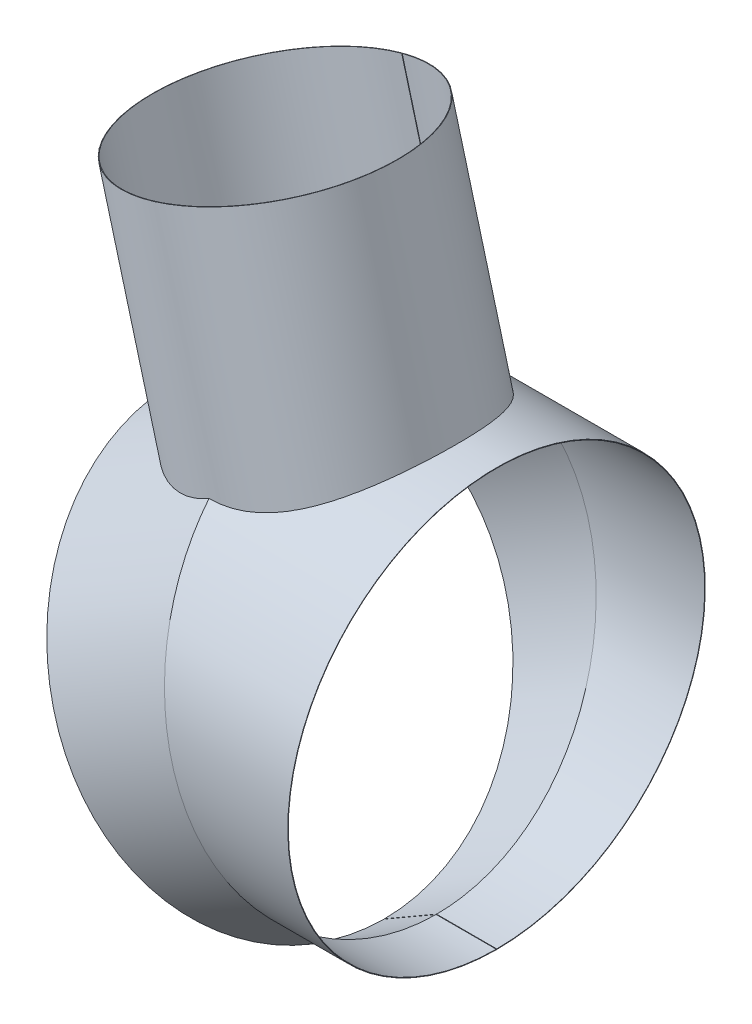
ISO-10303-21;
HEADER;
FILE_DESCRIPTION(('STEP AP214'),'2;1');
FILE_NAME('part.step','',(''),(''),'','','');
FILE_SCHEMA(('AUTOMOTIVE_DESIGN { 1 0 10303 214 1 1 1 1 }'));
ENDSEC;
DATA;
#1=APPLICATION_CONTEXT('core data for automotive mechanical design processes');
#2=APPLICATION_PROTOCOL_DEFINITION('international standard','automotive_design',2000,#1);
#3=PRODUCT_CONTEXT('',#1,'mechanical');
#4=PRODUCT('Part','Part','',(#3));
#5=PRODUCT_RELATED_PRODUCT_CATEGORY('part','',(#4));
#6=PRODUCT_DEFINITION_FORMATION('','',#4);
#7=PRODUCT_DEFINITION_CONTEXT('part definition',#1,'design');
#8=PRODUCT_DEFINITION('design','',#6,#7);
#9=PRODUCT_DEFINITION_SHAPE('','',#8);
#10=(LENGTH_UNIT() NAMED_UNIT(*) SI_UNIT(.MILLI.,.METRE.));
#11=(NAMED_UNIT(*) PLANE_ANGLE_UNIT() SI_UNIT($,.RADIAN.));
#12=(NAMED_UNIT(*) SI_UNIT($,.STERADIAN.) SOLID_ANGLE_UNIT());
#13=UNCERTAINTY_MEASURE_WITH_UNIT(LENGTH_MEASURE(1.E-05),#10,'distance_accuracy_value','');
#14=(GEOMETRIC_REPRESENTATION_CONTEXT(3) GLOBAL_UNCERTAINTY_ASSIGNED_CONTEXT((#13)) GLOBAL_UNIT_ASSIGNED_CONTEXT((#10,
#11,#12)) REPRESENTATION_CONTEXT('',''));
#15=CARTESIAN_POINT('',(0.,0.,0.));
#16=DIRECTION('',(0.,0.,1.));
#17=DIRECTION('',(1.,0.,0.));
#18=AXIS2_PLACEMENT_3D('',#15,#16,#17);
#19=CARTESIAN_POINT('',(-314.829994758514,1174.96153618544,3189.00108238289));
#20=CARTESIAN_POINT('',(-324.033732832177,1169.64775557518,3189.00108238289));
#21=CARTESIAN_POINT('',(-333.48308290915,1164.75669272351,3189.00108238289));
#22=CARTESIAN_POINT('',(-352.809019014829,1155.90710812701,3189.00108238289));
#23=CARTESIAN_POINT('',(-362.685307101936,1151.94900982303,3189.00108238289));
#24=CARTESIAN_POINT('',(-382.771701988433,1144.99604683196,3189.00108238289));
#25=CARTESIAN_POINT('',(-392.980725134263,1142.00102180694,3189.00108238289));
#26=CARTESIAN_POINT('',(-405.88398068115,1138.83983727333,3189.00108238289));
#27=CARTESIAN_POINT('',(-408.472293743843,1138.23645657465,3189.00108238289));
#28=CARTESIAN_POINT('',(-412.363380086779,1137.37431662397,3189.00108238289));
#29=CARTESIAN_POINT('',(-413.659942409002,1137.09449413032,3189.00108238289));
#30=CARTESIAN_POINT('',(-416.260113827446,1136.54805817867,3189.00108238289));
#31=CARTESIAN_POINT('',(-417.562159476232,1136.2818398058,3189.00108238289));
#32=CARTESIAN_POINT('',(-420.168076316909,1135.76349525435,3189.00108238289));
#33=CARTESIAN_POINT('',(-421.475152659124,1135.51074584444,3189.00108238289));
#34=CARTESIAN_POINT('',(-424.086419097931,1135.0200613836,3189.00108238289));
#35=CARTESIAN_POINT('',(-425.392915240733,1134.78169556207,3189.00108238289));
#36=CARTESIAN_POINT('',(-428.009188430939,1134.31844805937,3189.00108238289));
#37=CARTESIAN_POINT('',(-429.316746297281,1134.0939149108,3189.00108238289));
#38=CARTESIAN_POINT('',(-431.937658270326,1133.65767634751,3189.00108238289));
#39=CARTESIAN_POINT('',(-433.249510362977,1133.4462354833,3189.00108238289));
#40=CARTESIAN_POINT('',(-445.063008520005,1131.60346439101,3189.00108238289));
#41=CARTESIAN_POINT('',(-455.629712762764,1130.3906597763,3189.00108238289));
#42=CARTESIAN_POINT('',(-468.872979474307,1129.34043210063,3189.00108238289));
#43=CARTESIAN_POINT('',(-471.522659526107,1129.15381505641,3189.00108238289));
#44=CARTESIAN_POINT('',(-476.826421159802,1128.82510979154,3189.00108238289));
#45=CARTESIAN_POINT('',(-479.481018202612,1128.68297217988,3189.00108238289));
#46=CARTESIAN_POINT('',(-484.789485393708,1128.44191057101,3189.00108238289));
#47=CARTESIAN_POINT('',(-487.443205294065,1128.34305709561,3189.00108238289));
#48=CARTESIAN_POINT('',(-492.754815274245,1128.18578651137,3189.00108238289));
#49=CARTESIAN_POINT('',(-495.412012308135,1128.12768030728,3189.00108238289));
#50=CARTESIAN_POINT('',(-503.38210486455,1128.01376133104,3189.00108238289));
#51=CARTESIAN_POINT('',(-508.696028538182,1128.01886890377,3189.00108238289));
#52=CARTESIAN_POINT('',(-516.666084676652,1128.13530790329,3189.00108238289));
#53=CARTESIAN_POINT('',(-519.324021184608,1128.19181074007,3189.00108238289));
#54=CARTESIAN_POINT('',(-523.307926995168,1128.30286349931,3189.00108238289));
#55=CARTESIAN_POINT('',(-524.63355001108,1128.34416523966,3189.00108238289));
#56=CARTESIAN_POINT('',(-527.28895101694,1128.43542943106,3189.00108238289));
#57=CARTESIAN_POINT('',(-528.617601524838,1128.48535062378,3189.00108238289));
#58=CARTESIAN_POINT('',(-535.254523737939,1128.75560305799,3189.00108238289));
#59=CARTESIAN_POINT('',(-540.561317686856,1129.03889481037,3189.00108238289));
#60=CARTESIAN_POINT('',(-548.515634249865,1129.55289958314,3189.00108238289));
#61=CARTESIAN_POINT('',(-551.165979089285,1129.73977636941,3189.00108238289));
#62=CARTESIAN_POINT('',(-555.139861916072,1130.04324548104,3189.00108238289));
#63=CARTESIAN_POINT('',(-556.463512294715,1130.1478478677,3189.00108238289));
#64=CARTESIAN_POINT('',(-559.11168787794,1130.36383336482,3189.00108238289));
#65=CARTESIAN_POINT('',(-560.436996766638,1130.47437225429,3189.00108238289));
#66=CARTESIAN_POINT('',(-561.759850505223,1130.59047744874,3189.00108238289));
#67=B_SPLINE_CURVE_WITH_KNOTS('',3,(#19,#20,#21,#22,#23,#24,#25,#26,#27,#28,#29,#30,#31,#32,#33,
#34,#35,#36,#37,#38,#39,#40,#41,#42,#43,#44,#45,#46,#47,#48,#49,#50,#51,#52,#53,#54,#55,#56,#57,
#58,#59,#60,#61,#62,#63,#64,#65,#66),.UNSPECIFIED.,.F.,.F.,(4,2,2,2,2,2,2,2,2,2,2,2,2,2,2,2,2,2,
2,2,2,2,2,4),(0.,0.031883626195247,0.063767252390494,0.0956508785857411,0.103621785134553,
0.107607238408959,0.111592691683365,0.11557814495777,0.119563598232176,0.123549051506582,
0.127534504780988,0.159418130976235,0.167389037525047,0.175359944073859,0.18333085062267,
0.191301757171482,0.207243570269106,0.215214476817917,0.219199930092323,0.223185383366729,
0.239127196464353,0.247098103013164,0.25108355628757,0.255069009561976),.UNSPECIFIED.);
#68=DIRECTION('',(0.,0.,-1.));
#69=VECTOR('',#68,1.);
#70=SURFACE_OF_LINEAR_EXTRUSION('',#67,#69);
#71=CARTESIAN_POINT('',(-314.829994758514,1174.96153618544,-249.999999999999));
#72=CARTESIAN_POINT('',(-316.666628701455,1173.90113620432,-250.000015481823));
#73=CARTESIAN_POINT('',(-318.513033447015,1172.85761231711,-249.974822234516));
#74=CARTESIAN_POINT('',(-322.223944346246,1170.80541282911,-249.873378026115));
#75=CARTESIAN_POINT('',(-324.088452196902,1169.79674053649,-249.797122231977));
#76=CARTESIAN_POINT('',(-327.833839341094,1167.81551056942,-249.59290923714));
#77=CARTESIAN_POINT('',(-329.714719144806,1166.84295402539,-249.464950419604));
#78=CARTESIAN_POINT('',(-333.491050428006,1164.93511453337,-249.156813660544));
#79=CARTESIAN_POINT('',(-335.386501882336,1163.99983152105,-248.976635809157));
#80=CARTESIAN_POINT('',(-339.190138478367,1162.1675972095,-248.56364071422));
#81=CARTESIAN_POINT('',(-341.098323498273,1161.27064554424,-248.330823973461));
#82=CARTESIAN_POINT('',(-344.918428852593,1159.51931755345,-247.813201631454));
#83=CARTESIAN_POINT('',(-346.830308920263,1158.66479532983,-247.528592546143));
#84=CARTESIAN_POINT('',(-350.662629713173,1156.99524753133,-246.906639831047));
#85=CARTESIAN_POINT('',(-352.583070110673,1156.18022045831,-246.569298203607));
#86=CARTESIAN_POINT('',(-356.430347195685,1154.589972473,-245.841815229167));
#87=CARTESIAN_POINT('',(-358.357183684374,1153.8147503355,-245.45167550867));
#88=CARTESIAN_POINT('',(-362.215081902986,1152.30432696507,-244.618641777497));
#89=CARTESIAN_POINT('',(-364.146143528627,1151.56912475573,-244.175749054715));
#90=CARTESIAN_POINT('',(-368.010273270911,1150.13885750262,-243.237377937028));
#91=CARTESIAN_POINT('',(-369.943341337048,1149.44379147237,-242.74190083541));
#92=CARTESIAN_POINT('',(-374.294248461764,1147.92448820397,-241.567755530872));
#93=CARTESIAN_POINT('',(-376.712075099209,1147.11157572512,-240.874309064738));
#94=CARTESIAN_POINT('',(-381.543134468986,1145.54756093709,-239.406259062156));
#95=CARTESIAN_POINT('',(-383.956367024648,1144.79646095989,-238.631652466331));
#96=CARTESIAN_POINT('',(-388.773902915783,1143.35483344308,-237.002245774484));
#97=CARTESIAN_POINT('',(-391.178206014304,1142.66430750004,-236.147443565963));
#98=CARTESIAN_POINT('',(-395.973527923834,1141.34242739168,-234.358861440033));
#99=CARTESIAN_POINT('',(-398.364547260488,1140.71107086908,-233.425084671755));
#100=CARTESIAN_POINT('',(-403.130913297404,1139.50552703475,-231.479228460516));
#101=CARTESIAN_POINT('',(-405.506249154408,1138.9313760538,-230.46709997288));
#102=CARTESIAN_POINT('',(-410.235700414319,1137.83839165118,-228.366538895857));
#103=CARTESIAN_POINT('',(-412.589816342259,1137.31955685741,-227.27810820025));
#104=CARTESIAN_POINT('',(-417.273373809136,1136.33494841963,-225.026384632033));
#105=CARTESIAN_POINT('',(-419.602814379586,1135.86917685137,-223.863088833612));
#106=CARTESIAN_POINT('',(-423.075616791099,1135.20826076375,-222.063288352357));
#107=CARTESIAN_POINT('',(-424.22969552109,1134.99423918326,-221.454191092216));
#108=CARTESIAN_POINT('',(-426.530378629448,1134.57850478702,-220.217892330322));
#109=CARTESIAN_POINT('',(-427.676982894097,1134.37679215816,-219.590690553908));
#110=CARTESIAN_POINT('',(-430.547443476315,1133.88506041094,-217.992616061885));
#111=CARTESIAN_POINT('',(-432.266225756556,1133.60271635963,-217.010226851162));
#112=CARTESIAN_POINT('',(-435.684336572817,1133.0642384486,-215.005282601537));
#113=CARTESIAN_POINT('',(-437.383664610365,1132.80810525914,-213.982726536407));
#114=CARTESIAN_POINT('',(-442.450686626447,1132.07714980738,-210.855756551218));
#115=CARTESIAN_POINT('',(-445.787481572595,1131.63976096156,-208.692005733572));
#116=CARTESIAN_POINT('',(-452.368040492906,1130.8551479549,-204.212569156));
#117=CARTESIAN_POINT('',(-455.611803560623,1130.50792467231,-201.896881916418));
#118=CARTESIAN_POINT('',(-462.000112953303,1129.89372531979,-197.117218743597));
#119=CARTESIAN_POINT('',(-465.144582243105,1129.6268102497,-194.653131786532));
#120=CARTESIAN_POINT('',(-469.778258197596,1129.28002597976,-190.851591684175));
#121=CARTESIAN_POINT('',(-471.30902085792,1129.17336035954,-189.566805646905));
#122=CARTESIAN_POINT('',(-474.341993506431,1128.97665585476,-186.96268608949));
#123=CARTESIAN_POINT('',(-475.844203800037,1128.88661679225,-185.643352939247));
#124=CARTESIAN_POINT('',(-478.819154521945,1128.7220109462,-182.970774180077));
#125=CARTESIAN_POINT('',(-480.291893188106,1128.64744508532,-181.617526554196));
#126=CARTESIAN_POINT('',(-483.206952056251,1128.51278358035,-178.877829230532));
#127=CARTESIAN_POINT('',(-484.649271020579,1128.45268852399,-177.491378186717));
#128=CARTESIAN_POINT('',(-487.298003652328,1128.35345691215,-174.887061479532));
#129=CARTESIAN_POINT('',(-488.508599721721,1128.31255094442,-173.673514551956));
#130=CARTESIAN_POINT('',(-490.906151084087,1128.23977871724,-171.223024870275));
#131=CARTESIAN_POINT('',(-492.09310595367,1128.20791261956,-169.98608169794));
#132=CARTESIAN_POINT('',(-495.617868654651,1128.12514075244,-166.240645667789));
#133=CARTESIAN_POINT('',(-497.919540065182,1128.08706267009,-163.697580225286));
#134=CARTESIAN_POINT('',(-501.29610639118,1128.05227835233,-159.817010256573));
#135=CARTESIAN_POINT('',(-502.409029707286,1128.04440589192,-158.512419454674));
#136=CARTESIAN_POINT('',(-504.609091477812,1128.03545880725,-155.881600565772));
#137=CARTESIAN_POINT('',(-505.696229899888,1128.03438419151,-154.555372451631));
#138=CARTESIAN_POINT('',(-507.844125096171,1128.03842484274,-151.881795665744));
#139=CARTESIAN_POINT('',(-508.904882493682,1128.04353996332,-150.534447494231));
#140=CARTESIAN_POINT('',(-510.999519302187,1128.05937325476,-147.819047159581));
#141=CARTESIAN_POINT('',(-512.033398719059,1128.0700914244,-146.450995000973));
#142=CARTESIAN_POINT('',(-514.073902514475,1128.09654032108,-143.694439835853));
#143=CARTESIAN_POINT('',(-515.080522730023,1128.11227180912,-142.305933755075));
#144=CARTESIAN_POINT('',(-517.065810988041,1128.14812356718,-139.509136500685));
#145=CARTESIAN_POINT('',(-518.044479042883,1128.16824383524,-138.10084533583));
#146=CARTESIAN_POINT('',(-519.973391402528,1128.21248421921,-135.264950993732));
#147=CARTESIAN_POINT('',(-520.923635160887,1128.23660441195,-133.837347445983));
#148=CARTESIAN_POINT('',(-522.795181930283,1128.288390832,-130.96335605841));
#149=CARTESIAN_POINT('',(-523.716484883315,1128.31605706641,-129.516968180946));
#150=CARTESIAN_POINT('',(-525.529679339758,1128.37444846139,-126.605863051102));
#151=CARTESIAN_POINT('',(-526.421569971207,1128.40517371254,-125.141145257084));
#152=CARTESIAN_POINT('',(-528.175390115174,1128.46921132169,-122.193990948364));
#153=CARTESIAN_POINT('',(-529.037319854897,1128.50252366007,-120.711554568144));
#154=CARTESIAN_POINT('',(-531.577393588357,1128.60571622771,-116.238547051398));
#155=CARTESIAN_POINT('',(-533.210011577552,1128.67885828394,-113.221973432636));
#156=CARTESIAN_POINT('',(-535.877484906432,1128.8076276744,-108.041579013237));
#157=CARTESIAN_POINT('',(-536.944444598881,1128.86190671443,-105.894147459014));
#158=CARTESIAN_POINT('',(-539.015775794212,1128.97195974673,-101.569337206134));
#159=CARTESIAN_POINT('',(-540.02014849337,1129.02773371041,-99.3919590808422));
#160=CARTESIAN_POINT('',(-541.965139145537,1129.13977376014,-95.0087876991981));
#161=CARTESIAN_POINT('',(-542.905753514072,1129.19603987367,-92.8029928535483));
#162=CARTESIAN_POINT('',(-544.722008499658,1129.30808292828,-88.364768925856));
#163=CARTESIAN_POINT('',(-545.59764849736,1129.36385986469,-86.1323395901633));
#164=CARTESIAN_POINT('',(-547.282882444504,1129.47421156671,-81.6426087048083));
#165=CARTESIAN_POINT('',(-548.092475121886,1129.52878630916,-79.3853066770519));
#166=CARTESIAN_POINT('',(-549.644554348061,1129.63597480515,-74.8477036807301));
#167=CARTESIAN_POINT('',(-550.387041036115,1129.68858856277,-72.5674027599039));
#168=CARTESIAN_POINT('',(-551.803740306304,1129.79109331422,-67.9862631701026));
#169=CARTESIAN_POINT('',(-552.477970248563,1129.84098499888,-65.6854298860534));
#170=CARTESIAN_POINT('',(-553.757417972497,1129.93737399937,-61.0647183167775));
#171=CARTESIAN_POINT('',(-554.362639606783,1129.98387150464,-58.7448411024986));
#172=CARTESIAN_POINT('',(-555.503237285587,1130.07268005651,-54.0878544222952));
#173=CARTESIAN_POINT('',(-556.038612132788,1130.11499103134,-51.7507446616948));
#174=CARTESIAN_POINT('',(-557.038767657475,1130.19496830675,-47.0613834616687));
#175=CARTESIAN_POINT('',(-557.503548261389,1130.23263460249,-44.7091320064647));
#176=CARTESIAN_POINT('',(-558.361780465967,1130.30272944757,-39.9917704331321));
#177=CARTESIAN_POINT('',(-558.755237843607,1130.3351584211,-37.6266613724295));
#178=CARTESIAN_POINT('',(-559.470358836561,1130.39456894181,-32.885440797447));
#179=CARTESIAN_POINT('',(-559.792019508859,1130.42155026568,-30.509328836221));
#180=CARTESIAN_POINT('',(-560.348334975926,1130.46856936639,-25.8712566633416));
#181=CARTESIAN_POINT('',(-560.586623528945,1130.48889364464,-23.6097344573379));
#182=CARTESIAN_POINT('',(-560.99787695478,1130.52417497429,-19.0807144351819));
#183=CARTESIAN_POINT('',(-561.170841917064,1130.53913203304,-16.8132166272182));
#184=CARTESIAN_POINT('',(-561.451198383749,1130.56347020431,-12.2741937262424));
#185=CARTESIAN_POINT('',(-561.558591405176,1130.57285144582,-10.0026687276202));
#186=CARTESIAN_POINT('',(-561.707652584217,1130.58589300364,-5.45744252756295));
#187=CARTESIAN_POINT('',(-561.749320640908,1130.58955331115,-3.18374132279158));
#188=CARTESIAN_POINT('',(-561.766868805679,1130.59109338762,1.36381507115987));
#189=CARTESIAN_POINT('',(-561.742751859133,1130.58897341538,3.63767024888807));
#190=CARTESIAN_POINT('',(-561.628769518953,1130.5789879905,8.18383709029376));
#191=CARTESIAN_POINT('',(-561.538900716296,1130.57112223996,10.4561486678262));
#192=CARTESIAN_POINT('',(-561.293563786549,1130.54977043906,14.996827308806));
#193=CARTESIAN_POINT('',(-561.138106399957,1130.53628530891,17.2651949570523));
#194=CARTESIAN_POINT('',(-560.76181746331,1130.50389082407,21.7964629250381));
#195=CARTESIAN_POINT('',(-560.540985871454,1130.48498146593,24.0593632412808));
#196=CARTESIAN_POINT('',(-560.034248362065,1130.44196941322,28.5778474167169));
#197=CARTESIAN_POINT('',(-559.748341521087,1130.41786664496,30.8334311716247));
#198=CARTESIAN_POINT('',(-559.111830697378,1130.36471501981,35.3353928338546));
#199=CARTESIAN_POINT('',(-558.761226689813,1130.33566616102,37.5817707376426));
#200=CARTESIAN_POINT('',(-557.99574371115,1130.2727469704,42.0634084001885));
#201=CARTESIAN_POINT('',(-557.5808666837,1130.23887678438,44.2986684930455));
#202=CARTESIAN_POINT('',(-556.687385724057,1130.16675594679,48.7563434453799));
#203=CARTESIAN_POINT('',(-556.208781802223,1130.12850529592,50.9787583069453));
#204=CARTESIAN_POINT('',(-555.203037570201,1130.04918809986,55.3456624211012));
#205=CARTESIAN_POINT('',(-554.677675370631,1130.00823327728,57.490563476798));
#206=CARTESIAN_POINT('',(-553.568023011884,1129.92305395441,61.7649922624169));
#207=CARTESIAN_POINT('',(-552.983732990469,1129.87882946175,63.8945200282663));
#208=CARTESIAN_POINT('',(-551.756957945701,1129.78774662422,68.1366063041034));
#209=CARTESIAN_POINT('',(-551.114475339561,1129.74088838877,70.2491655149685));
#210=CARTESIAN_POINT('',(-549.772023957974,1129.64505198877,74.4559171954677));
#211=CARTESIAN_POINT('',(-549.07205299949,1129.59607374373,76.5501089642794));
#212=CARTESIAN_POINT('',(-546.887166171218,1129.44687930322,82.8026422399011));
#213=CARTESIAN_POINT('',(-545.317112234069,1129.34439093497,86.9315085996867));
#214=CARTESIAN_POINT('',(-541.956640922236,1129.13793526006,95.0989752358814));
#215=CARTESIAN_POINT('',(-540.166200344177,1129.03396779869,99.137565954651));
#216=CARTESIAN_POINT('',(-537.321160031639,1128.88157448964,105.119315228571));
#217=CARTESIAN_POINT('',(-536.346188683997,1128.83136688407,107.100655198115));
#218=CARTESIAN_POINT('',(-534.344051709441,1128.73297970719,111.036813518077));
#219=CARTESIAN_POINT('',(-533.316887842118,1128.68480006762,112.99163275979));
#220=CARTESIAN_POINT('',(-531.211322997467,1128.59137025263,116.873640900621));
#221=CARTESIAN_POINT('',(-530.132919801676,1128.54612020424,118.800828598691));
#222=CARTESIAN_POINT('',(-527.925926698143,1128.45944665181,122.626344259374));
#223=CARTESIAN_POINT('',(-526.797336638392,1128.41802315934,124.524672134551));
#224=CARTESIAN_POINT('',(-524.442741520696,1128.33830394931,128.370166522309));
#225=CARTESIAN_POINT('',(-523.2146362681,1128.30021171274,130.316051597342));
#226=CARTESIAN_POINT('',(-520.706289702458,1128.23039386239,134.174043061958));
#227=CARTESIAN_POINT('',(-519.426048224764,1128.19866826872,136.086149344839));
#228=CARTESIAN_POINT('',(-516.814599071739,1128.1426100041,139.875397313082));
#229=CARTESIAN_POINT('',(-515.483390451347,1128.1182774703,141.75253834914));
#230=CARTESIAN_POINT('',(-512.771260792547,1128.07818125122,145.470646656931));
#231=CARTESIAN_POINT('',(-511.390339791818,1128.06241755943,147.311613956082));
#232=CARTESIAN_POINT('',(-508.58006805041,1128.04099642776,150.956294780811));
#233=CARTESIAN_POINT('',(-507.150716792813,1128.03533909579,152.760007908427));
#234=CARTESIAN_POINT('',(-504.244875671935,1128.03551347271,156.329057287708));
#235=CARTESIAN_POINT('',(-502.768385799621,1128.04134518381,158.094393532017));
#236=CARTESIAN_POINT('',(-499.768513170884,1128.06605849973,161.586865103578));
#237=CARTESIAN_POINT('',(-498.245097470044,1128.08494948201,163.313972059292));
#238=CARTESIAN_POINT('',(-495.153661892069,1128.13717827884,166.727614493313));
#239=CARTESIAN_POINT('',(-493.585642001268,1128.17051609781,168.414149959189));
#240=CARTESIAN_POINT('',(-491.201208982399,1128.23235953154,170.912643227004));
#241=CARTESIAN_POINT('',(-490.40099098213,1128.25494701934,171.740262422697));
#242=CARTESIAN_POINT('',(-488.789900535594,1128.30420331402,173.384941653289));
#243=CARTESIAN_POINT('',(-487.979028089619,1128.3308721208,174.202001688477));
#244=CARTESIAN_POINT('',(-485.53069910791,1128.41733015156,176.63714054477));
#245=CARTESIAN_POINT('',(-483.877493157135,1128.48357194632,178.239217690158));
#246=CARTESIAN_POINT('',(-480.530525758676,1128.63507581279,181.399648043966));
#247=CARTESIAN_POINT('',(-478.836762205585,1128.72033887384,182.957998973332));
#248=CARTESIAN_POINT('',(-475.410155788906,1128.91142134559,186.029848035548));
#249=CARTESIAN_POINT('',(-473.677312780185,1129.01724083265,187.543346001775));
#250=CARTESIAN_POINT('',(-470.095928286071,1129.25644559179,190.590902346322));
#251=CARTESIAN_POINT('',(-468.245672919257,1129.39084951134,192.122868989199));
#252=CARTESIAN_POINT('',(-464.505972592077,1129.68612881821,195.135459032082));
#253=CARTESIAN_POINT('',(-462.616527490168,1129.84700430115,196.616082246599));
#254=CARTESIAN_POINT('',(-456.891970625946,1130.37230157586,200.979169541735));
#255=CARTESIAN_POINT('',(-453.000362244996,1130.77941192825,203.783085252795));
#256=CARTESIAN_POINT('',(-445.082365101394,1131.72417964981,209.171032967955));
#257=CARTESIAN_POINT('',(-441.055965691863,1132.2618473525,211.755047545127));
#258=CARTESIAN_POINT('',(-434.930502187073,1133.17877567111,215.457232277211));
#259=CARTESIAN_POINT('',(-432.874994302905,1133.5027101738,216.661988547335));
#260=CARTESIAN_POINT('',(-428.737052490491,1134.18943896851,219.012773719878));
#261=CARTESIAN_POINT('',(-426.654619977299,1134.55223122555,220.158805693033));
#262=CARTESIAN_POINT('',(-423.512689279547,1135.12710161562,221.832837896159));
#263=CARTESIAN_POINT('',(-422.462302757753,1135.32384461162,222.383360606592));
#264=CARTESIAN_POINT('',(-420.355737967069,1135.72775543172,223.469250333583));
#265=CARTESIAN_POINT('',(-419.299559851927,1135.93492298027,224.004617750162));
#266=CARTESIAN_POINT('',(-417.18177695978,1136.3599396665,225.060028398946));
#267=CARTESIAN_POINT('',(-416.120172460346,1136.57778826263,225.58007240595));
#268=CARTESIAN_POINT('',(-413.991833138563,1137.02445207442,226.604715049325));
#269=CARTESIAN_POINT('',(-412.925098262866,1137.25326740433,227.109313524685));
#270=CARTESIAN_POINT('',(-409.717893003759,1137.95641424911,228.599624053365));
#271=CARTESIAN_POINT('',(-407.570136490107,1138.4475037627,229.5619934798));
#272=CARTESIAN_POINT('',(-404.336425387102,1139.21883964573,230.957843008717));
#273=CARTESIAN_POINT('',(-403.256523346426,1139.48173149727,231.415169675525));
#274=CARTESIAN_POINT('',(-401.092996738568,1140.01933782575,232.31382509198));
#275=CARTESIAN_POINT('',(-400.00937213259,1140.29405242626,232.755153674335));
#276=CARTESIAN_POINT('',(-396.537629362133,1141.19199973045,234.141101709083));
#277=CARTESIAN_POINT('',(-394.1429948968,1141.8382351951,235.054819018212));
#278=CARTESIAN_POINT('',(-389.341626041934,1143.19022253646,236.802932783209));
#279=CARTESIAN_POINT('',(-386.934891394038,1143.89597568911,237.637327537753));
#280=CARTESIAN_POINT('',(-382.113417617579,1145.36843560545,239.225721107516));
#281=CARTESIAN_POINT('',(-379.698678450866,1146.13514266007,239.979719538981));
#282=CARTESIAN_POINT('',(-376.074004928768,1147.33174166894,241.049688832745));
#283=CARTESIAN_POINT('',(-374.865297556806,1147.73838409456,241.396188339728));
#284=CARTESIAN_POINT('',(-372.447567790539,1148.56732422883,242.068761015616));
#285=CARTESIAN_POINT('',(-371.238545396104,1148.98962194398,242.394834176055));
#286=CARTESIAN_POINT('',(-367.611531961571,1150.28017716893,243.342362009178));
#287=CARTESIAN_POINT('',(-365.193786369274,1151.17203355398,243.933068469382));
#288=CARTESIAN_POINT('',(-360.368871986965,1153.01639250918,245.030764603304));
#289=CARTESIAN_POINT('',(-357.961691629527,1153.9687578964,245.537934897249));
#290=CARTESIAN_POINT('',(-353.156508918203,1155.93566338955,246.470039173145));
#291=CARTESIAN_POINT('',(-350.758507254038,1156.95020807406,246.894967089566));
#292=CARTESIAN_POINT('',(-347.172076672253,1158.51796203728,247.470680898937));
#293=CARTESIAN_POINT('',(-345.978424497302,1159.04817366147,247.652297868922));
#294=CARTESIAN_POINT('',(-343.595061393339,1160.12385880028,247.995042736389));
#295=CARTESIAN_POINT('',(-342.405350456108,1160.66933228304,248.156170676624));
#296=CARTESIAN_POINT('',(-338.843813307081,1162.32793070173,248.608781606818));
#297=CARTESIAN_POINT('',(-336.478541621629,1163.46368862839,248.869658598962));
#298=CARTESIAN_POINT('',(-331.770819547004,1165.79276688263,249.310275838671));
#299=CARTESIAN_POINT('',(-329.428355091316,1166.98604862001,249.490069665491));
#300=CARTESIAN_POINT('',(-326.409241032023,1168.56851246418,249.671243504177));
#301=CARTESIAN_POINT('',(-325.721205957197,1168.93216440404,249.709100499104));
#302=CARTESIAN_POINT('',(-324.347491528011,1169.66425550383,249.777846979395));
#303=CARTESIAN_POINT('',(-323.661811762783,1170.03269376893,249.808737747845));
#304=CARTESIAN_POINT('',(-322.292834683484,1170.77432663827,249.863586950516));
#305=CARTESIAN_POINT('',(-321.609537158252,1171.14752080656,249.88754601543));
#306=CARTESIAN_POINT('',(-320.246322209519,1171.89809915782,249.92853784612));
#307=CARTESIAN_POINT('',(-319.566401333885,1172.27547652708,249.945580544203));
#308=CARTESIAN_POINT('',(-318.208967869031,1173.03492272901,249.972823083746));
#309=CARTESIAN_POINT('',(-317.531455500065,1173.4169919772,249.983022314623));
#310=CARTESIAN_POINT('',(-316.178856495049,1174.18579589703,249.996611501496));
#311=CARTESIAN_POINT('',(-315.503770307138,1174.57253137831,250.00000025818));
#312=CARTESIAN_POINT('',(-314.829994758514,1174.96153618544,250.000000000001));
#313=B_SPLINE_CURVE_WITH_KNOTS('',3,(#71,#72,#73,#74,#75,#76,#77,#78,#79,#80,#81,#82,#83,#84,
#85,#86,#87,#88,#89,#90,#91,#92,#93,#94,#95,#96,#97,#98,#99,#100,#101,#102,#103,#104,#105,#106,
#107,#108,#109,#110,#111,#112,#113,#114,#115,#116,#117,#118,#119,#120,#121,#122,#123,#124,#125,
#126,#127,#128,#129,#130,#131,#132,#133,#134,#135,#136,#137,#138,#139,#140,#141,#142,#143,#144,
#145,#146,#147,#148,#149,#150,#151,#152,#153,#154,#155,#156,#157,#158,#159,#160,#161,#162,#163,
#164,#165,#166,#167,#168,#169,#170,#171,#172,#173,#174,#175,#176,#177,#178,#179,#180,#181,#182,
#183,#184,#185,#186,#187,#188,#189,#190,#191,#192,#193,#194,#195,#196,#197,#198,#199,#200,#201,
#202,#203,#204,#205,#206,#207,#208,#209,#210,#211,#212,#213,#214,#215,#216,#217,#218,#219,#220,
#221,#222,#223,#224,#225,#226,#227,#228,#229,#230,#231,#232,#233,#234,#235,#236,#237,#238,#239,
#240,#241,#242,#243,#244,#245,#246,#247,#248,#249,#250,#251,#252,#253,#254,#255,#256,#257,#258,
#259,#260,#261,#262,#263,#264,#265,#266,#267,#268,#269,#270,#271,#272,#273,#274,#275,#276,#277,
#278,#279,#280,#281,#282,#283,#284,#285,#286,#287,#288,#289,#290,#291,#292,#293,#294,#295,#296,
#297,#298,#299,#300,#301,#302,#303,#304,#305,#306,#307,#308,#309,#310,#311,#312),.UNSPECIFIED.,
.F.,.F.,(4,2,2,2,2,2,2,2,2,2,2,2,2,2,2,2,2,2,2,2,2,2,2,2,2,2,2,2,2,2,2,2,2,2,2,2,2,2,2,2,2,2,2,
2,2,2,2,2,2,2,2,2,2,2,2,2,2,2,2,2,2,2,2,2,2,2,2,2,2,2,2,2,2,2,2,2,2,2,2,2,2,2,2,2,2,2,2,2,2,2,2,
2,2,2,2,2,2,2,2,2,2,2,2,2,2,2,2,2,2,2,2,2,2,2,2,2,2,2,2,2,4),(0.,6.36211040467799,
12.7248230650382,19.0877347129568,25.4506353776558,31.8134752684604,38.1526577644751,
44.4915996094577,50.8303462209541,57.1689381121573,63.5073741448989,71.4355130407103,
79.3639508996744,87.2925976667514,95.2209284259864,103.154262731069,111.087400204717,
119.020847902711,122.9878331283,126.954878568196,132.953394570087,138.95206392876,
150.949184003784,162.946420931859,174.952747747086,180.956249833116,186.95968766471,
192.963483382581,198.967522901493,204.111015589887,209.25460031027,219.541914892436,
224.686127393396,229.830346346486,234.974443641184,240.118539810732,245.263417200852,
250.408292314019,255.55326627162,260.698250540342,265.843387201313,270.988484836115,
281.277605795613,288.472232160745,295.666720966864,302.861613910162,310.056575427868,
317.251675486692,324.446760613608,331.640011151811,338.832859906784,346.02583194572,
353.218811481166,360.41120814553,367.603899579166,374.425355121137,381.246801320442,
388.068089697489,394.889388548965,401.710381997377,408.531729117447,415.351959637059,
422.172194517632,428.992526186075,435.812860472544,442.632988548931,449.453115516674,
456.078322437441,462.703513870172,469.328430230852,475.953598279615,489.20216588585,
502.452129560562,509.07788209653,515.703411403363,522.329227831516,528.955064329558,
535.85822582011,542.761409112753,549.664720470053,556.568026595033,563.471406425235,
570.374787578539,577.28313098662,584.191476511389,587.645703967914,591.099931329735,
598.008221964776,604.916872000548,611.825547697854,619.042238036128,626.258954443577,
640.691304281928,655.124796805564,662.337254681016,669.549335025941,673.155574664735,
676.761719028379,680.36768073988,683.973680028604,691.184706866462,694.790124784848,
698.395580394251,706.323285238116,714.251160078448,722.17907275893,726.14339214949,
730.107713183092,738.036983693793,745.948878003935,753.861355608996,757.817177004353,
761.772990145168,769.681173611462,777.584123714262,779.921532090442,782.258509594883,
784.595274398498,786.928671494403,789.262276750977,791.596292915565),.UNSPECIFIED.);
#314=CARTESIAN_POINT('',(-315.278386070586,1174.70310369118,-249.9994999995));
#315=VERTEX_POINT('',#314);
#316=CARTESIAN_POINT('',(-314.829994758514,1174.96153618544,250.000000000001));
#317=VERTEX_POINT('',#316);
#318=EDGE_CURVE('E174',#315,#317,#313,.T.);
#319=ORIENTED_EDGE('',*,*,#318,.F.);
#320=DIRECTION('',(0.,0.,-1.));
#321=VECTOR('',#320,1.);
#322=CARTESIAN_POINT('',(-315.278386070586,1174.70310369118,2.22044604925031E-12));
#323=LINE('',#322,#321);
#324=CARTESIAN_POINT('',(-315.278386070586,1174.70310369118,-248.999497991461));
#325=VERTEX_POINT('',#324);
#326=EDGE_CURVE('E68',#315,#325,#323,.F.);
#327=ORIENTED_EDGE('',*,*,#326,.T.);
#328=CARTESIAN_POINT('',(-314.829994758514,1174.96153618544,-248.999999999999));
#329=CARTESIAN_POINT('',(-316.878689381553,1173.77869157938,-249.000024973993));
#330=CARTESIAN_POINT('',(-318.939558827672,1172.61684821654,-248.968546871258));
#331=CARTESIAN_POINT('',(-323.083477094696,1170.33675594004,-248.84171619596));
#332=CARTESIAN_POINT('',(-325.166527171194,1169.21850951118,-248.746359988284));
#333=CARTESIAN_POINT('',(-329.352388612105,1167.02734546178,-248.490905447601));
#334=CARTESIAN_POINT('',(-331.45519984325,1165.95442753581,-248.330807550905));
#335=CARTESIAN_POINT('',(-335.678131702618,1163.85545257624,-247.945186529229));
#336=CARTESIAN_POINT('',(-337.798251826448,1162.82939418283,-247.71966530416));
#337=CARTESIAN_POINT('',(-340.989364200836,1161.32656105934,-247.331940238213));
#338=CARTESIAN_POINT('',(-342.054901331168,1160.83165421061,-247.194456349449));
#339=CARTESIAN_POINT('',(-344.189320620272,1159.85407377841,-246.902957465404));
#340=CARTESIAN_POINT('',(-345.258202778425,1159.37140019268,-246.748942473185));
#341=CARTESIAN_POINT('',(-348.457329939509,1157.94718945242,-246.26385477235));
#342=CARTESIAN_POINT('',(-350.592032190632,1157.02382436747,-245.908285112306));
#343=CARTESIAN_POINT('',(-354.870050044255,1155.22637693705,-245.131465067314));
#344=CARTESIAN_POINT('',(-357.013365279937,1154.3522925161,-244.710217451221));
#345=CARTESIAN_POINT('',(-361.305652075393,1152.6537095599,-243.802065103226));
#346=CARTESIAN_POINT('',(-363.454623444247,1151.82920937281,-243.315162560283));
#347=CARTESIAN_POINT('',(-367.755178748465,1150.22996986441,-242.275903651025));
#348=CARTESIAN_POINT('',(-369.906762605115,1149.45522908,-241.72354921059));
#349=CARTESIAN_POINT('',(-374.209458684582,1147.9555485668,-240.55377768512));
#350=CARTESIAN_POINT('',(-376.360570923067,1147.2306068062,-239.936363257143));
#351=CARTESIAN_POINT('',(-381.19791300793,1145.65425622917,-238.47414751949));
#352=CARTESIAN_POINT('',(-383.883171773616,1144.8166730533,-237.611134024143));
#353=CARTESIAN_POINT('',(-389.242187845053,1143.216522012,-235.785453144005));
#354=CARTESIAN_POINT('',(-391.915944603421,1142.45395767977,-234.82278106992));
#355=CARTESIAN_POINT('',(-397.246340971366,1141.00179761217,-232.799344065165));
#356=CARTESIAN_POINT('',(-399.902979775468,1140.31220528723,-231.738574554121));
#357=CARTESIAN_POINT('',(-403.870584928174,1139.33088736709,-230.07541610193));
#358=CARTESIAN_POINT('',(-405.190238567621,1139.01262409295,-229.509024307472));
#359=CARTESIAN_POINT('',(-407.823174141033,1138.39332163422,-228.352453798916));
#360=CARTESIAN_POINT('',(-409.136456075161,1138.09228244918,-227.76227508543));
#361=CARTESIAN_POINT('',(-411.757177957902,1137.50678642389,-226.557846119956));
#362=CARTESIAN_POINT('',(-413.06461139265,1137.2223451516,-225.943574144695));
#363=CARTESIAN_POINT('',(-415.671791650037,1136.66997269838,-224.691740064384));
#364=CARTESIAN_POINT('',(-416.971538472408,1136.40204151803,-224.054177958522));
#365=CARTESIAN_POINT('',(-419.562660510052,1135.88221438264,-222.756065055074));
#366=CARTESIAN_POINT('',(-420.854036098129,1135.63031770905,-222.095515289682));
#367=CARTESIAN_POINT('',(-423.427852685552,1135.14209815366,-220.751694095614));
#368=CARTESIAN_POINT('',(-424.710293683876,1134.90577527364,-220.068422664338));
#369=CARTESIAN_POINT('',(-428.543414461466,1134.21952394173,-217.98491534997));
#370=CARTESIAN_POINT('',(-431.079958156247,1133.79229958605,-216.550953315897));
#371=CARTESIAN_POINT('',(-436.110570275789,1132.99476957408,-213.595601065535));
#372=CARTESIAN_POINT('',(-438.604638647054,1132.62446398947,-212.074210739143));
#373=CARTESIAN_POINT('',(-443.641012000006,1131.92369545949,-208.886300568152));
#374=CARTESIAN_POINT('',(-446.181499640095,1131.59530468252,-207.216452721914));
#375=CARTESIAN_POINT('',(-451.20792523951,1130.99130481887,-203.7875718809));
#376=CARTESIAN_POINT('',(-453.693863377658,1130.71569555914,-202.028539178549));
#377=CARTESIAN_POINT('',(-458.607161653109,1130.21293190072,-198.423840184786));
#378=CARTESIAN_POINT('',(-461.034520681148,1129.98577841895,-196.57817225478));
#379=CARTESIAN_POINT('',(-465.826787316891,1129.57572786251,-192.802770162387));
#380=CARTESIAN_POINT('',(-468.191696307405,1129.39282980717,-190.873037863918));
#381=CARTESIAN_POINT('',(-471.689892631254,1129.14856277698,-187.916955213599));
#382=CARTESIAN_POINT('',(-472.848043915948,1129.07213859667,-186.921093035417));
#383=CARTESIAN_POINT('',(-475.147373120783,1128.92877129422,-184.909265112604));
#384=CARTESIAN_POINT('',(-476.288551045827,1128.86182816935,-183.893299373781));
#385=CARTESIAN_POINT('',(-478.553453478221,1128.73693161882,-181.841618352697));
#386=CARTESIAN_POINT('',(-479.677178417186,1128.67897797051,-180.80590356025));
#387=CARTESIAN_POINT('',(-481.906788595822,1128.57159608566,-178.715011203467));
#388=CARTESIAN_POINT('',(-483.012673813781,1128.52216785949,-177.659833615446));
#389=CARTESIAN_POINT('',(-485.206232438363,1128.43136083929,-175.530284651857));
#390=CARTESIAN_POINT('',(-486.293905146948,1128.38998235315,-174.455912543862));
#391=CARTESIAN_POINT('',(-488.450545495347,1128.31470485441,-172.288340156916));
#392=CARTESIAN_POINT('',(-489.519513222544,1128.28080580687,-171.195139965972));
#393=CARTESIAN_POINT('',(-492.697952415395,1128.18969016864,-167.887565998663));
#394=CARTESIAN_POINT('',(-494.778879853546,1128.14305832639,-165.645296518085));
#395=CARTESIAN_POINT('',(-498.372735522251,1128.08315985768,-161.634453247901));
#396=CARTESIAN_POINT('',(-499.902429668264,1128.06457946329,-159.880916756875));
#397=CARTESIAN_POINT('',(-502.914493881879,1128.0405553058,-156.333577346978));
#398=CARTESIAN_POINT('',(-504.39686475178,1128.03511131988,-154.539775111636));
#399=CARTESIAN_POINT('',(-507.31305274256,1128.03576732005,-150.912857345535));
#400=CARTESIAN_POINT('',(-508.74686517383,1128.0418684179,-149.079738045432));
#401=CARTESIAN_POINT('',(-511.564455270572,1128.0641931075,-145.375519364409));
#402=CARTESIAN_POINT('',(-512.948233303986,1128.08041662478,-143.504420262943));
#403=CARTESIAN_POINT('',(-515.664461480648,1128.12139691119,-139.725320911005));
#404=CARTESIAN_POINT('',(-516.996909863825,1128.14615397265,-137.817319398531));
#405=CARTESIAN_POINT('',(-519.609156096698,1128.20302113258,-133.965716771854));
#406=CARTESIAN_POINT('',(-520.888953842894,1128.23513124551,-132.02211558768));
#407=CARTESIAN_POINT('',(-523.394779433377,1128.30563017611,-128.100394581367));
#408=CARTESIAN_POINT('',(-524.620802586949,1128.34401954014,-126.122271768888));
#409=CARTESIAN_POINT('',(-527.017649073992,1128.42584506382,-122.133077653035));
#410=CARTESIAN_POINT('',(-528.188472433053,1128.46928122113,-120.122006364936));
#411=CARTESIAN_POINT('',(-531.616361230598,1128.60554441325,-114.041231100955));
#412=CARTESIAN_POINT('',(-533.789141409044,1128.70433500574,-109.923502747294));
#413=CARTESIAN_POINT('',(-536.871758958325,1128.85816657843,-103.660987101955));
#414=CARTESIAN_POINT('',(-537.86993390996,1128.91038842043,-101.559017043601));
#415=CARTESIAN_POINT('',(-539.80641748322,1129.01576206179,-97.3277209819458));
#416=CARTESIAN_POINT('',(-540.744729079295,1129.06891381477,-95.1983963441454));
#417=CARTESIAN_POINT('',(-542.578008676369,1129.17628874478,-90.8723620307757));
#418=CARTESIAN_POINT('',(-543.471782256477,1129.23051269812,-88.6751465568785));
#419=CARTESIAN_POINT('',(-545.194882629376,1129.33809532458,-84.2555539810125));
#420=CARTESIAN_POINT('',(-546.024209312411,1129.39145399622,-82.0331768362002));
#421=CARTESIAN_POINT('',(-547.617408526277,1129.49666191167,-77.56501279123));
#422=CARTESIAN_POINT('',(-548.381280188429,1129.54851113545,-75.319225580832));
#423=CARTESIAN_POINT('',(-549.842600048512,1129.64996141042,-70.8059897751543));
#424=CARTESIAN_POINT('',(-550.54004559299,1129.69956237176,-68.5385403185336));
#425=CARTESIAN_POINT('',(-551.867548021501,1129.7958239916,-63.9839549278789));
#426=CARTESIAN_POINT('',(-552.497605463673,1129.84248467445,-61.6968191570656));
#427=CARTESIAN_POINT('',(-553.68948469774,1129.93223653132,-57.1047619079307));
#428=CARTESIAN_POINT('',(-554.251306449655,1129.97532770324,-54.799840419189));
#429=CARTESIAN_POINT('',(-555.305753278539,1130.05721335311,-50.1748123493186));
#430=CARTESIAN_POINT('',(-555.798397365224,1130.09600901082,-47.8547101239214));
#431=CARTESIAN_POINT('',(-556.713973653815,1130.1688792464,-43.2008184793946));
#432=CARTESIAN_POINT('',(-557.136908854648,1130.20295402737,-40.867029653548));
#433=CARTESIAN_POINT('',(-557.912488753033,1130.26593095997,-36.1876869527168));
#434=CARTESIAN_POINT('',(-558.265132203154,1130.29483301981,-33.8421328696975));
#435=CARTESIAN_POINT('',(-558.899615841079,1130.34713254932,-29.141401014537));
#436=CARTESIAN_POINT('',(-559.18145591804,1130.37053001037,-26.7862232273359));
#437=CARTESIAN_POINT('',(-559.673929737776,1130.41165190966,-22.0685973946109));
#438=CARTESIAN_POINT('',(-559.884569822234,1130.42937685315,-19.7061500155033));
#439=CARTESIAN_POINT('',(-560.234374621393,1130.45893363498,-14.9758062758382));
#440=CARTESIAN_POINT('',(-560.373535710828,1130.47076517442,-12.6079096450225));
#441=CARTESIAN_POINT('',(-560.574375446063,1130.48787838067,-8.00152833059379));
#442=CARTESIAN_POINT('',(-560.639952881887,1130.49348941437,-5.7632139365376));
#443=CARTESIAN_POINT('',(-560.707110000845,1130.49923590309,-1.28574556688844));
#444=CARTESIAN_POINT('',(-560.708693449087,1130.49937168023,0.953408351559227));
#445=CARTESIAN_POINT('',(-560.647869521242,1130.49416658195,5.43083269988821));
#446=CARTESIAN_POINT('',(-560.585462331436,1130.48882572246,7.66910313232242));
#447=CARTESIAN_POINT('',(-560.396744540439,1130.47274053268,12.1429319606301));
#448=CARTESIAN_POINT('',(-560.270433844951,1130.46199619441,14.3784903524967));
#449=CARTESIAN_POINT('',(-559.954085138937,1130.43523917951,18.8450044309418));
#450=CARTESIAN_POINT('',(-559.764048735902,1130.41922663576,21.0759602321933));
#451=CARTESIAN_POINT('',(-559.320499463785,1130.3821123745,25.5315079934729));
#452=CARTESIAN_POINT('',(-559.066986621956,1130.36101065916,27.7560999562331));
#453=CARTESIAN_POINT('',(-558.496831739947,1130.31388601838,32.1968556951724));
#454=CARTESIAN_POINT('',(-558.18019727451,1130.28786368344,34.4130204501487));
#455=CARTESIAN_POINT('',(-557.484167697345,1130.23109169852,38.8354052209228));
#456=CARTESIAN_POINT('',(-557.104772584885,1130.20034204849,41.0416252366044));
#457=CARTESIAN_POINT('',(-556.283710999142,1130.13452260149,45.4424335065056));
#458=CARTESIAN_POINT('',(-555.842043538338,1130.09945273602,47.6370215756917));
#459=CARTESIAN_POINT('',(-554.897006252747,1130.02532850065,52.0127390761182));
#460=CARTESIAN_POINT('',(-554.393636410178,1129.98627412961,54.1938685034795));
#461=CARTESIAN_POINT('',(-552.791926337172,1129.86391759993,60.7144917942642));
#462=CARTESIAN_POINT('',(-551.601892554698,1129.7754143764,65.0317184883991));
#463=CARTESIAN_POINT('',(-549.000636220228,1129.59028286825,73.5360736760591));
#464=CARTESIAN_POINT('',(-547.592558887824,1129.4937780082,77.7241683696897));
#465=CARTESIAN_POINT('',(-545.311147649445,1129.34561111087,83.9436434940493));
#466=CARTESIAN_POINT('',(-544.52242780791,1129.29565189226,86.006435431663));
#467=CARTESIAN_POINT('',(-542.88935280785,1129.19516205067,90.1098641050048));
#468=CARTESIAN_POINT('',(-542.044997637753,1129.14463142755,92.150500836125));
#469=CARTESIAN_POINT('',(-539.429883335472,1128.99328751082,98.2369570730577));
#470=CARTESIAN_POINT('',(-537.576910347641,1128.89271117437,102.247772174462));
#471=CARTESIAN_POINT('',(-533.658964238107,1128.69856172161,110.166248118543));
#472=CARTESIAN_POINT('',(-531.593921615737,1128.60499091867,114.073874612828));
#473=CARTESIAN_POINT('',(-528.34405344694,1128.47530698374,119.849368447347));
#474=CARTESIAN_POINT('',(-527.235324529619,1128.4338560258,121.760296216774));
#475=CARTESIAN_POINT('',(-524.968035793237,1128.35542330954,125.552524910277));
#476=CARTESIAN_POINT('',(-523.809475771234,1128.31844156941,127.433825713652));
#477=CARTESIAN_POINT('',(-521.443587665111,1128.24998426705,131.165690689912));
#478=CARTESIAN_POINT('',(-520.23625765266,1128.21850892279,133.016253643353));
#479=CARTESIAN_POINT('',(-517.773935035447,1128.16204305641,136.685489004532));
#480=CARTESIAN_POINT('',(-516.518942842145,1128.13705247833,138.504161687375));
#481=CARTESIAN_POINT('',(-514.232850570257,1128.09895092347,141.727192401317));
#482=CARTESIAN_POINT('',(-513.210561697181,1128.08444518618,143.137794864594));
#483=CARTESIAN_POINT('',(-511.137598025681,1128.06071292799,145.938013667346));
#484=CARTESIAN_POINT('',(-510.086923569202,1128.05148634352,147.327630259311));
#485=CARTESIAN_POINT('',(-507.957708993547,1128.03889983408,150.085428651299));
#486=CARTESIAN_POINT('',(-506.879168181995,1128.03554005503,151.453609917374));
#487=CARTESIAN_POINT('',(-504.694807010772,1128.0353162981,154.168024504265));
#488=CARTESIAN_POINT('',(-503.588986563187,1128.03845234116,155.514257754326));
#489=CARTESIAN_POINT('',(-501.350609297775,1128.0518648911,158.184329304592));
#490=CARTESIAN_POINT('',(-500.218051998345,1128.06214152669,159.508167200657));
#491=CARTESIAN_POINT('',(-497.926832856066,1128.09050396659,162.132916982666));
#492=CARTESIAN_POINT('',(-496.768171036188,1128.10858976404,163.433828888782));
#493=CARTESIAN_POINT('',(-493.253756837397,1128.17540373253,167.301568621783));
#494=CARTESIAN_POINT('',(-490.8594993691,1128.2366888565,169.833491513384));
#495=CARTESIAN_POINT('',(-487.194514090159,1128.3571204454,173.558713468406));
#496=CARTESIAN_POINT('',(-485.960253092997,1128.40203044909,174.78865615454));
#497=CARTESIAN_POINT('',(-483.467885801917,1128.50217704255,177.223768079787));
#498=CARTESIAN_POINT('',(-482.20977950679,1128.55741363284,178.428937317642));
#499=CARTESIAN_POINT('',(-479.670384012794,1128.6789397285,180.813995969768));
#500=CARTESIAN_POINT('',(-478.389095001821,1128.74522914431,181.993885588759));
#501=CARTESIAN_POINT('',(-475.803940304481,1128.88953739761,184.327934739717));
#502=CARTESIAN_POINT('',(-474.500074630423,1128.9675562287,185.482094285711));
#503=CARTESIAN_POINT('',(-471.870412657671,1129.13607663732,187.764218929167));
#504=CARTESIAN_POINT('',(-470.544616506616,1129.22657813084,188.89218420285));
#505=CARTESIAN_POINT('',(-467.871787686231,1129.42088958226,191.121446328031));
#506=CARTESIAN_POINT('',(-466.52475496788,1129.52469957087,192.222743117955));
#507=CARTESIAN_POINT('',(-462.452623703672,1129.85722791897,195.486063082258));
#508=CARTESIAN_POINT('',(-459.696483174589,1130.10704521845,197.60752355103));
#509=CARTESIAN_POINT('',(-454.60540325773,1130.61904052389,201.370157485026));
#510=CARTESIAN_POINT('',(-452.282875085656,1130.87109235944,203.029576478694));
#511=CARTESIAN_POINT('',(-447.589159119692,1131.42094496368,206.270568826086));
#512=CARTESIAN_POINT('',(-445.217968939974,1131.71874798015,207.852138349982));
#513=CARTESIAN_POINT('',(-440.430642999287,1132.36367286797,210.935153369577));
#514=CARTESIAN_POINT('',(-438.014507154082,1132.71079483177,212.43659871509));
#515=CARTESIAN_POINT('',(-433.140908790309,1133.45804209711,215.357309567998));
#516=CARTESIAN_POINT('',(-430.683445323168,1133.8581686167,216.776573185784));
#517=CARTESIAN_POINT('',(-426.969320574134,1134.50058175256,218.842172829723));
#518=CARTESIAN_POINT('',(-425.726521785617,1134.721776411,219.520209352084));
#519=CARTESIAN_POINT('',(-423.232139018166,1135.17871678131,220.854921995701));
#520=CARTESIAN_POINT('',(-421.980555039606,1135.41446249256,221.511598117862));
#521=CARTESIAN_POINT('',(-419.471758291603,1135.90031187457,222.801966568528));
#522=CARTESIAN_POINT('',(-418.214562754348,1136.15038450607,223.435704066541));
#523=CARTESIAN_POINT('',(-415.692557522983,1136.66582617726,224.681370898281));
#524=CARTESIAN_POINT('',(-414.427747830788,1136.93119521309,225.293300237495));
#525=CARTESIAN_POINT('',(-410.622501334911,1137.7508609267,227.096104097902));
#526=CARTESIAN_POINT('',(-408.071302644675,1138.32870550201,228.253965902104));
#527=CARTESIAN_POINT('',(-404.227177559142,1139.24454602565,229.922998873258));
#528=CARTESIAN_POINT('',(-402.942937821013,1139.5579990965,230.468040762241));
#529=CARTESIAN_POINT('',(-400.369209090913,1140.20167913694,231.535369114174));
#530=CARTESIAN_POINT('',(-399.079720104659,1140.53190608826,232.057655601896));
#531=CARTESIAN_POINT('',(-395.204745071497,1141.54803105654,233.589871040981));
#532=CARTESIAN_POINT('',(-392.612224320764,1142.25949828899,234.565384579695));
#533=CARTESIAN_POINT('',(-387.41429945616,1143.75243042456,236.422754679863));
#534=CARTESIAN_POINT('',(-384.808897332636,1144.53388481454,237.304625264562));
#535=CARTESIAN_POINT('',(-380.309878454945,1145.94314184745,238.743403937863));
#536=CARTESIAN_POINT('',(-378.418093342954,1146.5538949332,239.322865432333));
#537=CARTESIAN_POINT('',(-374.632548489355,1147.81360377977,240.431629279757));
#538=CARTESIAN_POINT('',(-372.738788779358,1148.46255893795,240.960932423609));
#539=CARTESIAN_POINT('',(-368.951492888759,1149.79903380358,241.969030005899));
#540=CARTESIAN_POINT('',(-367.057956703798,1150.48655256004,242.447825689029));
#541=CARTESIAN_POINT('',(-363.273139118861,1151.90009560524,243.354684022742));
#542=CARTESIAN_POINT('',(-361.381857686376,1152.62611933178,243.782747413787));
#543=CARTESIAN_POINT('',(-357.603595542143,1154.11657058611,244.588014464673));
#544=CARTESIAN_POINT('',(-355.716614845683,1154.8809982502,244.965217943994));
#545=CARTESIAN_POINT('',(-351.948982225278,1156.44804606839,245.668741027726));
#546=CARTESIAN_POINT('',(-350.068330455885,1157.25066714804,245.995059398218));
#547=CARTESIAN_POINT('',(-346.301789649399,1158.89976747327,246.599068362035));
#548=CARTESIAN_POINT('',(-344.415962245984,1159.74652359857,246.876387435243));
#549=CARTESIAN_POINT('',(-340.654860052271,1161.47801889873,247.379658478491));
#550=CARTESIAN_POINT('',(-338.779585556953,1162.36275912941,247.605609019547));
#551=CARTESIAN_POINT('',(-335.041327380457,1164.1692927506,248.006451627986));
#552=CARTESIAN_POINT('',(-333.178344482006,1165.09108847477,248.181340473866));
#553=CARTESIAN_POINT('',(-329.46638219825,1166.97075309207,248.480460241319));
#554=CARTESIAN_POINT('',(-327.617403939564,1167.92862485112,248.604687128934));
#555=CARTESIAN_POINT('',(-323.935128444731,1169.87936611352,248.802968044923));
#556=CARTESIAN_POINT('',(-322.10183233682,1170.87223810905,248.87701849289));
#557=CARTESIAN_POINT('',(-318.452537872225,1172.89180891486,248.975542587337));
#558=CARTESIAN_POINT('',(-316.636540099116,1173.91850886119,249.000014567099));
#559=CARTESIAN_POINT('',(-314.829994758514,1174.96153618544,249.000000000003));
#560=B_SPLINE_CURVE_WITH_KNOTS('',3,(#328,#329,#330,#331,#332,#333,#334,#335,#336,#337,#338,
#339,#340,#341,#342,#343,#344,#345,#346,#347,#348,#349,#350,#351,#352,#353,#354,#355,#356,#357,
#358,#359,#360,#361,#362,#363,#364,#365,#366,#367,#368,#369,#370,#371,#372,#373,#374,#375,#376,
#377,#378,#379,#380,#381,#382,#383,#384,#385,#386,#387,#388,#389,#390,#391,#392,#393,#394,#395,
#396,#397,#398,#399,#400,#401,#402,#403,#404,#405,#406,#407,#408,#409,#410,#411,#412,#413,#414,
#415,#416,#417,#418,#419,#420,#421,#422,#423,#424,#425,#426,#427,#428,#429,#430,#431,#432,#433,
#434,#435,#436,#437,#438,#439,#440,#441,#442,#443,#444,#445,#446,#447,#448,#449,#450,#451,#452,
#453,#454,#455,#456,#457,#458,#459,#460,#461,#462,#463,#464,#465,#466,#467,#468,#469,#470,#471,
#472,#473,#474,#475,#476,#477,#478,#479,#480,#481,#482,#483,#484,#485,#486,#487,#488,#489,#490,
#491,#492,#493,#494,#495,#496,#497,#498,#499,#500,#501,#502,#503,#504,#505,#506,#507,#508,#509,
#510,#511,#512,#513,#514,#515,#516,#517,#518,#519,#520,#521,#522,#523,#524,#525,#526,#527,#528,
#529,#530,#531,#532,#533,#534,#535,#536,#537,#538,#539,#540,#541,#542,#543,#544,#545,#546,#547,
#548,#549,#550,#551,#552,#553,#554,#555,#556,#557,#558,#559),.UNSPECIFIED.,.F.,.F.,(4,2,2,2,2,2,
2,2,2,2,2,2,2,2,2,2,2,2,2,2,2,2,2,2,2,2,2,2,2,2,2,2,2,2,2,2,2,2,2,2,2,2,2,2,2,2,2,2,2,2,2,2,2,2,
2,2,2,2,2,2,2,2,2,2,2,2,2,2,2,2,2,2,2,2,2,2,2,2,2,2,2,2,2,2,2,2,2,2,2,2,2,2,2,2,2,2,2,2,2,2,2,2,
2,2,2,2,2,2,2,2,2,2,2,2,2,4),(0.,7.09666439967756,14.1937326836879,21.2907531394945,
28.3875675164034,31.9360474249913,35.4845266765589,42.541556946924,49.5982897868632,
56.6547874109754,63.7110774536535,70.7670794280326,79.5910676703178,88.4154713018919,
97.2402871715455,101.652767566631,106.065247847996,110.481802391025,114.898357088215,
119.314713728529,123.731070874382,132.563559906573,141.396060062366,150.567233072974,
159.73837601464,168.909692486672,178.080805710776,182.668632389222,187.256457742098,
191.844169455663,196.431886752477,201.019779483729,205.607650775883,214.783727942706,
221.764118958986,228.744391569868,235.725336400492,242.706229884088,249.68736252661,
256.668508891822,263.650263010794,270.632013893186,284.593869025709,291.575736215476,
298.557256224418,305.674253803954,312.791263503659,319.908367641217,327.02575595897,
334.143085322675,341.260418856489,348.375792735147,355.490860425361,362.606054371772,
369.72125945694,376.835830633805,383.950762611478,390.667697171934,397.384236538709,
404.100756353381,410.817286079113,417.533646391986,424.250003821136,430.965555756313,
437.681107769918,444.396766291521,451.112426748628,464.542230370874,477.793794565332,
484.420085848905,491.046378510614,504.297528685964,517.553035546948,524.181409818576,
530.809811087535,537.4384746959,544.067081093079,549.29318110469,554.519218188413,
559.74538524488,564.971569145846,570.197847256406,575.424120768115,585.87631156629,
591.105145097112,596.333978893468,601.562770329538,606.791558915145,612.020312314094,
617.24907778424,627.706573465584,636.301525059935,644.896899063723,653.492289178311,
662.08787684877,666.386370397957,670.684863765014,674.974372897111,679.263880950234,
687.843087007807,692.132536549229,696.421981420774,704.999109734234,713.574951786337,
719.786044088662,725.997038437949,732.207879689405,738.418630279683,744.629402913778,
750.840326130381,757.096489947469,763.35282777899,769.609560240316,775.866790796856,
782.124467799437,788.382355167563),.UNSPECIFIED.);
#561=CARTESIAN_POINT('',(-314.829994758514,1174.96153618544,249.000000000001));
#562=VERTEX_POINT('',#561);
#563=EDGE_CURVE('E124',#325,#562,#560,.T.);
#564=ORIENTED_EDGE('',*,*,#563,.T.);
#565=DIRECTION('',(0.,0.,-1.));
#566=VECTOR('',#565,1.);
#567=CARTESIAN_POINT('',(-314.829994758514,1174.96153618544,3189.00108238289));
#568=LINE('',#567,#566);
#569=EDGE_CURVE('E172',#317,#562,#568,.T.);
#570=ORIENTED_EDGE('',*,*,#569,.F.);
#571=EDGE_LOOP('',(#319,#327,#564,#570));
#572=FACE_BOUND('',#571,.T.);
#573=ADVANCED_FACE('F59',(#572),#70,.T.);
#574=CARTESIAN_POINT('',(-434.812049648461,1622.74066103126,3.47055850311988E-13));
#575=DIRECTION('',(0.258819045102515,-0.96592582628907,0.));
#576=DIRECTION('',(0.96592582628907,0.258819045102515,0.));
#577=AXIS2_PLACEMENT_3D('',#574,#575,#576);
#578=CYLINDRICAL_SURFACE('',#577,250.);
#579=DIRECTION('',(0.258819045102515,-0.96592582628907,0.));
#580=VECTOR('',#579,1.);
#581=CARTESIAN_POINT('',(-434.329086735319,1622.87007055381,-249.9994999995));
#582=LINE('',#581,#580);
#583=CARTESIAN_POINT('',(-434.329086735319,1622.87007055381,-249.9994999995));
#584=VERTEX_POINT('',#583);
#585=CARTESIAN_POINT('',(-314.312460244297,1174.96192273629,-249.9994999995));
#586=VERTEX_POINT('',#585);
#587=EDGE_CURVE('E74',#584,#586,#582,.T.);
#588=ORIENTED_EDGE('',*,*,#587,.F.);
#589=CARTESIAN_POINT('',(-434.812049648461,1622.74066103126,3.47055850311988E-13));
#590=DIRECTION('',(0.258819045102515,-0.96592582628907,0.));
#591=DIRECTION('',(0.96592582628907,0.258819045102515,0.));
#592=AXIS2_PLACEMENT_3D('',#589,#590,#591);
#593=CIRCLE('',#592,250.);
#594=CARTESIAN_POINT('',(-435.295012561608,1622.6112515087,-249.9994999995));
#595=VERTEX_POINT('',#594);
#596=EDGE_CURVE('E118',#584,#595,#593,.T.);
#597=ORIENTED_EDGE('',*,*,#596,.T.);
#598=DIRECTION('',(0.258819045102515,-0.96592582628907,0.));
#599=VECTOR('',#598,1.);
#600=CARTESIAN_POINT('',(-435.295012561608,1622.6112515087,-249.9994999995));
#601=LINE('',#600,#599);
#602=EDGE_CURVE('E104',#595,#315,#601,.T.);
#603=ORIENTED_EDGE('',*,*,#602,.T.);
#604=ORIENTED_EDGE('',*,*,#318,.T.);
#605=CARTESIAN_POINT('',(-314.829994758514,1174.96153618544,250.000000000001));
#606=CARTESIAN_POINT('',(-312.709223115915,1174.96151983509,250.000015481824));
#607=CARTESIAN_POINT('',(-310.588427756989,1174.98100401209,249.974822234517));
#608=CARTESIAN_POINT('',(-306.348584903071,1175.05920257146,249.873378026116));
#609=CARTESIAN_POINT('',(-304.229537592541,1175.11792066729,249.797122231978));
#610=CARTESIAN_POINT('',(-299.995322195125,1175.27481875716,249.592909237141));
#611=CARTESIAN_POINT('',(-297.88015423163,1175.37299998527,249.464950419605));
#612=CARTESIAN_POINT('',(-293.655835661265,1175.60892816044,249.156813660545));
#613=CARTESIAN_POINT('',(-291.546685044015,1175.74667503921,248.976635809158));
#614=CARTESIAN_POINT('',(-287.336521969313,1176.06173187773,248.563640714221));
#615=CARTESIAN_POINT('',(-285.235509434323,1176.23904145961,248.330823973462));
#616=CARTESIAN_POINT('',(-281.051537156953,1176.63239960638,247.813201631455));
#617=CARTESIAN_POINT('',(-278.96853933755,1176.84830168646,247.528592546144));
#618=CARTESIAN_POINT('',(-274.814878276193,1177.31859127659,246.906639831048));
#619=CARTESIAN_POINT('',(-272.74421456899,1177.57297732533,246.569298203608));
#620=CARTESIAN_POINT('',(-268.617250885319,1178.11942071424,245.841815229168));
#621=CARTESIAN_POINT('',(-266.560950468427,1178.41147689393,245.451675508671));
#622=CARTESIAN_POINT('',(-262.464700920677,1179.03236099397,244.618641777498));
#623=CARTESIAN_POINT('',(-260.424751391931,1179.36118801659,244.175749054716));
#624=CARTESIAN_POINT('',(-256.36318324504,1180.05460511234,243.237377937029));
#625=CARTESIAN_POINT('',(-254.341564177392,1180.4191943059,242.741900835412));
#626=CARTESIAN_POINT('',(-249.813916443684,1181.27889264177,241.567755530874));
#627=CARTESIAN_POINT('',(-247.313560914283,1181.78380310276,240.87430906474));
#628=CARTESIAN_POINT('',(-242.347733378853,1182.84485624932,239.406259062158));
#629=CARTESIAN_POINT('',(-239.882262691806,1183.40100086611,238.631652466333));
#630=CARTESIAN_POINT('',(-234.989340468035,1184.56128275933,237.002245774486));
#631=CARTESIAN_POINT('',(-232.561889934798,1185.16542129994,236.147443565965));
#632=CARTESIAN_POINT('',(-227.748079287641,1186.41830050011,234.358861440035));
#633=CARTESIAN_POINT('',(-225.361717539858,1187.06703938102,233.425084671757));
#634=CARTESIAN_POINT('',(-220.63115155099,1188.40619081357,231.479228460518));
#635=CARTESIAN_POINT('',(-218.286974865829,1189.09662940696,230.467099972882));
#636=CARTESIAN_POINT('',(-213.644657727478,1190.51480277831,228.366538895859));
#637=CARTESIAN_POINT('',(-211.34651613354,1191.2425366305,227.278108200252));
#638=CARTESIAN_POINT('',(-206.79813216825,1192.73161944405,225.026384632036));
#639=CARTESIAN_POINT('',(-204.547891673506,1193.4929697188,223.863088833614));
#640=CARTESIAN_POINT('',(-201.209898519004,1194.65700080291,222.063288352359));
#641=CARTESIAN_POINT('',(-200.103426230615,1195.04869204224,221.454191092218));
#642=CARTESIAN_POINT('',(-197.9031090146,1195.83899704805,220.217892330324));
#643=CARTESIAN_POINT('',(-196.809264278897,1196.23761091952,219.59069055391));
#644=CARTESIAN_POINT('',(-194.077506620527,1197.24698902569,217.992616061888));
#645=CARTESIAN_POINT('',(-192.447825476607,1197.86186304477,217.010226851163));
#646=CARTESIAN_POINT('',(-189.218415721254,1199.10458290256,215.005282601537));
#647=CARTESIAN_POINT('',(-187.618687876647,1199.73242907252,213.982726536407));
#648=CARTESIAN_POINT('',(-182.8650403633,1201.6329140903,210.855756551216));
#649=CARTESIAN_POINT('',(-179.756596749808,1202.92252171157,208.692005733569));
#650=CARTESIAN_POINT('',(-173.665359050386,1205.53330637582,204.212569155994));
#651=CARTESIAN_POINT('',(-170.682566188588,1206.85448372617,201.896881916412));
#652=CARTESIAN_POINT('',(-164.843028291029,1209.51672618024,197.117218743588));
#653=CARTESIAN_POINT('',(-161.986380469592,1210.85780559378,194.653131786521));
#654=CARTESIAN_POINT('',(-157.800107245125,1212.87431958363,190.851591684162));
#655=CARTESIAN_POINT('',(-156.421095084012,1213.54732577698,189.566805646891));
#656=CARTESIAN_POINT('',(-153.696111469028,1214.89346100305,186.962686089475));
#657=CARTESIAN_POINT('',(-152.350139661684,1215.56659003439,185.643352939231));
#658=CARTESIAN_POINT('',(-149.691453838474,1216.91151255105,182.970774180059));
#659=CARTESIAN_POINT('',(-148.378741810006,1217.58330595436,181.617526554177));
#660=CARTESIAN_POINT('',(-145.786896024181,1218.92421510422,178.877829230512));
#661=CARTESIAN_POINT('',(-144.507763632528,1219.59333074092,177.491378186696));
#662=CARTESIAN_POINT('',(-142.164278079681,1220.83175996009,174.88706147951));
#663=CARTESIAN_POINT('',(-141.095418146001,1221.40163238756,173.673514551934));
#664=CARTESIAN_POINT('',(-138.982691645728,1222.53738547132,171.223024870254));
#665=CARTESIAN_POINT('',(-137.938825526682,1223.103266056,169.98608169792));
#666=CARTESIAN_POINT('',(-134.844905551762,1224.79396486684,166.24064566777));
#667=CARTESIAN_POINT('',(-132.832560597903,1225.91182398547,163.697580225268));
#668=CARTESIAN_POINT('',(-129.890976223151,1227.56998304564,159.817010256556));
#669=CARTESIAN_POINT('',(-128.923220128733,1228.11962695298,158.512419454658));
#670=CARTESIAN_POINT('',(-127.013437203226,1229.21190943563,155.881600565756));
#671=CARTESIAN_POINT('',(-126.07141040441,1229.75454800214,154.555372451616));
#672=CARTESIAN_POINT('',(-124.213298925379,1230.83199490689,151.88179566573));
#673=CARTESIAN_POINT('',(-123.297213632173,1231.36680343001,150.534447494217));
#674=CARTESIAN_POINT('',(-121.491121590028,1232.42783386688,147.819047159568));
#675=CARTESIAN_POINT('',(-120.601114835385,1232.9540557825,146.450995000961));
#676=CARTESIAN_POINT('',(-118.847211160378,1233.99721309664,143.694439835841));
#677=CARTESIAN_POINT('',(-117.983318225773,1234.5141470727,142.305933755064));
#678=CARTESIAN_POINT('',(-116.281934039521,1235.53783973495,139.509136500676));
#679=CARTESIAN_POINT('',(-115.44444277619,1236.04459842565,138.100845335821));
#680=CARTESIAN_POINT('',(-113.796075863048,1237.04736790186,135.264950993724));
#681=CARTESIAN_POINT('',(-112.985200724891,1237.54337848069,133.837347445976));
#682=CARTESIAN_POINT('',(-111.390286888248,1238.52400022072,130.963356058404));
#683=CARTESIAN_POINT('',(-110.606248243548,1239.00861135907,129.51696818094));
#684=CARTESIAN_POINT('',(-109.065171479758,1239.9657770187,126.605863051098));
#685=CARTESIAN_POINT('',(-108.3081341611,1240.43833118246,125.141145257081));
#686=CARTESIAN_POINT('',(-106.821300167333,1241.37069945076,122.193990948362));
#687=CARTESIAN_POINT('',(-106.091503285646,1241.83051365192,120.711554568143));
#688=CARTESIAN_POINT('',(-103.943331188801,1243.18991790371,116.238547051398));
#689=CARTESIAN_POINT('',(-102.566013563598,1244.06956977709,113.221973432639));
#690=CARTESIAN_POINT('',(-100.320298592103,1245.5148240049,108.041579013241));
#691=CARTESIAN_POINT('',(-99.4234239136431,1246.09531087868,105.894147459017));
#692=CARTESIAN_POINT('',(-97.6846249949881,1247.22628519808,101.569337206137));
#693=CARTESIAN_POINT('',(-96.8426997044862,1247.77677321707,99.3919590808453));
#694=CARTESIAN_POINT('',(-95.2143084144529,1248.84629807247,95.0087876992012));
#695=CARTESIAN_POINT('',(-94.4278455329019,1249.36533314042,92.8029928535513));
#696=CARTESIAN_POINT('',(-92.9109441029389,1250.37049276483,88.3647689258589));
#697=CARTESIAN_POINT('',(-92.1805060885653,1250.85661700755,86.1323395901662));
#698=CARTESIAN_POINT('',(-90.7762265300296,1251.79480135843,81.6426087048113));
#699=CARTESIAN_POINT('',(-90.1023860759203,1252.24686081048,79.3853066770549));
#700=CARTESIAN_POINT('',(-88.8118402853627,1253.11572838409,74.8477036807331));
#701=CARTESIAN_POINT('',(-88.1951348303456,1253.5325365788,72.5674027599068));
#702=CARTESIAN_POINT('',(-87.0194896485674,1254.32965793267,67.9862631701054));
#703=CARTESIAN_POINT('',(-86.4605352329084,1254.70998037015,65.6854298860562));
#704=CARTESIAN_POINT('',(-85.4006955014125,1255.43317955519,61.0647183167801));
#705=CARTESIAN_POINT('',(-84.8998069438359,1255.77605839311,58.7448411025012));
#706=CARTESIAN_POINT('',(-83.9564246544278,1256.4232676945,54.0878544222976));
#707=CARTESIAN_POINT('',(-83.5139319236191,1256.72759749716,51.7507446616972));
#708=CARTESIAN_POINT('',(-82.6877604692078,1257.29693761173,47.0613834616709));
#709=CARTESIAN_POINT('',(-82.3040818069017,1257.56194788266,44.7091320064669));
#710=CARTESIAN_POINT('',(-81.5958783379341,1258.05176790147,39.9917704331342));
#711=CARTESIAN_POINT('',(-81.2713487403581,1258.27658090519,37.6266613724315));
#712=CARTESIAN_POINT('',(-80.6817410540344,1258.68559242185,32.8854407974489));
#713=CARTESIAN_POINT('',(-80.4166654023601,1258.8697892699,30.5093288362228));
#714=CARTESIAN_POINT('',(-79.9583916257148,1259.18866673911,25.8712566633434));
#715=CARTESIAN_POINT('',(-79.7621898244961,1259.3254123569,23.6097344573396));
#716=CARTESIAN_POINT('',(-79.4236745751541,1259.56159359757,19.0807144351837));
#717=CARTESIAN_POINT('',(-79.2813610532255,1259.66102927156,16.8132166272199));
#718=CARTESIAN_POINT('',(-79.0507343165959,1259.8222849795,12.2741937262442));
#719=CARTESIAN_POINT('',(-78.9624198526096,1259.88410588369,10.0026687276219));
#720=CARTESIAN_POINT('',(-78.8398498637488,1259.96993079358,5.45744252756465));
#721=CARTESIAN_POINT('',(-78.8055944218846,1259.99393474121,3.18374132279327));
#722=CARTESIAN_POINT('',(-78.7911673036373,1260.00404256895,-1.3638150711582));
#723=CARTESIAN_POINT('',(-78.8109932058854,1259.99014814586,-3.63767024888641));
#724=CARTESIAN_POINT('',(-78.9047120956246,1259.92450934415,-8.18383709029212));
#725=CARTESIAN_POINT('',(-78.9786078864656,1259.87276300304,-10.4561486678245));
#726=CARTESIAN_POINT('',(-79.1803999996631,1259.73160333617,-14.9968273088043));
#727=CARTESIAN_POINT('',(-79.3082874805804,1259.64219617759,-17.2651949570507));
#728=CARTESIAN_POINT('',(-79.617966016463,1259.42599726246,-21.7964629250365));
#729=CARTESIAN_POINT('',(-79.799757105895,1259.299205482,-24.0593632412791));
#730=CARTESIAN_POINT('',(-80.2170986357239,1259.008587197,-28.5778474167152));
#731=CARTESIAN_POINT('',(-80.4526498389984,1258.8447601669,-30.833431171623));
#732=CARTESIAN_POINT('',(-80.9773085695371,1258.48047409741,-35.3353928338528));
#733=CARTESIAN_POINT('',(-81.2664161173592,1258.28001504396,-37.5817707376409));
#734=CARTESIAN_POINT('',(-81.8978842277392,1257.84278393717,-42.0634084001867));
#735=CARTESIAN_POINT('',(-82.2402431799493,1257.60601298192,-44.2986684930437));
#736=CARTESIAN_POINT('',(-82.9779599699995,1257.0968140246,-48.7563434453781));
#737=CARTESIAN_POINT('',(-83.3733177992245,1256.82438602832,-50.9787583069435));
#738=CARTESIAN_POINT('',(-84.2046592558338,1256.25282320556,-55.3456624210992));
#739=CARTESIAN_POINT('',(-84.6391588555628,1255.95467418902,-57.4905634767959));
#740=CARTESIAN_POINT('',(-85.5575563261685,1255.32608055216,-61.7649922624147));
#741=CARTESIAN_POINT('',(-86.0414540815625,1254.99563600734,-63.8945200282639));
#742=CARTESIAN_POINT('',(-87.0583310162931,1254.3033684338,-68.1366063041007));
#743=CARTESIAN_POINT('',(-87.5913081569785,1253.94154670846,-70.2491655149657));
#744=CARTESIAN_POINT('',(-88.7059869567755,1253.18732426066,-74.4559171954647));
#745=CARTESIAN_POINT('',(-89.2876904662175,1252.79492237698,-76.5501089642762));
#746=CARTESIAN_POINT('',(-91.1052607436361,1251.57327278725,-82.8026422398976));
#747=CARTESIAN_POINT('',(-92.4137231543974,1250.69948828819,-86.9315085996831));
#748=CARTESIAN_POINT('',(-95.220748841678,1248.84045677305,-95.0989752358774));
#749=CARTESIAN_POINT('',(-96.7193321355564,1247.8551980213,-99.1375659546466));
#750=CARTESIAN_POINT('',(-99.1070126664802,1246.30070138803,-105.119315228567));
#751=CARTESIAN_POINT('',(-99.9262588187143,1245.76973465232,-107.100655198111));
#752=CARTESIAN_POINT('',(-101.610966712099,1244.68346037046,-111.036813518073));
#753=CARTESIAN_POINT('',(-102.476426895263,1244.12815364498,-112.991632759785));
#754=CARTESIAN_POINT('',(-104.253184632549,1242.9944586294,-116.873640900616));
#755=CARTESIAN_POINT('',(-105.164484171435,1242.41606934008,-118.800828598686));
#756=CARTESIAN_POINT('',(-107.032459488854,1241.23751129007,-122.626344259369));
#757=CARTESIAN_POINT('',(-107.989135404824,1240.63734246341,-124.524672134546));
#758=CARTESIAN_POINT('',(-109.98841498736,1239.3910060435,-128.370166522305));
#759=CARTESIAN_POINT('',(-111.032939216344,1238.74396457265,-130.316051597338));
#760=CARTESIAN_POINT('',(-113.17032213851,1237.42932725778,-134.174043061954));
#761=CARTESIAN_POINT('',(-114.263180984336,1236.76173134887,-136.086149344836));
#762=CARTESIAN_POINT('',(-116.496733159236,1235.4074588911,-139.87539731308));
#763=CARTESIAN_POINT('',(-117.637427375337,1234.7207819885,-141.752538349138));
#764=CARTESIAN_POINT('',(-119.966152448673,1233.32999281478,-145.47064665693));
#765=CARTESIAN_POINT('',(-121.154183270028,1232.62588055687,-147.311613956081));
#766=CARTESIAN_POINT('',(-123.577239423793,1231.20219344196,-150.956294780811));
#767=CARTESIAN_POINT('',(-124.812265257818,1230.48261841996,-152.760007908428));
#768=CARTESIAN_POINT('',(-127.32888467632,1229.02984887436,-156.329057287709));
#769=CARTESIAN_POINT('',(-128.610478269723,1228.29665434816,-158.094393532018));
#770=CARTESIAN_POINT('',(-131.220800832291,1226.8181203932,-161.58686510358));
#771=CARTESIAN_POINT('',(-132.549563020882,1226.07277261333,-163.313972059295));
#772=CARTESIAN_POINT('',(-135.252939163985,1224.5722862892,-166.727614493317));
#773=CARTESIAN_POINT('',(-136.627553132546,1223.81714774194,-168.414149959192));
#774=CARTESIAN_POINT('',(-138.723454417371,1222.67848921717,-170.912643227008));
#775=CARTESIAN_POINT('',(-139.42775727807,1222.29794155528,-171.740262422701));
#776=CARTESIAN_POINT('',(-140.847630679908,1221.5350535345,-173.384941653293));
#777=CARTESIAN_POINT('',(-141.563201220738,1221.15271317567,-174.202001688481));
#778=CARTESIAN_POINT('',(-143.726745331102,1220.00342353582,-176.637140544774));
#779=CARTESIAN_POINT('',(-145.191584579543,1219.23418763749,-178.239217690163));
#780=CARTESIAN_POINT('',(-148.165895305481,1217.69191013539,-181.399648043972));
#781=CARTESIAN_POINT('',(-149.675369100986,1216.91886833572,-182.957998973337));
#782=CARTESIAN_POINT('',(-152.738438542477,1215.37104740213,-186.029848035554));
#783=CARTESIAN_POINT('',(-154.292034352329,1214.59626826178,-187.543346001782));
#784=CARTESIAN_POINT('',(-157.513206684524,1213.01273341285,-190.59090234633));
#785=CARTESIAN_POINT('',(-159.182776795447,1212.20400293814,-192.122868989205));
#786=CARTESIAN_POINT('',(-162.569091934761,1210.58987215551,-195.135459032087));
#787=CARTESIAN_POINT('',(-164.285837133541,1209.78447185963,-196.616082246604));
#788=CARTESIAN_POINT('',(-169.506097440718,1207.37711421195,-200.979169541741));
#789=CARTESIAN_POINT('',(-173.0798843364,1205.78387792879,-203.7830852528));
#790=CARTESIAN_POINT('',(-180.409454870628,1202.64307220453,-209.17103296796));
#791=CARTESIAN_POINT('',(-184.165252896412,1201.0955063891,-211.755047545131));
#792=CARTESIAN_POINT('',(-189.928524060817,1198.82685785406,-215.457232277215));
#793=CARTESIAN_POINT('',(-191.870613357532,1198.07963942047,-216.661988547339));
#794=CARTESIAN_POINT('',(-195.797540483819,1196.60539309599,-219.012773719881));
#795=CARTESIAN_POINT('',(-197.782376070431,1195.87836415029,-220.158805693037));
#796=CARTESIAN_POINT('',(-200.790803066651,1194.8052511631,-221.832837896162));
#797=CARTESIAN_POINT('',(-201.798835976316,1194.45044233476,-222.383360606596));
#798=CARTESIAN_POINT('',(-203.825130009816,1193.74695697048,-223.469250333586));
#799=CARTESIAN_POINT('',(-204.843390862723,1193.39828027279,-224.004617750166));
#800=CARTESIAN_POINT('',(-206.889952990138,1192.70746407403,-225.060028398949));
#801=CARTESIAN_POINT('',(-207.918253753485,1192.36532424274,-225.580072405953));
#802=CARTESIAN_POINT('',(-209.984781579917,1191.68797678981,-226.604715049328));
#803=CARTESIAN_POINT('',(-211.023008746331,1191.35276924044,-227.109313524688));
#804=CARTESIAN_POINT('',(-214.15210339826,1190.35810964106,-228.599624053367));
#805=CARTESIAN_POINT('',(-216.257659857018,1189.70952737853,-229.561993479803));
#806=CARTESIAN_POINT('',(-219.443803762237,1188.76066829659,-230.957843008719));
#807=CARTESIAN_POINT('',(-220.510472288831,1188.44838829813,-231.415169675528));
#808=CARTESIAN_POINT('',(-222.65294445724,1187.8322057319,-232.313825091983));
#809=CARTESIAN_POINT('',(-223.728748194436,1187.52830325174,-232.755153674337));
#810=CARTESIAN_POINT('',(-227.184339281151,1186.5700770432,-234.141101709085));
#811=CARTESIAN_POINT('',(-229.581271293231,1185.93241613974,-235.054819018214));
#812=CARTESIAN_POINT('',(-234.415372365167,1184.70258709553,-236.802932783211));
#813=CARTESIAN_POINT('',(-236.852542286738,1184.11041993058,-237.637327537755));
#814=CARTESIAN_POINT('',(-241.764291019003,1182.97487073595,-239.225721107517));
#815=CARTESIAN_POINT('',(-244.238870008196,1182.43148893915,-239.979719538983));
#816=CARTESIAN_POINT('',(-247.976228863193,1181.65543731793,-241.049688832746));
#817=CARTESIAN_POINT('',(-249.226321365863,1181.40324630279,-241.39618833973));
#818=CARTESIAN_POINT('',(-251.734606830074,1180.91226463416,-242.068761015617));
#819=CARTESIAN_POINT('',(-252.992799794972,1180.67347398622,-242.394834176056));
#820=CARTESIAN_POINT('',(-256.779163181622,1179.97762087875,-243.34236200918));
#821=CARTESIAN_POINT('',(-259.318920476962,1179.54111836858,-243.933068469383));
#822=CARTESIAN_POINT('',(-264.419598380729,1178.72592288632,-245.030764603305));
#823=CARTESIAN_POINT('',(-266.980460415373,1178.34710532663,-245.53793489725));
#824=CARTESIAN_POINT('',(-272.125323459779,1177.64790409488,-246.470039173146));
#825=CARTESIAN_POINT('',(-274.709326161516,1177.32752473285,-246.894967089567));
#826=CARTESIAN_POINT('',(-278.599143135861,1176.89202420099,-247.470680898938));
#827=CARTESIAN_POINT('',(-279.897982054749,1176.75437484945,-247.652297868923));
#828=CARTESIAN_POINT('',(-282.499877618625,1176.49426395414,-247.995042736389));
#829=CARTESIAN_POINT('',(-283.802934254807,1176.37180237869,-248.156170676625));
#830=CARTESIAN_POINT('',(-287.71661511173,1176.02742216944,-248.608781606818));
#831=CARTESIAN_POINT('',(-290.332879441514,1175.82838154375,-248.869658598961));
#832=CARTESIAN_POINT('',(-295.574425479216,1175.49156144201,-249.310275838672));
#833=CARTESIAN_POINT('',(-298.199700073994,1175.35374151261,-249.490069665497));
#834=CARTESIAN_POINT('',(-301.60556146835,1175.21463837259,-249.671243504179));
#835=CARTESIAN_POINT('',(-302.383243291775,1175.18555265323,-249.709100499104));
#836=CARTESIAN_POINT('',(-303.938960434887,1175.13270492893,-249.777846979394));
#837=CARTESIAN_POINT('',(-304.716995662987,1175.10894194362,-249.808737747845));
#838=CARTESIAN_POINT('',(-306.273381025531,1175.06672630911,-249.863586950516));
#839=CARTESIAN_POINT('',(-307.05173112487,1175.04827317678,-249.88754601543));
#840=CARTESIAN_POINT('',(-308.607599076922,1175.01668562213,-249.928537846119));
#841=CARTESIAN_POINT('',(-309.385116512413,1175.0035435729,-249.945580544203));
#842=CARTESIAN_POINT('',(-310.940411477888,1174.98252654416,-249.972823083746));
#843=CARTESIAN_POINT('',(-311.718189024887,1174.97465203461,-249.983022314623));
#844=CARTESIAN_POINT('',(-313.273976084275,1174.9641562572,-249.996611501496));
#845=CARTESIAN_POINT('',(-314.051985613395,1174.96153591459,-250.000000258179));
#846=CARTESIAN_POINT('',(-314.829994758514,1174.96153618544,-250.));
#847=B_SPLINE_CURVE_WITH_KNOTS('',3,(#605,#606,#607,#608,#609,#610,#611,#612,#613,#614,#615,
#616,#617,#618,#619,#620,#621,#622,#623,#624,#625,#626,#627,#628,#629,#630,#631,#632,#633,#634,
#635,#636,#637,#638,#639,#640,#641,#642,#643,#644,#645,#646,#647,#648,#649,#650,#651,#652,#653,
#654,#655,#656,#657,#658,#659,#660,#661,#662,#663,#664,#665,#666,#667,#668,#669,#670,#671,#672,
#673,#674,#675,#676,#677,#678,#679,#680,#681,#682,#683,#684,#685,#686,#687,#688,#689,#690,#691,
#692,#693,#694,#695,#696,#697,#698,#699,#700,#701,#702,#703,#704,#705,#706,#707,#708,#709,#710,
#711,#712,#713,#714,#715,#716,#717,#718,#719,#720,#721,#722,#723,#724,#725,#726,#727,#728,#729,
#730,#731,#732,#733,#734,#735,#736,#737,#738,#739,#740,#741,#742,#743,#744,#745,#746,#747,#748,
#749,#750,#751,#752,#753,#754,#755,#756,#757,#758,#759,#760,#761,#762,#763,#764,#765,#766,#767,
#768,#769,#770,#771,#772,#773,#774,#775,#776,#777,#778,#779,#780,#781,#782,#783,#784,#785,#786,
#787,#788,#789,#790,#791,#792,#793,#794,#795,#796,#797,#798,#799,#800,#801,#802,#803,#804,#805,
#806,#807,#808,#809,#810,#811,#812,#813,#814,#815,#816,#817,#818,#819,#820,#821,#822,#823,#824,
#825,#826,#827,#828,#829,#830,#831,#832,#833,#834,#835,#836,#837,#838,#839,#840,#841,#842,#843,
#844,#845,#846),.UNSPECIFIED.,.F.,.F.,(4,2,2,2,2,2,2,2,2,2,2,2,2,2,2,2,2,2,2,2,2,2,2,2,2,2,2,2,
2,2,2,2,2,2,2,2,2,2,2,2,2,2,2,2,2,2,2,2,2,2,2,2,2,2,2,2,2,2,2,2,2,2,2,2,2,2,2,2,2,2,2,2,2,2,2,2,
2,2,2,2,2,2,2,2,2,2,2,2,2,2,2,2,2,2,2,2,2,2,2,2,2,2,2,2,2,2,2,2,2,2,2,2,2,2,2,2,2,2,2,2,4),(0.,
6.36211040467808,12.7248230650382,19.0877347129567,25.4506353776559,31.8134752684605,
38.1526577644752,44.4915996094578,50.8303462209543,57.1689381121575,63.5073741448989,
71.4355130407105,79.3639508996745,87.2925976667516,95.2209284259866,103.15426273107,
111.087400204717,119.020847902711,122.987833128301,126.954878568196,132.95339457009,
138.952063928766,150.949184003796,162.946420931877,174.952747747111,180.956249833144,
186.959687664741,192.963483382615,198.96752290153,204.111015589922,209.254600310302,
219.541914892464,224.686127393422,229.83034634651,234.974443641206,240.118539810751,
245.26341720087,250.408292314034,255.553266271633,260.698250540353,265.843387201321,
270.988484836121,281.277605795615,288.472232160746,295.666720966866,302.861613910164,
310.05657542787,317.251675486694,324.446760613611,331.640011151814,338.832859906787,
346.025831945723,353.218811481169,360.411208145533,367.60389957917,374.42535512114,
381.246801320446,388.068089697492,394.889388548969,401.710381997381,408.531729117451,
415.351959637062,422.172194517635,428.992526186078,435.812860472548,442.632988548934,
449.453115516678,456.078322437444,462.703513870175,469.328430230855,475.953598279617,
489.202165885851,502.452129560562,509.07788209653,515.703411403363,522.329227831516,
528.955064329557,535.858225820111,542.761409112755,549.664720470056,556.568026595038,
563.471406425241,570.374787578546,577.28313098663,584.1914765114,587.645703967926,
591.099931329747,598.008221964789,604.916872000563,611.825547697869,619.042238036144,
626.258954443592,640.691304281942,655.124796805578,662.33725468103,669.549335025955,
673.155574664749,676.761719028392,680.367680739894,683.973680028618,691.184706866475,
694.790124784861,698.395580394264,706.323285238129,714.25116007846,722.179072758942,
726.143392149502,730.107713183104,738.036983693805,745.948878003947,753.861355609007,
757.817177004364,761.77299014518,769.681173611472,777.584123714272,779.921532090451,
782.258509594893,784.595274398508,786.928671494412,789.262276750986,791.596292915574),.UNSPECIFIED.);
#848=EDGE_CURVE('E128',#317,#586,#847,.T.);
#849=ORIENTED_EDGE('',*,*,#848,.T.);
#850=EDGE_LOOP('',(#588,#597,#603,#604,#849));
#851=FACE_BOUND('',#850,.T.);
#852=ADVANCED_FACE('F61',(#851),#578,.T.);
#853=CARTESIAN_POINT('',(-434.812049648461,1622.74066103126,3.47055850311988E-13));
#854=DIRECTION('',(0.258819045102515,-0.96592582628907,0.));
#855=DIRECTION('',(0.96592582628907,0.258819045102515,0.));
#856=AXIS2_PLACEMENT_3D('',#853,#854,#855);
#857=CYLINDRICAL_SURFACE('',#856,249.);
#858=CARTESIAN_POINT('',(-434.812049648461,1622.74066103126,3.47055850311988E-13));
#859=DIRECTION('',(0.258819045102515,-0.96592582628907,0.));
#860=DIRECTION('',(0.,0.,-1.));
#861=AXIS2_PLACEMENT_3D('',#858,#859,#860);
#862=CIRCLE('',#861,249.);
#863=CARTESIAN_POINT('',(-434.329086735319,1622.87007055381,-248.999497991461));
#864=VERTEX_POINT('',#863);
#865=CARTESIAN_POINT('',(-435.295012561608,1622.6112515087,-248.999497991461));
#866=VERTEX_POINT('',#865);
#867=EDGE_CURVE('E120',#864,#866,#862,.T.);
#868=ORIENTED_EDGE('',*,*,#867,.F.);
#869=DIRECTION('',(0.258819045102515,-0.96592582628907,0.));
#870=VECTOR('',#869,1.);
#871=CARTESIAN_POINT('',(-434.329086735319,1622.87007055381,-248.999497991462));
#872=LINE('',#871,#870);
#873=CARTESIAN_POINT('',(-314.312460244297,1174.96192273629,-248.999497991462));
#874=VERTEX_POINT('',#873);
#875=EDGE_CURVE('E111',#864,#874,#872,.T.);
#876=ORIENTED_EDGE('',*,*,#875,.T.);
#877=CARTESIAN_POINT('',(-314.829994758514,1174.96153618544,249.000000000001));
#878=CARTESIAN_POINT('',(-312.464350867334,1174.96151001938,249.000024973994));
#879=CARTESIAN_POINT('',(-310.098663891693,1174.985758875,248.968546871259));
#880=CARTESIAN_POINT('',(-305.369879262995,1175.08310017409,248.841716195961));
#881=CARTESIAN_POINT('',(-303.006781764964,1175.15619539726,248.746359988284));
#882=CARTESIAN_POINT('',(-298.286137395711,1175.35152238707,248.490905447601));
#883=CARTESIAN_POINT('',(-295.92859048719,1175.47375382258,248.330807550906));
#884=CARTESIAN_POINT('',(-291.221936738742,1175.76745411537,247.945186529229));
#885=CARTESIAN_POINT('',(-288.872829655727,1175.93892154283,247.719665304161));
#886=CARTESIAN_POINT('',(-285.357828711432,1176.23298606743,247.331940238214));
#887=CARTESIAN_POINT('',(-284.187593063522,1176.33715272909,247.194456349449));
#888=CARTESIAN_POINT('',(-281.850341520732,1176.55775288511,246.902957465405));
#889=CARTESIAN_POINT('',(-280.683325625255,1176.67418637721,246.748942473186));
#890=CARTESIAN_POINT('',(-277.200694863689,1177.04034727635,246.26385477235));
#891=CARTESIAN_POINT('',(-274.890305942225,1177.30804078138,245.908285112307));
#892=CARTESIAN_POINT('',(-270.286710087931,1177.89041457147,245.131465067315));
#893=CARTESIAN_POINT('',(-267.993502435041,1178.20509287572,244.710217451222));
#894=CARTESIAN_POINT('',(-263.426981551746,1178.88022028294,243.802065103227));
#895=CARTESIAN_POINT('',(-261.153667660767,1179.24066785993,243.315162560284));
#896=CARTESIAN_POINT('',(-256.629657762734,1180.00596347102,242.275903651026));
#897=CARTESIAN_POINT('',(-254.378961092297,1180.4108101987,241.723549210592));
#898=CARTESIAN_POINT('',(-249.902876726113,1181.26339681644,240.55377768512));
#899=CARTESIAN_POINT('',(-247.677488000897,1181.71113495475,239.936363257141));
#900=CARTESIAN_POINT('',(-242.700051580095,1182.7646463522,238.474147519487));
#901=CARTESIAN_POINT('',(-239.955757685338,1183.38190742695,237.611134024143));
#902=CARTESIAN_POINT('',(-234.514638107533,1184.67564401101,235.785453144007));
#903=CARTESIAN_POINT('',(-231.817814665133,1185.35212230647,234.82278106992));
#904=CARTESIAN_POINT('',(-226.475475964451,1186.75971298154,232.799344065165));
#905=CARTESIAN_POINT('',(-223.829963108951,1187.49082791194,231.738574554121));
#906=CARTESIAN_POINT('',(-219.903257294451,1188.62478424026,230.07541610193));
#907=CARTESIAN_POINT('',(-218.601272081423,1189.00898697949,229.509024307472));
#908=CARTESIAN_POINT('',(-216.011431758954,1189.7891231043,228.352453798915));
#909=CARTESIAN_POINT('',(-214.723576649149,1190.18505648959,227.762275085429));
#910=CARTESIAN_POINT('',(-212.161216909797,1190.98836299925,226.557846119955));
#911=CARTESIAN_POINT('',(-210.886725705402,1191.39574634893,225.943574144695));
#912=CARTESIAN_POINT('',(-208.352655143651,1192.22096790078,224.691740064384));
#913=CARTESIAN_POINT('',(-207.093075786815,1192.63880610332,224.054177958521));
#914=CARTESIAN_POINT('',(-204.589184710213,1193.48418361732,222.756065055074));
#915=CARTESIAN_POINT('',(-203.344872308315,1193.9117224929,222.095515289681));
#916=CARTESIAN_POINT('',(-200.871771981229,1194.77582024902,220.751694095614));
#917=CARTESIAN_POINT('',(-199.642984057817,1195.21237913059,220.068422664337));
#918=CARTESIAN_POINT('',(-195.980278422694,1196.53462843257,217.98491534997));
#919=CARTESIAN_POINT('',(-193.569954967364,1197.43291313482,216.550953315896));
#920=CARTESIAN_POINT('',(-188.81455206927,1199.25753794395,213.595601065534));
#921=CARTESIAN_POINT('',(-186.469472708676,1200.18387808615,212.074210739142));
#922=CARTESIAN_POINT('',(-181.757461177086,1202.09518141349,208.886300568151));
#923=CARTESIAN_POINT('',(-179.393138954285,1203.08103047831,207.216452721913));
#924=CARTESIAN_POINT('',(-174.738126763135,1205.07116405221,203.787571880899));
#925=CARTESIAN_POINT('',(-172.447436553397,1206.07544850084,202.028539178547));
#926=CARTESIAN_POINT('',(-167.941013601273,1208.09669153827,198.423840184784));
#927=CARTESIAN_POINT('',(-165.725282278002,1209.11365036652,196.578172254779));
#928=CARTESIAN_POINT('',(-161.37003235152,1211.15466948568,192.802770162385));
#929=CARTESIAN_POINT('',(-159.230512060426,1212.17872961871,190.873037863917));
#930=CARTESIAN_POINT('',(-156.078851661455,1213.71628632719,187.916955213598));
#931=CARTESIAN_POINT('',(-155.037651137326,1214.22917668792,186.921093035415));
#932=CARTESIAN_POINT('',(-152.974689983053,1215.25468156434,184.909265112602));
#933=CARTESIAN_POINT('',(-151.952929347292,1215.76729608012,183.893299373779));
#934=CARTESIAN_POINT('',(-149.929018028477,1216.79158371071,181.841618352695));
#935=CARTESIAN_POINT('',(-148.926866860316,1217.30325684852,180.805903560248));
#936=CARTESIAN_POINT('',(-146.942276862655,1218.32506649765,178.715011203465));
#937=CARTESIAN_POINT('',(-145.959838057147,1218.8352030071,177.659833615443));
#938=CARTESIAN_POINT('',(-144.01475705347,1219.85334113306,175.530284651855));
#939=CARTESIAN_POINT('',(-143.05211561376,1220.36134266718,174.45591254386));
#940=CARTESIAN_POINT('',(-141.146771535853,1221.37447061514,172.288340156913));
#941=CARTESIAN_POINT('',(-140.204068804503,1221.8795970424,171.195139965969));
#942=CARTESIAN_POINT('',(-137.405901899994,1223.38990818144,167.88756599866));
#943=CARTESIAN_POINT('',(-135.580449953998,1224.3899875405,165.645296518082));
#944=CARTESIAN_POINT('',(-132.438130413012,1226.13504177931,161.634453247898));
#945=CARTESIAN_POINT('',(-131.104086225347,1226.88379775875,159.880916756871));
#946=CARTESIAN_POINT('',(-128.48355001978,1228.36902433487,156.333577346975));
#947=CARTESIAN_POINT('',(-127.197057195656,1229.10549513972,154.539775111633));
#948=CARTESIAN_POINT('',(-124.671892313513,1230.56415724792,150.912857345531));
#949=CARTESIAN_POINT('',(-123.4332248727,1231.28634716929,149.079738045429));
#950=CARTESIAN_POINT('',(-121.004282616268,1232.71447596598,145.375519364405));
#951=CARTESIAN_POINT('',(-119.814007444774,1233.42041496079,143.504420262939));
#952=CARTESIAN_POINT('',(-117.482174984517,1234.81401901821,139.725320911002));
#953=CARTESIAN_POINT('',(-116.34061936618,1235.50168345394,137.817319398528));
#954=CARTESIAN_POINT('',(-114.106781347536,1236.85705497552,133.96571677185));
#955=CARTESIAN_POINT('',(-113.01449904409,1237.52476202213,132.022115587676));
#956=CARTESIAN_POINT('',(-110.879639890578,1238.83872868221,128.100394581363));
#957=CARTESIAN_POINT('',(-109.837067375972,1239.48498642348,126.122271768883));
#958=CARTESIAN_POINT('',(-107.802250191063,1240.75427264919,122.133077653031));
#959=CARTESIAN_POINT('',(-106.81000549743,1241.3773011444,120.122006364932));
#960=CARTESIAN_POINT('',(-103.909498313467,1243.20925292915,114.04123110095));
#961=CARTESIAN_POINT('',(-102.077210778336,1244.38119818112,109.923502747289));
#962=CARTESIAN_POINT('',(-99.4845014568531,1246.05572900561,103.66098710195));
#963=CARTESIAN_POINT('',(-98.6461675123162,1246.60004192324,101.559017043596));
#964=CARTESIAN_POINT('',(-97.0218103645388,1247.65953996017,97.3277209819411));
#965=CARTESIAN_POINT('',(-96.2357845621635,1248.17472652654,95.1983963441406));
#966=CARTESIAN_POINT('',(-94.7018053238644,1249.1843557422,90.8723620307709));
#967=CARTESIAN_POINT('',(-93.9548866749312,1249.67820185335,88.6751465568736));
#968=CARTESIAN_POINT('',(-92.5164292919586,1250.63292132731,84.2555539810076));
#969=CARTESIAN_POINT('',(-91.8248906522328,1251.09379463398,82.0331768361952));
#970=CARTESIAN_POINT('',(-90.4977436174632,1251.98150696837,77.5650127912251));
#971=CARTESIAN_POINT('',(-89.8621359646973,1252.40834554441,75.3192255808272));
#972=CARTESIAN_POINT('',(-88.6473209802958,1253.2268639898,70.8059897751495));
#973=CARTESIAN_POINT('',(-88.0681159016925,1253.61854245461,68.5385403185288));
#974=CARTESIAN_POINT('',(-86.9665958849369,1254.36565867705,63.983954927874));
#975=CARTESIAN_POINT('',(-86.4442804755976,1254.72109673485,61.6968191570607));
#976=CARTESIAN_POINT('',(-85.4569587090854,1255.39476373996,57.1047619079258));
#977=CARTESIAN_POINT('',(-84.9919523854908,1255.71299266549,54.7998404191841));
#978=CARTESIAN_POINT('',(-84.1197174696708,1256.31113113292,50.1748123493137));
#979=CARTESIAN_POINT('',(-83.7124730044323,1256.59105120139,47.8547101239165));
#980=CARTESIAN_POINT('',(-82.9559957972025,1257.11194682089,43.2008184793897));
#981=CARTESIAN_POINT('',(-82.6067605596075,1257.35292404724,40.8670296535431));
#982=CARTESIAN_POINT('',(-81.9665771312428,1257.79525361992,36.1876869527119));
#983=CARTESIAN_POINT('',(-81.6756299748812,1257.99660526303,33.8421328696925));
#984=CARTESIAN_POINT('',(-81.1523007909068,1258.35913980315,29.1414010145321));
#985=CARTESIAN_POINT('',(-80.9199188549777,1258.52032263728,26.786223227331));
#986=CARTESIAN_POINT('',(-80.5139849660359,1258.80217215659,22.068597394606));
#987=CARTESIAN_POINT('',(-80.3404277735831,1258.92284245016,19.7061500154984));
#988=CARTESIAN_POINT('',(-80.0522663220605,1259.12334177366,14.9758062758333));
#989=CARTESIAN_POINT('',(-79.9376650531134,1259.2031687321,12.6079096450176));
#990=CARTESIAN_POINT('',(-79.7722893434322,1259.31840907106,8.00152833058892));
#991=CARTESIAN_POINT('',(-79.7183031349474,1259.35605708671,5.76321393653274));
#992=CARTESIAN_POINT('',(-79.6630166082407,1259.3946122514,1.28574556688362));
#993=CARTESIAN_POINT('',(-79.6617131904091,1259.39552156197,-0.953408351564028));
#994=CARTESIAN_POINT('',(-79.7117857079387,1259.36060185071,-5.43083269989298));
#995=CARTESIAN_POINT('',(-79.7631614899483,1259.32477293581,-7.66910313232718));
#996=CARTESIAN_POINT('',(-79.9185532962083,1259.21648385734,-12.1429319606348));
#997=CARTESIAN_POINT('',(-80.0225693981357,1259.14402363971,-14.3784903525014));
#998=CARTESIAN_POINT('',(-80.2831569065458,1258.96267703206,-18.8450044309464));
#999=CARTESIAN_POINT('',(-80.4397269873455,1258.85379156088,-21.0759602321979));
#1000=CARTESIAN_POINT('',(-80.8052947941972,1258.59987503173,-25.5315079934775));
#1001=CARTESIAN_POINT('',(-81.0142924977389,1258.45484398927,-27.7560999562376));
#1002=CARTESIAN_POINT('',(-81.4844987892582,1258.1289554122,-32.1968556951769));
#1003=CARTESIAN_POINT('',(-81.7457011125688,1257.94810217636,-34.4130204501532));
#1004=CARTESIAN_POINT('',(-82.32009441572,1257.55092140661,-38.8354052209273));
#1005=CARTESIAN_POINT('',(-82.6332853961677,1257.3345938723,-41.0416252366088));
#1006=CARTESIAN_POINT('',(-83.3114358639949,1256.86706176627,-45.44243350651));
#1007=CARTESIAN_POINT('',(-83.6763961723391,1256.61585664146,-47.6370215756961));
#1008=CARTESIAN_POINT('',(-84.4577603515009,1256.0791445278,-52.0127390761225));
#1009=CARTESIAN_POINT('',(-84.8741642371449,1255.79363752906,-54.1938685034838));
#1010=CARTESIAN_POINT('',(-86.200107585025,1254.88681862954,-60.7144917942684));
#1011=CARTESIAN_POINT('',(-87.1864554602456,1254.21515569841,-65.031718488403));
#1012=CARTESIAN_POINT('',(-89.3466437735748,1252.75419894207,-73.5360736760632));
#1013=CARTESIAN_POINT('',(-90.5178220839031,1251.96658461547,-77.7241683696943));
#1014=CARTESIAN_POINT('',(-92.4194987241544,1250.6975626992,-83.9436434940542));
#1015=CARTESIAN_POINT('',(-93.077570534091,1250.25993682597,-86.006435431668));
#1016=CARTESIAN_POINT('',(-94.4416100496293,1249.35637257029,-90.10986410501));
#1017=CARTESIAN_POINT('',(-95.1475777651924,1248.89043418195,-92.1505008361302));
#1018=CARTESIAN_POINT('',(-97.3366612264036,1247.45180935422,-98.2369570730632));
#1019=CARTESIAN_POINT('',(-98.8910947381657,1246.43822119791,-102.247772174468));
#1020=CARTESIAN_POINT('',(-102.1870608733,1244.31110978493,-110.166248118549));
#1021=CARTESIAN_POINT('',(-103.928654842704,1243.19755378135,-114.073874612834));
#1022=CARTESIAN_POINT('',(-106.678281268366,1241.46031011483,-119.849368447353));
#1023=CARTESIAN_POINT('',(-107.617743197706,1240.87004807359,-121.76029621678));
#1024=CARTESIAN_POINT('',(-109.542056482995,1239.66847898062,-125.552524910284));
#1025=CARTESIAN_POINT('',(-110.526908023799,1239.0571718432,-127.433825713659));
#1026=CARTESIAN_POINT('',(-112.54159857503,1237.81494202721,-131.165690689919));
#1027=CARTESIAN_POINT('',(-113.571439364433,1237.18401857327,-133.01625364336));
#1028=CARTESIAN_POINT('',(-115.675640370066,1235.90395638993,-136.685489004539));
#1029=CARTESIAN_POINT('',(-116.750000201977,1235.25481781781,-138.504161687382));
#1030=CARTESIAN_POINT('',(-118.710763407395,1234.07877476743,-141.727192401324));
#1031=CARTESIAN_POINT('',(-119.588838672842,1233.5550679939,-143.137794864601));
#1032=CARTESIAN_POINT('',(-121.372211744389,1232.49803341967,-145.938013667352));
#1033=CARTESIAN_POINT('',(-122.277509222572,1231.96470573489,-147.327630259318));
#1034=CARTESIAN_POINT('',(-124.115169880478,1230.88919821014,-150.085428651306));
#1035=CARTESIAN_POINT('',(-125.047533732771,1230.34701815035,-151.45360991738));
#1036=CARTESIAN_POINT('',(-126.939134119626,1229.25464378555,-154.168024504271));
#1037=CARTESIAN_POINT('',(-127.898370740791,1228.70444945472,-155.514257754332));
#1038=CARTESIAN_POINT('',(-129.84356859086,1227.59687643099,-158.184329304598));
#1039=CARTESIAN_POINT('',(-130.829530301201,1227.03949760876,-159.508167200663));
#1040=CARTESIAN_POINT('',(-132.827965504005,1225.91845063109,-162.132916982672));
#1041=CARTESIAN_POINT('',(-133.840438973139,1225.35478248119,-163.433828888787));
#1042=CARTESIAN_POINT('',(-136.917417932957,1223.65543797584,-167.301568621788));
#1043=CARTESIAN_POINT('',(-139.021548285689,1222.51138371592,-169.833491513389));
#1044=CARTESIAN_POINT('',(-142.255734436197,1220.78318789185,-173.558713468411));
#1045=CARTESIAN_POINT('',(-143.347090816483,1220.20495059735,-174.788656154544));
#1046=CARTESIAN_POINT('',(-145.555617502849,1219.04549644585,-177.223768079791));
#1047=CARTESIAN_POINT('',(-146.672787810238,1218.4642795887,-178.428937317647));
#1048=CARTESIAN_POINT('',(-148.932731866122,1217.29982652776,-180.813995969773));
#1049=CARTESIAN_POINT('',(-150.075505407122,1216.71659034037,-181.993885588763));
#1050=CARTESIAN_POINT('',(-152.38646917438,1215.54898760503,-184.327934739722));
#1051=CARTESIAN_POINT('',(-153.554659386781,1214.9646210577,-185.482094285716));
#1052=CARTESIAN_POINT('',(-155.91627366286,1213.79573302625,-187.764218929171));
#1053=CARTESIAN_POINT('',(-157.109697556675,1213.21121154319,-188.892184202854));
#1054=CARTESIAN_POINT('',(-159.521590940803,1212.04307578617,-191.121446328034));
#1055=CARTESIAN_POINT('',(-160.740060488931,1211.4594615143,-192.222743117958));
#1056=CARTESIAN_POINT('',(-164.432893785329,1209.71137387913,-195.486063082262));
#1057=CARTESIAN_POINT('',(-166.944690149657,1208.54965174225,-197.607523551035));
#1058=CARTESIAN_POINT('',(-171.609692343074,1206.44751272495,-201.37015748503));
#1059=CARTESIAN_POINT('',(-173.747086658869,1205.50453193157,-203.029576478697));
#1060=CARTESIAN_POINT('',(-178.086890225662,1203.63386027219,-206.270568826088));
#1061=CARTESIAN_POINT('',(-180.289302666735,1202.70617015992,-207.852138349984));
#1062=CARTESIAN_POINT('',(-184.757710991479,1200.87102852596,-210.93515336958));
#1063=CARTESIAN_POINT('',(-187.02370699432,1199.96357704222,-212.436598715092));
#1064=CARTESIAN_POINT('',(-191.61799061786,1198.17391297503,-215.357309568));
#1065=CARTESIAN_POINT('',(-193.946279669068,1197.29170097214,-216.776573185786));
#1066=CARTESIAN_POINT('',(-197.484012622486,1195.99098469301,-218.842172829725));
#1067=CARTESIAN_POINT('',(-198.670905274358,1195.56114549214,-219.520209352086));
#1068=CARTESIAN_POINT('',(-201.059574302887,1194.70967607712,-220.854921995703));
#1069=CARTESIAN_POINT('',(-202.261350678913,1194.28804586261,-221.511598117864));
#1070=CARTESIAN_POINT('',(-204.676957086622,1193.45440539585,-222.801966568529));
#1071=CARTESIAN_POINT('',(-205.89075667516,1193.04237687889,-223.435704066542));
#1072=CARTESIAN_POINT('',(-208.332598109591,1192.22775984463,-224.681370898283));
#1073=CARTESIAN_POINT('',(-209.560639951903,1191.82517132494,-225.293300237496));
#1074=CARTESIAN_POINT('',(-213.265912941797,1190.63239940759,-227.096104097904));
#1075=CARTESIAN_POINT('',(-215.764238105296,1189.85722814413,-228.253965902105));
#1076=CARTESIAN_POINT('',(-219.551268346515,1188.72830676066,-229.922998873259));
#1077=CARTESIAN_POINT('',(-220.820179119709,1188.35764521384,-230.468040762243));
#1078=CARTESIAN_POINT('',(-223.370933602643,1187.62822411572,-231.535369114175));
#1079=CARTESIAN_POINT('',(-224.6527772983,1187.26946455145,-232.057655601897));
#1080=CARTESIAN_POINT('',(-228.516666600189,1186.21196707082,-233.589871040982));
#1081=CARTESIAN_POINT('',(-231.117589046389,1185.53185539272,-234.565384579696));
#1082=CARTESIAN_POINT('',(-236.365590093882,1184.22581011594,-236.422754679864));
#1083=CARTESIAN_POINT('',(-239.012661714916,1183.5998684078,-237.304625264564));
#1084=CARTESIAN_POINT('',(-243.613554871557,1182.57081135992,-238.743403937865));
#1085=CARTESIAN_POINT('',(-245.557265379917,1182.15384649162,-239.322865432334));
#1086=CARTESIAN_POINT('',(-249.465497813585,1181.35201392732,-240.431629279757));
#1087=CARTESIAN_POINT('',(-251.430019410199,1180.96714572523,-240.96093242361));
#1088=CARTESIAN_POINT('',(-255.378151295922,1180.23091896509,-241.9690300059));
#1089=CARTESIAN_POINT('',(-257.361761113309,1179.87955958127,-242.447825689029));
#1090=CARTESIAN_POINT('',(-261.346280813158,1179.2113149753,-243.354684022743));
#1091=CARTESIAN_POINT('',(-263.347190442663,1178.89442924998,-243.782747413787));
#1092=CARTESIAN_POINT('',(-267.364487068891,1178.29606682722,-244.588014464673));
#1093=CARTESIAN_POINT('',(-269.380874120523,1178.01459025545,-244.965217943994));
#1094=CARTESIAN_POINT('',(-273.427263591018,1177.48787716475,-245.668741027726));
#1095=CARTESIAN_POINT('',(-275.457266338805,1177.24264152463,-245.995059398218));
#1096=CARTESIAN_POINT('',(-279.54373652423,1176.78753389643,-246.599068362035));
#1097=CARTESIAN_POINT('',(-281.600289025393,1176.57793251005,-246.876387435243));
#1098=CARTESIAN_POINT('',(-285.723246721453,1176.19690032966,-247.379658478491));
#1099=CARTESIAN_POINT('',(-287.789652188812,1176.02547059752,-247.605609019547));
#1100=CARTESIAN_POINT('',(-291.930345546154,1175.72084551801,-248.006451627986));
#1101=CARTESIAN_POINT('',(-294.004633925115,1175.58765258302,-248.181340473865));
#1102=CARTESIAN_POINT('',(-298.159119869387,1175.35950875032,-248.480460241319));
#1103=CARTESIAN_POINT('',(-300.239317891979,1175.26456089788,-248.604687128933));
#1104=CARTESIAN_POINT('',(-304.403632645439,1175.11281463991,-248.802968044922));
#1105=CARTESIAN_POINT('',(-306.487749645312,1175.05601895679,-248.87701849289));
#1106=CARTESIAN_POINT('',(-310.657916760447,1174.98037134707,-248.975542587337));
#1107=CARTESIAN_POINT('',(-312.743966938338,1174.9615206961,-249.000014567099));
#1108=CARTESIAN_POINT('',(-314.829994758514,1174.96153618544,-249.000000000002));
#1109=B_SPLINE_CURVE_WITH_KNOTS('',3,(#877,#878,#879,#880,#881,#882,#883,#884,#885,#886,#887,
#888,#889,#890,#891,#892,#893,#894,#895,#896,#897,#898,#899,#900,#901,#902,#903,#904,#905,#906,
#907,#908,#909,#910,#911,#912,#913,#914,#915,#916,#917,#918,#919,#920,#921,#922,#923,#924,#925,
#926,#927,#928,#929,#930,#931,#932,#933,#934,#935,#936,#937,#938,#939,#940,#941,#942,#943,#944,
#945,#946,#947,#948,#949,#950,#951,#952,#953,#954,#955,#956,#957,#958,#959,#960,#961,#962,#963,
#964,#965,#966,#967,#968,#969,#970,#971,#972,#973,#974,#975,#976,#977,#978,#979,#980,#981,#982,
#983,#984,#985,#986,#987,#988,#989,#990,#991,#992,#993,#994,#995,#996,#997,#998,#999,#1000,
#1001,#1002,#1003,#1004,#1005,#1006,#1007,#1008,#1009,#1010,#1011,#1012,#1013,#1014,#1015,#1016,
#1017,#1018,#1019,#1020,#1021,#1022,#1023,#1024,#1025,#1026,#1027,#1028,#1029,#1030,#1031,#1032,
#1033,#1034,#1035,#1036,#1037,#1038,#1039,#1040,#1041,#1042,#1043,#1044,#1045,#1046,#1047,#1048,
#1049,#1050,#1051,#1052,#1053,#1054,#1055,#1056,#1057,#1058,#1059,#1060,#1061,#1062,#1063,#1064,
#1065,#1066,#1067,#1068,#1069,#1070,#1071,#1072,#1073,#1074,#1075,#1076,#1077,#1078,#1079,#1080,
#1081,#1082,#1083,#1084,#1085,#1086,#1087,#1088,#1089,#1090,#1091,#1092,#1093,#1094,#1095,#1096,
#1097,#1098,#1099,#1100,#1101,#1102,#1103,#1104,#1105,#1106,#1107,#1108),.UNSPECIFIED.,.F.,.F.,
(4,2,2,2,2,2,2,2,2,2,2,2,2,2,2,2,2,2,2,2,2,2,2,2,2,2,2,2,2,2,2,2,2,2,2,2,2,2,2,2,2,2,2,2,2,2,2,
2,2,2,2,2,2,2,2,2,2,2,2,2,2,2,2,2,2,2,2,2,2,2,2,2,2,2,2,2,2,2,2,2,2,2,2,2,2,2,2,2,2,2,2,2,2,2,2,
2,2,2,2,2,2,2,2,2,2,2,2,2,2,2,2,2,2,2,2,4),(0.,7.09666439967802,14.1937326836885,
21.2907531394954,28.3875675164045,31.9360474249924,35.4845266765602,42.5415569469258,
49.5982897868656,56.6547874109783,63.7110774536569,70.7670794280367,79.5910676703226,
88.4154713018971,97.2402871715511,101.652767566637,106.065247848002,110.481802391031,
114.898357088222,119.314713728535,123.731070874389,132.56355990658,141.396060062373,
150.567233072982,159.738376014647,168.90969248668,178.080805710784,182.66863238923,
187.256457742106,191.844169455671,196.431886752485,201.019779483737,205.607650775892,
214.783727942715,221.764118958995,228.744391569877,235.725336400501,242.706229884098,
249.68736252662,256.668508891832,263.650263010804,270.632013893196,284.593869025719,
291.575736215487,298.557256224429,305.674253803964,312.791263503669,319.908367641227,
327.02575595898,334.143085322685,341.260418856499,348.375792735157,355.490860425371,
362.606054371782,369.72125945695,376.835830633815,383.950762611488,390.667697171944,
397.384236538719,404.10075635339,410.817286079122,417.533646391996,424.250003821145,
430.965555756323,437.681107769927,444.396766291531,451.112426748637,464.542230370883,
477.793794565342,484.420085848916,491.046378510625,504.297528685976,517.553035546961,
524.181409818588,530.809811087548,537.438474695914,544.067081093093,549.293181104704,
554.519218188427,559.745385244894,564.97156914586,570.197847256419,575.424120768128,
585.876311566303,591.105145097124,596.33397889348,601.56277032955,606.791558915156,
612.020312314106,617.249077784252,627.706573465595,636.301525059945,644.896899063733,
653.492289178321,662.08787684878,666.386370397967,670.684863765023,674.97437289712,
679.263880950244,687.843087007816,692.132536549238,696.421981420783,704.999109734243,
713.574951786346,719.78604408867,725.997038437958,732.207879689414,738.418630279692,
744.629402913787,750.84032613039,757.096489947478,763.352827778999,769.609560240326,
775.866790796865,782.124467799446,788.382355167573),.UNSPECIFIED.);
#1110=EDGE_CURVE('E126',#562,#874,#1109,.T.);
#1111=ORIENTED_EDGE('',*,*,#1110,.F.);
#1112=ORIENTED_EDGE('',*,*,#563,.F.);
#1113=DIRECTION('',(0.258819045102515,-0.96592582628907,0.));
#1114=VECTOR('',#1113,1.);
#1115=CARTESIAN_POINT('',(-435.295012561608,1622.6112515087,-248.999497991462));
#1116=LINE('',#1115,#1114);
#1117=EDGE_CURVE('E82',#866,#325,#1116,.T.);
#1118=ORIENTED_EDGE('',*,*,#1117,.F.);
#1119=EDGE_LOOP('',(#868,#876,#1111,#1112,#1118));
#1120=FACE_BOUND('',#1119,.T.);
#1121=ADVANCED_FACE('F141',(#1120),#857,.F.);
#1122=CARTESIAN_POINT('',(-434.812049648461,1622.74066103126,3.47055850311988E-13));
#1123=DIRECTION('',(0.258819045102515,-0.96592582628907,0.));
#1124=DIRECTION('',(0.96592582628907,0.258819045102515,0.));
#1125=AXIS2_PLACEMENT_3D('',#1122,#1123,#1124);
#1126=PLANE('',#1125);
#1127=ORIENTED_EDGE('',*,*,#596,.F.);
#1128=DIRECTION('',(0.,0.,1.));
#1129=VECTOR('',#1128,1.);
#1130=CARTESIAN_POINT('',(-434.329086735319,1622.87007055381,-410.));
#1131=LINE('',#1130,#1129);
#1132=EDGE_CURVE('E121',#584,#864,#1131,.T.);
#1133=ORIENTED_EDGE('',*,*,#1132,.T.);
#1134=ORIENTED_EDGE('',*,*,#867,.T.);
#1135=DIRECTION('',(0.,0.,1.));
#1136=VECTOR('',#1135,1.);
#1137=CARTESIAN_POINT('',(-435.295012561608,1622.6112515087,-410.));
#1138=LINE('',#1137,#1136);
#1139=EDGE_CURVE('E107',#595,#866,#1138,.T.);
#1140=ORIENTED_EDGE('',*,*,#1139,.F.);
#1141=EDGE_LOOP('',(#1127,#1133,#1134,#1140));
#1142=FACE_BOUND('',#1141,.T.);
#1143=ADVANCED_FACE('F116',(#1142),#1126,.F.);
#1144=CARTESIAN_POINT('',(-78.7969373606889,1260.,3189.00108238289));
#1145=CARTESIAN_POINT('',(-79.8845097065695,1259.2380230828,3189.00108238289));
#1146=CARTESIAN_POINT('',(-80.9769914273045,1258.47963915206,3189.00108238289));
#1147=CARTESIAN_POINT('',(-83.1623860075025,1256.9685024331,3189.00108238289));
#1148=CARTESIAN_POINT('',(-84.2563996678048,1256.21608891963,3189.00108238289));
#1149=CARTESIAN_POINT('',(-87.5461485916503,1253.9663355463,3189.00108238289));
#1150=CARTESIAN_POINT('',(-89.7479761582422,1252.4793230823,3189.00108238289));
#1151=CARTESIAN_POINT('',(-96.3796139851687,1248.05702360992,3189.00108238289));
#1152=CARTESIAN_POINT('',(-100.833786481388,1245.15828878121,3189.00108238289));
#1153=CARTESIAN_POINT('',(-106.446403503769,1241.6057822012,3189.00108238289));
#1154=CARTESIAN_POINT('',(-107.572088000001,1240.89822392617,3189.00108238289));
#1155=CARTESIAN_POINT('',(-109.82610063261,1239.49148631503,3189.00108238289));
#1156=CARTESIAN_POINT('',(-110.953472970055,1238.79290645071,3189.00108238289));
#1157=CARTESIAN_POINT('',(-114.348110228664,1236.70477903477,3189.00108238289));
#1158=CARTESIAN_POINT('',(-116.62169934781,1235.32687788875,3189.00108238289));
#1159=CARTESIAN_POINT('',(-123.465750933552,1231.24101068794,3189.00108238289));
#1160=CARTESIAN_POINT('',(-128.065190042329,1228.5796255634,3189.00108238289));
#1161=CARTESIAN_POINT('',(-135.024452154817,1224.69323601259,3189.00108238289));
#1162=CARTESIAN_POINT('',(-137.354705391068,1223.41495894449,3189.00108238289));
#1163=CARTESIAN_POINT('',(-142.033329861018,1220.89535427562,3189.00108238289));
#1164=CARTESIAN_POINT('',(-144.380945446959,1219.6541039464,3189.00108238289));
#1165=CARTESIAN_POINT('',(-149.098743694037,1217.20863582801,3189.00108238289));
#1166=CARTESIAN_POINT('',(-151.468760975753,1216.00443208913,3189.00108238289));
#1167=CARTESIAN_POINT('',(-156.226305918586,1213.63721838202,3189.00108238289));
#1168=CARTESIAN_POINT('',(-158.614304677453,1212.47399345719,3189.00108238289));
#1169=CARTESIAN_POINT('',(-170.60842391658,1206.76188394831,3189.00108238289));
#1170=CARTESIAN_POINT('',(-180.36586053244,1202.5288514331,3189.00108238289));
#1171=CARTESIAN_POINT('',(-191.518035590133,1198.21798893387,3189.00108238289));
#1172=CARTESIAN_POINT('',(-192.759853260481,1197.74517604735,3189.00108238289));
#1173=CARTESIAN_POINT('',(-195.247748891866,1196.81251373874,3189.00108238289));
#1174=CARTESIAN_POINT('',(-196.492393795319,1196.35318621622,3189.00108238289));
#1175=CARTESIAN_POINT('',(-198.98977659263,1195.4462337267,3189.00108238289));
#1176=CARTESIAN_POINT('',(-200.240418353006,1194.99941651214,3189.00108238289));
#1177=CARTESIAN_POINT('',(-202.747183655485,1194.11872850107,3189.00108238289));
#1178=CARTESIAN_POINT('',(-204.005519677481,1193.68407773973,3189.00108238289));
#1179=CARTESIAN_POINT('',(-206.521482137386,1192.83001886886,3189.00108238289));
#1180=CARTESIAN_POINT('',(-207.782195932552,1192.40954791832,3189.00108238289));
#1181=CARTESIAN_POINT('',(-210.307228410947,1191.58268962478,3189.00108238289));
#1182=CARTESIAN_POINT('',(-211.569995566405,1191.17674185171,3189.00108238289));
#1183=CARTESIAN_POINT('',(-215.370845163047,1189.97783377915,3189.00108238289));
#1184=CARTESIAN_POINT('',(-217.914080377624,1189.20622026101,3189.00108238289));
#1185=CARTESIAN_POINT('',(-230.669219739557,1185.49225859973,3189.00108238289));
#1186=CARTESIAN_POINT('',(-241.008005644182,1182.98151478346,3189.00108238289));
#1187=CARTESIAN_POINT('',(-261.879815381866,1178.95975992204,3189.00108238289));
#1188=CARTESIAN_POINT('',(-272.411980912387,1177.44942956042,3189.00108238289));
#1189=CARTESIAN_POINT('',(-293.57352483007,1175.45042658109,3189.00108238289));
#1190=CARTESIAN_POINT('',(-304.202433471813,1174.96153622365,3189.00108238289));
#1191=CARTESIAN_POINT('',(-314.829994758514,1174.96153618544,3189.00108238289));
#1192=B_SPLINE_CURVE_WITH_KNOTS('',3,(#1144,#1145,#1146,#1147,#1148,#1149,#1150,#1151,#1152,
#1153,#1154,#1155,#1156,#1157,#1158,#1159,#1160,#1161,#1162,#1163,#1164,#1165,#1166,#1167,#1168,
#1169,#1170,#1171,#1172,#1173,#1174,#1175,#1176,#1177,#1178,#1179,#1180,#1181,#1182,#1183,#1184,
#1185,#1186,#1187,#1188,#1189,#1190,#1191),.UNSPECIFIED.,.F.,.F.,(4,2,2,2,2,2,2,2,2,2,2,2,2,2,2,
2,2,2,2,2,2,2,2,4),(0.,0.00398545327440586,0.00797090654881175,0.0159418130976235,
0.031883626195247,0.0358690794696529,0.0398545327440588,0.0478254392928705,0.063767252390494,
0.0717381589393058,0.0797090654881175,0.0876799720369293,0.0956508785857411,0.127534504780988,
0.131519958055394,0.1355054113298,0.139490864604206,0.143476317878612,0.147461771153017,
0.151447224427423,0.159418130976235,0.191301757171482,0.223185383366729,0.255069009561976),.UNSPECIFIED.);
#1193=DIRECTION('',(0.,0.,-1.));
#1194=VECTOR('',#1193,1.);
#1195=SURFACE_OF_LINEAR_EXTRUSION('',#1192,#1194);
#1196=DIRECTION('',(0.,0.,-1.));
#1197=VECTOR('',#1196,1.);
#1198=CARTESIAN_POINT('',(-314.312460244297,1174.96192273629,1.33226762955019E-12));
#1199=LINE('',#1198,#1197);
#1200=EDGE_CURVE('E13',#586,#874,#1199,.F.);
#1201=ORIENTED_EDGE('',*,*,#1200,.F.);
#1202=ORIENTED_EDGE('',*,*,#848,.F.);
#1203=ORIENTED_EDGE('',*,*,#569,.T.);
#1204=ORIENTED_EDGE('',*,*,#1110,.T.);
#1205=EDGE_LOOP('',(#1201,#1202,#1203,#1204));
#1206=FACE_BOUND('',#1205,.T.);
#1207=ADVANCED_FACE('F150',(#1206),#1195,.T.);
#1208=CARTESIAN_POINT('',(-0.482962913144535,-0.129409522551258,-410.));
#1209=DIRECTION('',(0.965925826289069,0.258819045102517,0.));
#1210=DIRECTION('',(-0.258819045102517,0.965925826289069,0.));
#1211=AXIS2_PLACEMENT_3D('',#1208,#1209,#1210);
#1212=PLANE('',#1211);
#1213=ORIENTED_EDGE('',*,*,#1139,.T.);
#1214=ORIENTED_EDGE('',*,*,#1117,.T.);
#1215=ORIENTED_EDGE('',*,*,#326,.F.);
#1216=ORIENTED_EDGE('',*,*,#602,.F.);
#1217=EDGE_LOOP('',(#1213,#1214,#1215,#1216));
#1218=FACE_BOUND('',#1217,.T.);
#1219=ADVANCED_FACE('F106',(#1218),#1212,.T.);
#1220=CARTESIAN_POINT('',(0.482962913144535,0.129409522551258,-410.));
#1221=DIRECTION('',(0.965925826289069,0.258819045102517,0.));
#1222=DIRECTION('',(-0.258819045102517,0.965925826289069,0.));
#1223=AXIS2_PLACEMENT_3D('',#1220,#1221,#1222);
#1224=PLANE('',#1223);
#1225=ORIENTED_EDGE('',*,*,#587,.T.);
#1226=ORIENTED_EDGE('',*,*,#1200,.T.);
#1227=ORIENTED_EDGE('',*,*,#875,.F.);
#1228=ORIENTED_EDGE('',*,*,#1132,.F.);
#1229=EDGE_LOOP('',(#1225,#1226,#1227,#1228));
#1230=FACE_BOUND('',#1229,.T.);
#1231=ADVANCED_FACE('F148',(#1230),#1224,.F.);
#1232=CLOSED_SHELL('',(#573,#852,#1121,#1143,#1207,#1219,#1231));
#1233=MANIFOLD_SOLID_BREP('B2',#1232);
#1234=CARTESIAN_POINT('',(-132.615982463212,904.92958444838,0.));
#1235=DIRECTION('',(-0.866025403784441,-0.499999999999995,0.));
#1236=DIRECTION('',(0.499999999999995,-0.866025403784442,0.));
#1237=AXIS2_PLACEMENT_3D('',#1234,#1235,#1236);
#1238=CYLINDRICAL_SURFACE('',#1237,409.999999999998);
#1239=DIRECTION('',(-0.866025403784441,-0.499999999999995,0.));
#1240=VECTOR('',#1239,1.);
#1241=CARTESIAN_POINT('',(72.3838650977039,549.859432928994,-0.499999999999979));
#1242=LINE('',#1241,#1240);
#1243=CARTESIAN_POINT('',(-220.00015243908,381.05144169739,-0.5));
#1244=VERTEX_POINT('',#1243);
#1245=CARTESIAN_POINT('',(-117.89772636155,440.000304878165,-0.50000000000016));
#1246=VERTEX_POINT('',#1245);
#1247=EDGE_CURVE('E347',#1244,#1246,#1242,.F.);
#1248=ORIENTED_EDGE('',*,*,#1247,.F.);
#1249=CARTESIAN_POINT('',(-424.999999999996,736.121593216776,0.));
#1250=DIRECTION('',(0.866025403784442,0.499999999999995,0.));
#1251=DIRECTION('',(-0.499999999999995,0.866025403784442,0.));
#1252=AXIS2_PLACEMENT_3D('',#1249,#1250,#1251);
#1253=CIRCLE('',#1252,409.999999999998);
#1254=CARTESIAN_POINT('',(-220.00015243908,381.05144169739,0.5));
#1255=VERTEX_POINT('',#1254);
#1256=EDGE_CURVE('E321',#1244,#1255,#1253,.T.);
#1257=ORIENTED_EDGE('',*,*,#1256,.T.);
#1258=DIRECTION('',(-0.866025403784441,-0.499999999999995,0.));
#1259=VECTOR('',#1258,1.);
#1260=CARTESIAN_POINT('',(72.3838650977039,549.859432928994,0.500000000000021));
#1261=LINE('',#1260,#1259);
#1262=CARTESIAN_POINT('',(-117.89772636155,440.000304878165,0.500000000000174));
#1263=VERTEX_POINT('',#1262);
#1264=EDGE_CURVE('E275',#1255,#1263,#1261,.F.);
#1265=ORIENTED_EDGE('',*,*,#1264,.T.);
#1266=CARTESIAN_POINT('',(-227.756813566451,850.000000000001,0.));
#1267=DIRECTION('',(-0.96592582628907,-0.258819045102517,0.));
#1268=DIRECTION('',(0.258819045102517,-0.96592582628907,0.));
#1269=AXIS2_PLACEMENT_3D('',#1266,#1267,#1268);
#1270=ELLIPSE('',#1269,424.463233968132,409.999999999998);
#1271=CARTESIAN_POINT('',(-315.035479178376,1175.72841448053,249.));
#1272=VERTEX_POINT('',#1271);
#1273=EDGE_CURVE('E326',#1263,#1272,#1270,.T.);
#1274=ORIENTED_EDGE('',*,*,#1273,.T.);
#1275=CARTESIAN_POINT('',(-294.150913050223,1188.76768321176,-247.884052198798));
#1276=CARTESIAN_POINT('',(-295.36483400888,1187.95161132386,-248.015503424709));
#1277=CARTESIAN_POINT('',(-296.584356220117,1187.14210569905,-248.135615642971));
#1278=CARTESIAN_POINT('',(-299.034393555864,1185.53672809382,-248.352868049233));
#1279=CARTESIAN_POINT('',(-300.26490883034,1184.74085629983,-248.450007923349));
#1280=CARTESIAN_POINT('',(-303.972687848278,1182.37440763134,-248.706530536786));
#1281=CARTESIAN_POINT('',(-306.46607867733,1180.82506886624,-248.831004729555));
#1282=CARTESIAN_POINT('',(-311.493767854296,1177.78682018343,-248.984613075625));
#1283=CARTESIAN_POINT('',(-314.028083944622,1176.297937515,-249.013704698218));
#1284=CARTESIAN_POINT('',(-319.133070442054,1173.3852773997,-248.974386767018));
#1285=CARTESIAN_POINT('',(-321.703739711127,1171.96149792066,-248.90598025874));
#1286=CARTESIAN_POINT('',(-326.868848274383,1169.18718543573,-248.670288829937));
#1287=CARTESIAN_POINT('',(-329.463180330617,1167.83642496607,-248.50333290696));
#1288=CARTESIAN_POINT('',(-334.679477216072,1165.20610391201,-248.069386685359));
#1289=CARTESIAN_POINT('',(-337.301442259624,1163.92654388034,-247.802395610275));
#1290=CARTESIAN_POINT('',(-342.567415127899,1161.44136179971,-247.167407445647));
#1291=CARTESIAN_POINT('',(-345.211418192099,1160.23572422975,-246.799431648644));
#1292=CARTESIAN_POINT('',(-350.516602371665,1157.89991506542,-245.961829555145));
#1293=CARTESIAN_POINT('',(-353.17778345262,1156.76974331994,-245.492203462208));
#1294=CARTESIAN_POINT('',(-358.519295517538,1154.58285075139,-244.449615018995));
#1295=CARTESIAN_POINT('',(-361.199659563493,1153.52635049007,-243.876359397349));
#1296=CARTESIAN_POINT('',(-366.56598460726,1151.49079904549,-242.627668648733));
#1297=CARTESIAN_POINT('',(-369.251945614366,1150.51174799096,-241.952233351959));
#1298=CARTESIAN_POINT('',(-374.623648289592,1148.63071723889,-240.499786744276));
#1299=CARTESIAN_POINT('',(-377.309389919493,1147.72874411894,-239.722766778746));
#1300=CARTESIAN_POINT('',(-382.674395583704,1146.00097712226,-238.068243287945));
#1301=CARTESIAN_POINT('',(-385.353659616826,1145.17518325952,-237.190739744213));
#1302=CARTESIAN_POINT('',(-390.699522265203,1143.59823417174,-235.336724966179));
#1303=CARTESIAN_POINT('',(-393.366122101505,1142.84707160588,-234.360223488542));
#1304=CARTESIAN_POINT('',(-398.681182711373,1141.41711207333,-232.309806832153));
#1305=CARTESIAN_POINT('',(-401.329643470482,1140.73831516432,-231.235891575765));
#1306=CARTESIAN_POINT('',(-406.602872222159,1139.45043890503,-228.9925610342));
#1307=CARTESIAN_POINT('',(-409.227640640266,1138.84135830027,-227.823147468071));
#1308=CARTESIAN_POINT('',(-414.44830538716,1137.68984726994,-225.390866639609));
#1309=CARTESIAN_POINT('',(-417.044201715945,1137.14741684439,-224.12799937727));
#1310=CARTESIAN_POINT('',(-422.192508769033,1136.1277643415,-221.515906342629));
#1311=CARTESIAN_POINT('',(-424.745046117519,1135.65030521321,-220.167022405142));
#1312=CARTESIAN_POINT('',(-429.811983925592,1134.75466279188,-217.380903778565));
#1313=CARTESIAN_POINT('',(-432.326384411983,1134.33647945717,-215.943669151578));
#1314=CARTESIAN_POINT('',(-437.312609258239,1133.55572384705,-212.983208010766));
#1315=CARTESIAN_POINT('',(-439.784436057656,1133.19314837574,-211.459986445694));
#1316=CARTESIAN_POINT('',(-444.681820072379,1132.5197869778,-208.3296441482));
#1317=CARTESIAN_POINT('',(-447.107373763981,1132.20900498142,-206.722517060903));
#1318=CARTESIAN_POINT('',(-451.909818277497,1131.63528126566,-203.425663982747));
#1319=CARTESIAN_POINT('',(-454.28667597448,1131.37237121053,-201.735884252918));
#1320=CARTESIAN_POINT('',(-458.986526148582,1130.89086043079,-198.276959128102));
#1321=CARTESIAN_POINT('',(-461.309518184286,1130.67226006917,-196.507813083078));
#1322=CARTESIAN_POINT('',(-465.898435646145,1130.27562849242,-192.892254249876));
#1323=CARTESIAN_POINT('',(-468.164356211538,1130.09760072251,-191.045834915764));
#1324=CARTESIAN_POINT('',(-472.635580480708,1129.77850463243,-187.278201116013));
#1325=CARTESIAN_POINT('',(-474.840887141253,1129.63743450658,-185.356990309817));
#1326=CARTESIAN_POINT('',(-479.502251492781,1129.37071746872,-181.158787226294));
#1327=CARTESIAN_POINT('',(-481.948461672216,1129.25024968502,-178.870517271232));
#1328=CARTESIAN_POINT('',(-486.753190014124,1129.04796745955,-174.202001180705));
#1329=CARTESIAN_POINT('',(-489.111706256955,1128.96615386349,-171.821753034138));
#1330=CARTESIAN_POINT('',(-493.736888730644,1128.83629156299,-166.972439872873));
#1331=CARTESIAN_POINT('',(-496.003548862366,1128.7882450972,-164.50336898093));
#1332=CARTESIAN_POINT('',(-500.440679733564,1128.72127481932,-159.479905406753));
#1333=CARTESIAN_POINT('',(-502.611150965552,1128.70235085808,-156.925513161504));
#1334=CARTESIAN_POINT('',(-506.852349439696,1128.68921451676,-151.734189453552));
#1335=CARTESIAN_POINT('',(-508.923053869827,1128.69500776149,-149.097239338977));
#1336=CARTESIAN_POINT('',(-512.960221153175,1128.72715120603,-143.744839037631));
#1337=CARTESIAN_POINT('',(-514.926684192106,1128.75350136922,-141.029388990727));
#1338=CARTESIAN_POINT('',(-518.751527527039,1128.82283643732,-135.523530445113));
#1339=CARTESIAN_POINT('',(-520.609905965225,1128.86582162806,-132.73312065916));
#1340=CARTESIAN_POINT('',(-524.214760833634,1128.96474809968,-127.081116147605));
#1341=CARTESIAN_POINT('',(-525.961235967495,1129.02068953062,-124.219520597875));
#1342=CARTESIAN_POINT('',(-529.456943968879,1129.14634481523,-118.226117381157));
#1343=CARTESIAN_POINT('',(-531.19779160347,1129.21674912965,-115.089427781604));
#1344=CARTESIAN_POINT('',(-534.542707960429,1129.36454949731,-108.744058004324));
#1345=CARTESIAN_POINT('',(-536.146775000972,1129.44194563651,-105.53537694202));
#1346=CARTESIAN_POINT('',(-539.213986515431,1129.60014677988,-99.0511826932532));
#1347=CARTESIAN_POINT('',(-540.677122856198,1129.68095198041,-95.7756656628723));
#1348=CARTESIAN_POINT('',(-543.458351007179,1129.84269803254,-89.1636209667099));
#1349=CARTESIAN_POINT('',(-544.776443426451,1129.92363888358,-85.8270935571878));
#1350=CARTESIAN_POINT('',(-547.263567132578,1130.08269460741,-79.0996753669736));
#1351=CARTESIAN_POINT('',(-548.43263077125,1130.1608100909,-75.7087965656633));
#1352=CARTESIAN_POINT('',(-550.61858453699,1130.311619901,-68.8781880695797));
#1353=CARTESIAN_POINT('',(-551.635474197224,1130.38431421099,-65.4384582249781));
#1354=CARTESIAN_POINT('',(-553.513926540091,1130.52199974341,-58.5168597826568));
#1355=CARTESIAN_POINT('',(-554.375496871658,1130.58699134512,-55.0349932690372));
#1356=CARTESIAN_POINT('',(-555.940659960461,1130.70733976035,-48.0357758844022));
#1357=CARTESIAN_POINT('',(-556.644254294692,1130.76269667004,-44.5184253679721));
#1358=CARTESIAN_POINT('',(-557.864268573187,1130.86004372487,-37.60788371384));
#1359=CARTESIAN_POINT('',(-558.387461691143,1130.90250802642,-34.2158935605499));
#1360=CARTESIAN_POINT('',(-559.285591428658,1130.97608823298,-27.4122297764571));
#1361=CARTESIAN_POINT('',(-559.660529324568,1131.0072042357,-24.0005563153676));
#1362=CARTESIAN_POINT('',(-560.261001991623,1131.05731089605,-17.1640620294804));
#1363=CARTESIAN_POINT('',(-560.486539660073,1131.07630178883,-13.7392414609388));
#1364=CARTESIAN_POINT('',(-560.787529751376,1131.10169171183,-6.88295535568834));
#1365=CARTESIAN_POINT('',(-560.862981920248,1131.10809072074,-3.45148980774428));
#1366=CARTESIAN_POINT('',(-560.863566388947,1131.10814020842,3.41084150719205));
#1367=CARTESIAN_POINT('',(-560.788725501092,1131.10179296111,6.84170727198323));
#1368=CARTESIAN_POINT('',(-560.489008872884,1131.07650970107,13.6968350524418));
#1369=CARTESIAN_POINT('',(-560.264132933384,1131.05757367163,17.1210970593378));
#1370=CARTESIAN_POINT('',(-559.665044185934,1131.00757948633,23.9563796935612));
#1371=CARTESIAN_POINT('',(-559.290833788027,1130.97652152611,27.3674005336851));
#1372=CARTESIAN_POINT('',(-558.394217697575,1130.90305776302,34.1697628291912));
#1373=CARTESIAN_POINT('',(-557.871813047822,1130.86065203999,37.5611044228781));
#1374=CARTESIAN_POINT('',(-556.702992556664,1130.76737749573,44.189549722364));
#1375=CARTESIAN_POINT('',(-556.062034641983,1130.71689087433,47.4276229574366));
#1376=CARTESIAN_POINT('',(-554.646168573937,1130.60763857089,53.8741824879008));
#1377=CARTESIAN_POINT('',(-553.87126141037,1130.54887295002,57.0826690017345));
#1378=CARTESIAN_POINT('',(-552.189591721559,1130.42453874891,63.4646324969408));
#1379=CARTESIAN_POINT('',(-551.282833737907,1130.358970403,66.6381106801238));
#1380=CARTESIAN_POINT('',(-549.339796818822,1130.22275005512,72.9450498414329));
#1381=CARTESIAN_POINT('',(-548.303517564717,1130.15209804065,76.0785107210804));
#1382=CARTESIAN_POINT('',(-546.104051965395,1130.00767325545,82.3004937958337));
#1383=CARTESIAN_POINT('',(-544.940865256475,1129.93390047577,85.3890158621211));
#1384=CARTESIAN_POINT('',(-542.490431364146,1129.78543478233,91.5164023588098));
#1385=CARTESIAN_POINT('',(-541.203184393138,1129.71074187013,94.555266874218));
#1386=CARTESIAN_POINT('',(-538.507628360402,1129.5628673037,100.578941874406));
#1387=CARTESIAN_POINT('',(-537.099316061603,1129.48968568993,103.563750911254));
#1388=CARTESIAN_POINT('',(-534.164858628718,1129.34749982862,109.474973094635));
#1389=CARTESIAN_POINT('',(-532.638712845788,1129.27849560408,112.401385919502));
#1390=CARTESIAN_POINT('',(-529.420681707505,1129.14543726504,118.285457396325));
#1391=CARTESIAN_POINT('',(-527.725031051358,1129.08161560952,121.241062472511));
#1392=CARTESIAN_POINT('',(-524.215514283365,1128.96494209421,127.081455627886));
#1393=CARTESIAN_POINT('',(-522.401647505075,1128.91209029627,129.966243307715));
#1394=CARTESIAN_POINT('',(-518.659601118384,1128.82105124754,135.660977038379));
#1395=CARTESIAN_POINT('',(-516.731420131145,1128.78286417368,138.470922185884));
#1396=CARTESIAN_POINT('',(-512.764785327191,1128.72510960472,144.012055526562));
#1397=CARTESIAN_POINT('',(-510.726331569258,1128.7055420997,146.743243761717));
#1398=CARTESIAN_POINT('',(-506.541481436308,1128.68923429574,152.125420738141));
#1399=CARTESIAN_POINT('',(-504.394994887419,1128.69251339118,154.776339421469));
#1400=CARTESIAN_POINT('',(-499.999889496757,1128.72643191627,159.991924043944));
#1401=CARTESIAN_POINT('',(-497.751270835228,1128.75707129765,162.556590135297));
#1402=CARTESIAN_POINT('',(-493.156130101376,1128.85046098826,167.596220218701));
#1403=CARTESIAN_POINT('',(-490.809604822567,1128.91321234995,170.071181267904));
#1404=CARTESIAN_POINT('',(-486.023139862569,1129.07583448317,174.92783730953));
#1405=CARTESIAN_POINT('',(-483.583199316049,1129.17570559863,177.309531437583));
#1406=CARTESIAN_POINT('',(-478.485321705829,1129.42411783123,182.097488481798));
#1407=CARTESIAN_POINT('',(-475.822645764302,1129.57491903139,184.498592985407));
#1408=CARTESIAN_POINT('',(-470.404529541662,1129.92981571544,189.189702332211));
#1409=CARTESIAN_POINT('',(-467.649088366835,1130.13391171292,191.479706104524));
#1410=CARTESIAN_POINT('',(-462.051101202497,1130.60206452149,195.944679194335));
#1411=CARTESIAN_POINT('',(-459.208549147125,1130.86612551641,198.119640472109));
#1412=CARTESIAN_POINT('',(-453.442737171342,1131.46104938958,202.350217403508));
#1413=CARTESIAN_POINT('',(-450.519477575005,1131.79191199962,204.405833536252));
#1414=CARTESIAN_POINT('',(-444.602060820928,1132.52701686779,208.391402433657));
#1415=CARTESIAN_POINT('',(-441.607983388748,1132.93117973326,210.32148811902));
#1416=CARTESIAN_POINT('',(-435.553007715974,1133.82009457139,214.054216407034));
#1417=CARTESIAN_POINT('',(-432.492109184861,1134.3048468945,215.856858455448));
#1418=CARTESIAN_POINT('',(-426.311508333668,1135.36174024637,219.330323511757));
#1419=CARTESIAN_POINT('',(-423.191811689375,1135.93387287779,221.00115916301));
#1420=CARTESIAN_POINT('',(-416.901696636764,1137.17212297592,224.207058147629));
#1421=CARTESIAN_POINT('',(-413.731279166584,1137.83823870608,225.742123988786));
#1422=CARTESIAN_POINT('',(-407.540311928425,1139.22753172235,228.584571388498));
#1423=CARTESIAN_POINT('',(-404.522189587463,1139.94488374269,229.900088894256));
#1424=CARTESIAN_POINT('',(-398.4570707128,1141.47246900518,232.404621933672));
#1425=CARTESIAN_POINT('',(-395.41007453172,1142.28270111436,233.593639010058));
#1426=CARTESIAN_POINT('',(-389.29556447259,1143.99982539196,235.842472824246));
#1427=CARTESIAN_POINT('',(-386.228050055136,1144.90672011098,236.902286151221));
#1428=CARTESIAN_POINT('',(-380.081416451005,1146.8200034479,238.890374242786));
#1429=CARTESIAN_POINT('',(-377.00229731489,1147.8263916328,239.818649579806));
#1430=CARTESIAN_POINT('',(-370.842783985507,1149.94002929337,241.541556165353));
#1431=CARTESIAN_POINT('',(-367.762390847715,1151.04723684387,242.336242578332));
#1432=CARTESIAN_POINT('',(-361.608092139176,1153.36353397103,243.79134865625));
#1433=CARTESIAN_POINT('',(-358.534186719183,1154.57262588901,244.451765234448));
#1434=CARTESIAN_POINT('',(-352.402889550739,1157.09166320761,245.637734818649));
#1435=CARTESIAN_POINT('',(-349.345493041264,1158.40157766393,246.16332899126));
#1436=CARTESIAN_POINT('',(-343.255042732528,1161.12068569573,247.08024836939));
#1437=CARTESIAN_POINT('',(-340.221986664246,1162.52986989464,247.471586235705));
#1438=CARTESIAN_POINT('',(-335.344493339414,1164.88590558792,247.996694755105));
#1439=CARTESIAN_POINT('',(-333.489954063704,1165.80299740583,248.171700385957));
#1440=CARTESIAN_POINT('',(-329.794937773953,1167.67282759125,248.471496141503));
#1441=CARTESIAN_POINT('',(-327.954459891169,1168.62556373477,248.596289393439));
#1442=CARTESIAN_POINT('',(-324.289505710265,1170.5654584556,248.796139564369));
#1443=CARTESIAN_POINT('',(-322.465026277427,1171.55261009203,248.871206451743));
#1444=CARTESIAN_POINT('',(-318.833173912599,1173.56033413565,248.972227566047));
#1445=CARTESIAN_POINT('',(-317.025801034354,1174.58090664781,248.998181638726));
#1446=CARTESIAN_POINT('',(-313.431408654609,1176.65308444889,249.001632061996));
#1447=CARTESIAN_POINT('',(-311.644369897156,1177.70465627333,248.97917890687));
#1448=CARTESIAN_POINT('',(-308.089934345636,1179.8384591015,248.88663997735));
#1449=CARTESIAN_POINT('',(-306.32253765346,1180.92069026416,248.816553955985));
#1450=CARTESIAN_POINT('',(-302.808382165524,1183.11439690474,248.62951838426));
#1451=CARTESIAN_POINT('',(-301.061624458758,1184.2258739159,248.512566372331));
#1452=CARTESIAN_POINT('',(-297.589794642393,1186.47644374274,248.232627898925));
#1453=CARTESIAN_POINT('',(-295.864721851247,1187.61553568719,248.069642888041));
#1454=CARTESIAN_POINT('',(-294.150913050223,1188.76768321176,247.884052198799));
#1455=B_SPLINE_CURVE_WITH_KNOTS('',3,(#1275,#1276,#1277,#1278,#1279,#1280,#1281,#1282,#1283,
#1284,#1285,#1286,#1287,#1288,#1289,#1290,#1291,#1292,#1293,#1294,#1295,#1296,#1297,#1298,#1299,
#1300,#1301,#1302,#1303,#1304,#1305,#1306,#1307,#1308,#1309,#1310,#1311,#1312,#1313,#1314,#1315,
#1316,#1317,#1318,#1319,#1320,#1321,#1322,#1323,#1324,#1325,#1326,#1327,#1328,#1329,#1330,#1331,
#1332,#1333,#1334,#1335,#1336,#1337,#1338,#1339,#1340,#1341,#1342,#1343,#1344,#1345,#1346,#1347,
#1348,#1349,#1350,#1351,#1352,#1353,#1354,#1355,#1356,#1357,#1358,#1359,#1360,#1361,#1362,#1363,
#1364,#1365,#1366,#1367,#1368,#1369,#1370,#1371,#1372,#1373,#1374,#1375,#1376,#1377,#1378,#1379,
#1380,#1381,#1382,#1383,#1384,#1385,#1386,#1387,#1388,#1389,#1390,#1391,#1392,#1393,#1394,#1395,
#1396,#1397,#1398,#1399,#1400,#1401,#1402,#1403,#1404,#1405,#1406,#1407,#1408,#1409,#1410,#1411,
#1412,#1413,#1414,#1415,#1416,#1417,#1418,#1419,#1420,#1421,#1422,#1423,#1424,#1425,#1426,#1427,
#1428,#1429,#1430,#1431,#1432,#1433,#1434,#1435,#1436,#1437,#1438,#1439,#1440,#1441,#1442,#1443,
#1444,#1445,#1446,#1447,#1448,#1449,#1450,#1451,#1452,#1453,#1454),.UNSPECIFIED.,.F.,.F.,(4,2,2,
2,2,2,2,2,2,2,2,2,2,2,2,2,2,2,2,2,2,2,2,2,2,2,2,2,2,2,2,2,2,2,2,2,2,2,2,2,2,2,2,2,2,2,2,2,2,2,2,
2,2,2,2,2,2,2,2,2,2,2,2,2,2,2,2,2,2,2,2,2,2,2,2,2,2,2,2,2,2,2,2,2,2,2,2,2,2,4),(0.,
4.40573132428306,8.81152284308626,17.6234908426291,26.4393875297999,35.255008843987,
44.0413652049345,52.8277897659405,61.6123631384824,70.3969189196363,79.2067356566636,
88.0165670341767,96.8271494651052,105.637733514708,114.447450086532,123.257173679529,
132.066738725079,140.876303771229,149.652811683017,158.429313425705,167.205310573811,
175.981973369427,184.764420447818,193.546939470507,202.330203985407,211.113039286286,
221.165759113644,231.218698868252,241.272305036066,251.325859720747,261.381702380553,
271.437527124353,281.493524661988,291.549638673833,302.31053480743,313.071563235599,
323.833212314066,334.59481620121,345.354079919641,356.113376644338,366.872143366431,
377.630802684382,387.924661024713,398.218430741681,408.512000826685,418.805588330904,
429.097339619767,439.389104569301,449.680703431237,459.972229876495,469.873234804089,
479.774166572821,489.674757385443,499.575372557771,509.476016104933,519.376642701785,
529.27753410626,539.178480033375,549.399835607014,559.621248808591,569.842785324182,
580.06431639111,590.294525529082,600.524716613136,610.755243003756,620.985864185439,
631.748289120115,642.510817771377,653.274097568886,664.03733415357,674.788981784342,
685.540676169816,696.291337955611,707.041801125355,717.146957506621,727.251990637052,
737.357290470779,747.462546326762,757.563618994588,767.664923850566,777.76314069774,
787.860404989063,794.088433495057,800.316074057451,806.542465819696,812.768877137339,
818.988796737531,825.208748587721,831.429027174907,837.649109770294),.UNSPECIFIED.);
#1456=CARTESIAN_POINT('',(-315.035479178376,1175.72841448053,-249.));
#1457=VERTEX_POINT('',#1456);
#1458=EDGE_CURVE('E343',#1457,#1272,#1455,.T.);
#1459=ORIENTED_EDGE('',*,*,#1458,.F.);
#1460=EDGE_CURVE('E322',#1457,#1246,#1270,.T.);
#1461=ORIENTED_EDGE('',*,*,#1460,.T.);
#1462=EDGE_LOOP('',(#1248,#1257,#1265,#1274,#1459,#1461));
#1463=FACE_BOUND('',#1462,.T.);
#1464=ADVANCED_FACE('F253',(#1463),#1238,.T.);
#1465=CARTESIAN_POINT('',(-132.615982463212,904.92958444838,0.));
#1466=DIRECTION('',(-0.866025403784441,-0.499999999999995,0.));
#1467=DIRECTION('',(0.499999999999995,-0.866025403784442,0.));
#1468=AXIS2_PLACEMENT_3D('',#1465,#1466,#1467);
#1469=CYLINDRICAL_SURFACE('',#1468,408.999999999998);
#1470=CARTESIAN_POINT('',(-424.999999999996,736.121593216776,0.));
#1471=DIRECTION('',(0.866025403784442,0.499999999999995,0.));
#1472=DIRECTION('',(0.,0.,-1.));
#1473=AXIS2_PLACEMENT_3D('',#1470,#1471,#1472);
#1474=CIRCLE('',#1473,408.999999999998);
#1475=CARTESIAN_POINT('',(-220.500152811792,381.91746774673,-0.5));
#1476=VERTEX_POINT('',#1475);
#1477=CARTESIAN_POINT('',(-220.500152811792,381.91746774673,0.5));
#1478=VERTEX_POINT('',#1477);
#1479=EDGE_CURVE('E315',#1476,#1478,#1474,.T.);
#1480=ORIENTED_EDGE('',*,*,#1479,.F.);
#1481=DIRECTION('',(-0.866025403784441,-0.499999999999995,0.));
#1482=VECTOR('',#1481,1.);
#1483=CARTESIAN_POINT('',(71.883864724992,550.725458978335,-0.499999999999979));
#1484=LINE('',#1483,#1482);
#1485=CARTESIAN_POINT('',(-118.165675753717,441.000305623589,-0.50000000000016));
#1486=VERTEX_POINT('',#1485);
#1487=EDGE_CURVE('E267',#1476,#1486,#1484,.F.);
#1488=ORIENTED_EDGE('',*,*,#1487,.T.);
#1489=CARTESIAN_POINT('',(-227.756813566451,850.000000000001,0.));
#1490=DIRECTION('',(-0.96592582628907,-0.258819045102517,0.));
#1491=DIRECTION('',(0.258819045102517,-0.96592582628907,0.));
#1492=AXIS2_PLACEMENT_3D('',#1489,#1490,#1491);
#1493=ELLIPSE('',#1492,423.427957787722,408.999999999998);
#1494=CARTESIAN_POINT('',(-314.69796559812,1174.46879665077,-249.));
#1495=VERTEX_POINT('',#1494);
#1496=EDGE_CURVE('E330',#1495,#1486,#1493,.T.);
#1497=ORIENTED_EDGE('',*,*,#1496,.F.);
#1498=CARTESIAN_POINT('',(-293.758497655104,1187.54888603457,-247.878002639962));
#1499=CARTESIAN_POINT('',(-294.970620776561,1186.7332515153,-248.009635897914));
#1500=CARTESIAN_POINT('',(-296.188352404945,1185.924187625,-248.129962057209));
#1501=CARTESIAN_POINT('',(-298.634824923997,1184.31970310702,-248.347705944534));
#1502=CARTESIAN_POINT('',(-299.863565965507,1183.5242826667,-248.445123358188));
#1503=CARTESIAN_POINT('',(-303.566050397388,1181.15920326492,-248.702573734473));
#1504=CARTESIAN_POINT('',(-306.055948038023,1179.61079832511,-248.827793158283));
#1505=CARTESIAN_POINT('',(-311.076742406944,1176.57446423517,-248.983143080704));
#1506=CARTESIAN_POINT('',(-313.607657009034,1175.08656249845,-249.013230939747));
#1507=CARTESIAN_POINT('',(-318.705940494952,1172.17592302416,-248.976152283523));
#1508=CARTESIAN_POINT('',(-321.273308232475,1170.75318324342,-248.908988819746));
#1509=CARTESIAN_POINT('',(-326.431887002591,1167.98103940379,-248.676023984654));
#1510=CARTESIAN_POINT('',(-329.022989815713,1166.63140636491,-248.510552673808));
#1511=CARTESIAN_POINT('',(-334.232947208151,1164.00341058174,-248.079816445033));
#1512=CARTESIAN_POINT('',(-336.851802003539,1162.72504839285,-247.814550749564));
#1513=CARTESIAN_POINT('',(-342.111679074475,1160.24233911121,-247.183249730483));
#1514=CARTESIAN_POINT('',(-344.752696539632,1159.03797640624,-246.817235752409));
#1515=CARTESIAN_POINT('',(-350.052042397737,1156.70479681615,-245.983789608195));
#1516=CARTESIAN_POINT('',(-352.710370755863,1155.57597977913,-245.516357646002));
#1517=CARTESIAN_POINT('',(-358.046335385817,1153.39187080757,-244.478386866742));
#1518=CARTESIAN_POINT('',(-360.724005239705,1152.33680048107,-243.907554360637));
#1519=CARTESIAN_POINT('',(-366.085084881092,1150.3041922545,-242.663933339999));
#1520=CARTESIAN_POINT('',(-368.768494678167,1149.32665448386,-241.991144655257));
#1521=CARTESIAN_POINT('',(-374.135242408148,1147.44873068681,-240.544211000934));
#1522=CARTESIAN_POINT('',(-376.818580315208,1146.54835127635,-239.770057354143));
#1523=CARTESIAN_POINT('',(-382.178928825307,1144.82384757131,-238.121482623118));
#1524=CARTESIAN_POINT('',(-384.855939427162,1143.999723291,-237.247061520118));
#1525=CARTESIAN_POINT('',(-390.197456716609,1142.42618040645,-235.399421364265));
#1526=CARTESIAN_POINT('',(-392.861964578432,1141.67675464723,-234.426211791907));
#1527=CARTESIAN_POINT('',(-398.173000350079,1140.25033030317,-232.382586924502));
#1528=CARTESIAN_POINT('',(-400.819528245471,1139.57333177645,-231.312171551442));
#1529=CARTESIAN_POINT('',(-406.089055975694,1138.28910491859,-229.076044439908));
#1530=CARTESIAN_POINT('',(-408.71205623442,1137.68187532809,-227.910334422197));
#1531=CARTESIAN_POINT('',(-413.929356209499,1136.53410954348,-225.48565947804));
#1532=CARTESIAN_POINT('',(-416.523655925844,1135.9935733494,-224.226694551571));
#1533=CARTESIAN_POINT('',(-421.668894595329,1134.97774777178,-221.622614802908));
#1534=CARTESIAN_POINT('',(-424.219960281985,1134.5022197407,-220.277843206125));
#1535=CARTESIAN_POINT('',(-429.28414306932,1133.61046131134,-217.500138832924));
#1536=CARTESIAN_POINT('',(-431.797260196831,1133.19423087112,-216.067206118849));
#1537=CARTESIAN_POINT('',(-436.781116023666,1132.41739456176,-213.115531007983));
#1538=CARTESIAN_POINT('',(-439.251857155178,1132.05678549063,-211.59679355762));
#1539=CARTESIAN_POINT('',(-444.147277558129,1131.3873631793,-208.475594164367));
#1540=CARTESIAN_POINT('',(-446.571953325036,1131.07855386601,-206.873125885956));
#1541=CARTESIAN_POINT('',(-451.372862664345,1130.5087759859,-203.585757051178));
#1542=CARTESIAN_POINT('',(-453.74906320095,1130.24783913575,-201.900802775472));
#1543=CARTESIAN_POINT('',(-458.447828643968,1129.77026858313,-198.451684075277));
#1544=CARTESIAN_POINT('',(-460.770393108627,1129.55363524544,-196.68751899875));
#1545=CARTESIAN_POINT('',(-465.358696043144,1129.16092675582,-193.082067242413));
#1546=CARTESIAN_POINT('',(-467.624429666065,1128.98485505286,-191.240774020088));
#1547=CARTESIAN_POINT('',(-472.095531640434,1128.66965574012,-187.483525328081));
#1548=CARTESIAN_POINT('',(-474.300902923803,1128.53052633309,-185.567573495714));
#1549=CARTESIAN_POINT('',(-478.964910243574,1128.26782614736,-181.378781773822));
#1550=CARTESIAN_POINT('',(-481.413665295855,1128.14947071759,-179.094597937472));
#1551=CARTESIAN_POINT('',(-486.223681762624,1127.95144920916,-174.434232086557));
#1552=CARTESIAN_POINT('',(-488.584941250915,1127.8717839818,-172.058048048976));
#1553=CARTESIAN_POINT('',(-493.215812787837,1127.74623840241,-167.216828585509));
#1554=CARTESIAN_POINT('',(-495.485418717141,1127.7003603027,-164.751787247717));
#1555=CARTESIAN_POINT('',(-499.928645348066,1127.6377319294,-159.736335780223));
#1556=CARTESIAN_POINT('',(-502.102266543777,1127.62098150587,-157.185926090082));
#1557=CARTESIAN_POINT('',(-506.349979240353,1127.61218443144,-152.002498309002));
#1558=CARTESIAN_POINT('',(-508.424047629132,1127.62014348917,-149.369461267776));
#1559=CARTESIAN_POINT('',(-512.468149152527,1127.65659792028,-144.024810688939));
#1560=CARTESIAN_POINT('',(-514.438182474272,1127.68509325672,-141.313197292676));
#1561=CARTESIAN_POINT('',(-518.270372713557,1127.75868635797,-135.814919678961));
#1562=CARTESIAN_POINT('',(-520.132527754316,1127.80378441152,-133.028254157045));
#1563=CARTESIAN_POINT('',(-523.745139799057,1127.90689313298,-127.383630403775));
#1564=CARTESIAN_POINT('',(-525.495595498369,1127.96490395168,-124.52567134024));
#1565=CARTESIAN_POINT('',(-529.000814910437,1128.09482635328,-118.53785049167));
#1566=CARTESIAN_POINT('',(-530.747130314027,1128.16743082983,-115.403052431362));
#1567=CARTESIAN_POINT('',(-534.103042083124,1128.31956242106,-109.061222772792));
#1568=CARTESIAN_POINT('',(-535.712636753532,1128.39908962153,-105.854190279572));
#1569=CARTESIAN_POINT('',(-538.790948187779,1128.56146509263,-99.3730394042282));
#1570=CARTESIAN_POINT('',(-540.259656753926,1128.64431355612,-96.0989171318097));
#1571=CARTESIAN_POINT('',(-543.052054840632,1128.81004001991,-89.4894016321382));
#1572=CARTESIAN_POINT('',(-544.375744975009,1128.8929180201,-86.1540086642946));
#1573=CARTESIAN_POINT('',(-546.874067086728,1129.05572388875,-79.4285976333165));
#1574=CARTESIAN_POINT('',(-548.048731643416,1129.13565239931,-76.0385916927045));
#1575=CARTESIAN_POINT('',(-550.245873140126,1129.28994778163,-69.2094582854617));
#1576=CARTESIAN_POINT('',(-551.268349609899,1129.36431463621,-65.7703306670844));
#1577=CARTESIAN_POINT('',(-553.157939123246,1129.50518828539,-58.8496656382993));
#1578=CARTESIAN_POINT('',(-554.025059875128,1129.57169546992,-55.3681303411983));
#1579=CARTESIAN_POINT('',(-555.601265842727,1129.69490240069,-48.3693041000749));
#1580=CARTESIAN_POINT('',(-556.31035264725,1129.75160224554,-44.8520135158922));
#1581=CARTESIAN_POINT('',(-557.540884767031,1129.85138115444,-37.9421771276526));
#1582=CARTESIAN_POINT('',(-558.069143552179,1129.8949449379,-34.5508502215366));
#1583=CARTESIAN_POINT('',(-558.977387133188,1129.97054561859,-27.748281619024));
#1584=CARTESIAN_POINT('',(-559.357373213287,1130.00258261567,-24.3370400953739));
#1585=CARTESIAN_POINT('',(-559.967907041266,1130.05434127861,-17.5011810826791));
#1586=CARTESIAN_POINT('',(-560.19845769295,1130.07406318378,-14.0765638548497));
#1587=CARTESIAN_POINT('',(-560.509421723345,1130.10071413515,-7.22046032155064));
#1588=CARTESIAN_POINT('',(-560.58983484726,1130.10764315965,-3.78897400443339));
#1589=CARTESIAN_POINT('',(-560.600272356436,1130.10854107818,3.07360924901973));
#1590=CARTESIAN_POINT('',(-560.530323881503,1130.10251231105,6.50470614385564));
#1591=CARTESIAN_POINT('',(-560.240310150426,1130.07764467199,13.3605058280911));
#1592=CARTESIAN_POINT('',(-560.020244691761,1130.05880578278,16.7852086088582));
#1593=CARTESIAN_POINT('',(-559.430681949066,1130.0087752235,23.6215719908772));
#1594=CARTESIAN_POINT('',(-559.061187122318,1129.97758375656,27.0332328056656));
#1595=CARTESIAN_POINT('',(-558.173895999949,1129.90361365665,33.8370649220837));
#1596=CARTESIAN_POINT('',(-557.656100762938,1129.86083510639,37.2292363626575));
#1597=CARTESIAN_POINT('',(-556.496495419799,1129.76660957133,43.8578588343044));
#1598=CARTESIAN_POINT('',(-555.860215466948,1129.71555885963,47.095284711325));
#1599=CARTESIAN_POINT('',(-554.453724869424,1129.60495079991,53.5407377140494));
#1600=CARTESIAN_POINT('',(-553.683515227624,1129.54539351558,56.7487650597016));
#1601=CARTESIAN_POINT('',(-552.011251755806,1129.41924006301,63.1299957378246));
#1602=CARTESIAN_POINT('',(-551.109202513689,1129.35264413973,66.3032002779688));
#1603=CARTESIAN_POINT('',(-549.175586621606,1129.21412431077,72.6097772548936));
#1604=CARTESIAN_POINT('',(-548.144019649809,1129.14220039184,75.7431495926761));
#1605=CARTESIAN_POINT('',(-545.953978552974,1128.99497932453,81.9651304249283));
#1606=CARTESIAN_POINT('',(-544.795504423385,1128.91968217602,85.0537389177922));
#1607=CARTESIAN_POINT('',(-542.354487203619,1128.767906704,91.1814813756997));
#1608=CARTESIAN_POINT('',(-541.071944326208,1128.69142838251,94.2206154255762));
#1609=CARTESIAN_POINT('',(-538.385782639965,1128.53971348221,100.245012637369));
#1610=CARTESIAN_POINT('',(-536.982160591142,1128.46447693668,103.230274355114));
#1611=CARTESIAN_POINT('',(-534.057064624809,1128.31790326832,109.142585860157));
#1612=CARTESIAN_POINT('',(-532.535590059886,1128.24656616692,112.069635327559));
#1613=CARTESIAN_POINT('',(-529.327144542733,1128.1084804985,117.954976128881));
#1614=CARTESIAN_POINT('',(-527.636416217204,1128.04195445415,120.911224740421));
#1615=CARTESIAN_POINT('',(-524.136729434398,1127.91955574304,126.753117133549));
#1616=CARTESIAN_POINT('',(-522.327770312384,1127.86368313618,129.638760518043));
#1617=CARTESIAN_POINT('',(-518.595517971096,1127.76627592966,135.335423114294));
#1618=CARTESIAN_POINT('',(-516.672223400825,1127.72474149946,138.146441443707));
#1619=CARTESIAN_POINT('',(-512.715331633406,1127.65995572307,143.689946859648));
#1620=CARTESIAN_POINT('',(-510.681734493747,1127.63670436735,146.422433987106));
#1621=CARTESIAN_POINT('',(-506.506553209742,1127.61267940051,151.807456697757));
#1622=CARTESIAN_POINT('',(-504.364878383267,1127.61192499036,154.45992205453));
#1623=CARTESIAN_POINT('',(-499.979345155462,1127.63742103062,159.678844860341));
#1624=CARTESIAN_POINT('',(-497.735486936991,1127.66367143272,162.245302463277));
#1625=CARTESIAN_POINT('',(-493.149801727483,1127.74791961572,167.28877338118));
#1626=CARTESIAN_POINT('',(-490.807971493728,1127.80591844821,169.76578373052));
#1627=CARTESIAN_POINT('',(-486.030815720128,1127.95866575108,174.626808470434));
#1628=CARTESIAN_POINT('',(-483.595489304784,1128.05341456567,177.010821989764));
#1629=CARTESIAN_POINT('',(-478.505243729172,1128.29101319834,181.805462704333));
#1630=CARTESIAN_POINT('',(-475.845514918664,1128.43613405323,184.210875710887));
#1631=CARTESIAN_POINT('',(-470.433036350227,1128.77932983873,188.910783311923));
#1632=CARTESIAN_POINT('',(-467.680285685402,1128.97740528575,191.205276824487));
#1633=CARTESIAN_POINT('',(-462.08740347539,1129.4331940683,195.679420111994));
#1634=CARTESIAN_POINT('',(-459.24726581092,1129.69091158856,197.859061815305));
#1635=CARTESIAN_POINT('',(-453.485985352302,1130.2728506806,202.09919608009));
#1636=CARTESIAN_POINT('',(-450.564842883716,1130.59707198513,204.159689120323));
#1637=CARTESIAN_POINT('',(-444.65131578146,1131.31863943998,208.155221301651));
#1638=CARTESIAN_POINT('',(-441.659010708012,1131.7159069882,210.090392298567));
#1639=CARTESIAN_POINT('',(-435.60723113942,1132.59081130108,213.833490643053));
#1640=CARTESIAN_POINT('',(-432.547756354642,1133.06844841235,215.641417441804));
#1641=CARTESIAN_POINT('',(-426.369623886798,1134.11094701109,219.125648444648));
#1642=CARTESIAN_POINT('',(-423.250971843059,1134.67580022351,220.801965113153));
#1643=CARTESIAN_POINT('',(-416.962546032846,1135.89939195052,224.019009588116));
#1644=CARTESIAN_POINT('',(-413.792773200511,1136.55812875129,225.55973986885));
#1645=CARTESIAN_POINT('',(-407.600073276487,1137.93365775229,228.414523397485));
#1646=CARTESIAN_POINT('',(-404.579566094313,1138.64470189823,229.736597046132));
#1647=CARTESIAN_POINT('',(-398.509253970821,1140.15988779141,232.254145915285));
#1648=CARTESIAN_POINT('',(-395.459449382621,1140.96402841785,233.449622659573));
#1649=CARTESIAN_POINT('',(-389.338920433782,1142.66927324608,235.711244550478));
#1650=CARTESIAN_POINT('',(-386.268195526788,1143.5703799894,236.777386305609));
#1651=CARTESIAN_POINT('',(-380.114770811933,1145.47247890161,238.777961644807));
#1652=CARTESIAN_POINT('',(-377.032071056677,1146.47347063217,239.7123958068));
#1653=CARTESIAN_POINT('',(-370.865106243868,1148.57678122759,241.447398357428));
#1654=CARTESIAN_POINT('',(-367.780842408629,1149.67905684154,242.248023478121));
#1655=CARTESIAN_POINT('',(-361.618532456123,1151.98603791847,243.714761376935));
#1656=CARTESIAN_POINT('',(-358.540486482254,1153.19074571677,244.380871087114));
#1657=CARTESIAN_POINT('',(-352.400702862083,1155.70162776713,245.577944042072));
#1658=CARTESIAN_POINT('',(-349.33896052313,1157.00777092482,246.108948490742));
#1659=CARTESIAN_POINT('',(-343.239684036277,1159.71999513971,247.036377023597));
#1660=CARTESIAN_POINT('',(-340.20214764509,1161.12606681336,247.432813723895));
#1661=CARTESIAN_POINT('',(-335.303729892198,1163.48418877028,247.967384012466));
#1662=CARTESIAN_POINT('',(-333.432856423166,1164.40653634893,248.146483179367));
#1663=CARTESIAN_POINT('',(-329.705385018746,1166.28766286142,248.453599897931));
#1664=CARTESIAN_POINT('',(-327.848786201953,1167.24643952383,248.581620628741));
#1665=CARTESIAN_POINT('',(-324.151851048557,1169.1991781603,248.787069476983));
#1666=CARTESIAN_POINT('',(-322.3115115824,1170.19313317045,248.864507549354));
#1667=CARTESIAN_POINT('',(-318.648249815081,1172.21519416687,248.969428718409));
#1668=CARTESIAN_POINT('',(-316.825327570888,1173.24330026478,248.996911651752));
#1669=CARTESIAN_POINT('',(-313.200046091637,1175.33132261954,249.002593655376));
#1670=CARTESIAN_POINT('',(-311.397668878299,1176.39120755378,248.980839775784));
#1671=CARTESIAN_POINT('',(-307.812945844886,1178.54229516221,248.888887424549));
#1672=CARTESIAN_POINT('',(-306.030600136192,1179.63349801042,248.818688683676));
#1673=CARTESIAN_POINT('',(-302.486979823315,1181.84575422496,248.630638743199));
#1674=CARTESIAN_POINT('',(-300.725706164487,1182.9668089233,248.512785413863));
#1675=CARTESIAN_POINT('',(-297.225289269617,1185.2370997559,248.230279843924));
#1676=CARTESIAN_POINT('',(-295.486145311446,1186.38633496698,248.065629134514));
#1677=CARTESIAN_POINT('',(-293.758497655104,1187.54888603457,247.878002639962));
#1678=B_SPLINE_CURVE_WITH_KNOTS('',3,(#1498,#1499,#1500,#1501,#1502,#1503,#1504,#1505,#1506,
#1507,#1508,#1509,#1510,#1511,#1512,#1513,#1514,#1515,#1516,#1517,#1518,#1519,#1520,#1521,#1522,
#1523,#1524,#1525,#1526,#1527,#1528,#1529,#1530,#1531,#1532,#1533,#1534,#1535,#1536,#1537,#1538,
#1539,#1540,#1541,#1542,#1543,#1544,#1545,#1546,#1547,#1548,#1549,#1550,#1551,#1552,#1553,#1554,
#1555,#1556,#1557,#1558,#1559,#1560,#1561,#1562,#1563,#1564,#1565,#1566,#1567,#1568,#1569,#1570,
#1571,#1572,#1573,#1574,#1575,#1576,#1577,#1578,#1579,#1580,#1581,#1582,#1583,#1584,#1585,#1586,
#1587,#1588,#1589,#1590,#1591,#1592,#1593,#1594,#1595,#1596,#1597,#1598,#1599,#1600,#1601,#1602,
#1603,#1604,#1605,#1606,#1607,#1608,#1609,#1610,#1611,#1612,#1613,#1614,#1615,#1616,#1617,#1618,
#1619,#1620,#1621,#1622,#1623,#1624,#1625,#1626,#1627,#1628,#1629,#1630,#1631,#1632,#1633,#1634,
#1635,#1636,#1637,#1638,#1639,#1640,#1641,#1642,#1643,#1644,#1645,#1646,#1647,#1648,#1649,#1650,
#1651,#1652,#1653,#1654,#1655,#1656,#1657,#1658,#1659,#1660,#1661,#1662,#1663,#1664,#1665,#1666,
#1667,#1668,#1669,#1670,#1671,#1672,#1673,#1674,#1675,#1676,#1677),.UNSPECIFIED.,.F.,.F.,(4,2,2,
2,2,2,2,2,2,2,2,2,2,2,2,2,2,2,2,2,2,2,2,2,2,2,2,2,2,2,2,2,2,2,2,2,2,2,2,2,2,2,2,2,2,2,2,2,2,2,2,
2,2,2,2,2,2,2,2,2,2,2,2,2,2,2,2,2,2,2,2,2,2,2,2,2,2,2,2,2,2,2,2,2,2,2,2,2,2,4),(0.,
4.40059378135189,8.80124794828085,17.6029448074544,26.4085861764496,35.2139512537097,
43.989918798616,52.765954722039,61.5401326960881,70.3142930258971,79.1137769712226,
87.9132756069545,96.7135280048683,105.513782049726,114.313192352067,123.112609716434,
131.911868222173,140.71112673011,149.477161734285,158.243190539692,167.008714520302,
175.774902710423,184.546877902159,193.31892531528,202.091718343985,210.864084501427,
220.913794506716,230.963725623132,241.01432662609,251.064875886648,261.117747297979,
271.17060062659,281.223628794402,291.276774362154,302.040811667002,312.804982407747,
323.569779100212,334.334530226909,345.096923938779,355.859350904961,366.621243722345,
377.383028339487,387.677287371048,397.971457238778,408.265427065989,418.559414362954,
428.851543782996,439.143687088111,449.435661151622,459.727561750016,469.623972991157,
479.520310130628,489.41630296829,499.312320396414,509.208338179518,519.104338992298,
529.00060469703,538.89692476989,549.112775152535,559.328682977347,569.544711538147,
579.760734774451,589.985477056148,600.210201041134,610.43526371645,620.66042216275,
631.424247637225,642.188178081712,652.952863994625,663.717506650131,674.470632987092,
685.22380570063,695.975958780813,706.727915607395,716.843155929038,726.958274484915,
737.073658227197,747.188997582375,757.300037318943,767.411307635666,777.519490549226,
787.626725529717,793.906504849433,800.185893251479,806.464045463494,812.742218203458,
819.014394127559,825.286604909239,831.559096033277,837.831381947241),.UNSPECIFIED.);
#1679=CARTESIAN_POINT('',(-314.697965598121,1174.46879665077,249.));
#1680=VERTEX_POINT('',#1679);
#1681=EDGE_CURVE('E340',#1495,#1680,#1678,.T.);
#1682=ORIENTED_EDGE('',*,*,#1681,.T.);
#1683=CARTESIAN_POINT('',(-118.165675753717,441.000305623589,0.500000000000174));
#1684=VERTEX_POINT('',#1683);
#1685=EDGE_CURVE('E317',#1684,#1680,#1493,.T.);
#1686=ORIENTED_EDGE('',*,*,#1685,.F.);
#1687=DIRECTION('',(-0.866025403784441,-0.499999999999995,0.));
#1688=VECTOR('',#1687,1.);
#1689=CARTESIAN_POINT('',(71.883864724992,550.725458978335,0.500000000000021));
#1690=LINE('',#1689,#1688);
#1691=EDGE_CURVE('E304',#1478,#1684,#1690,.F.);
#1692=ORIENTED_EDGE('',*,*,#1691,.F.);
#1693=EDGE_LOOP('',(#1480,#1488,#1497,#1682,#1686,#1692));
#1694=FACE_BOUND('',#1693,.T.);
#1695=ADVANCED_FACE('F314',(#1694),#1469,.F.);
#1696=CARTESIAN_POINT('',(0.,0.,2252.78299619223));
#1697=DIRECTION('',(-0.96592582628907,-0.258819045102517,0.));
#1698=DIRECTION('',(0.258819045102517,-0.96592582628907,0.));
#1699=AXIS2_PLACEMENT_3D('',#1696,#1697,#1698);
#1700=PLANE('',#1699);
#1701=DIRECTION('',(-0.258819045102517,0.96592582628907,0.));
#1702=VECTOR('',#1701,1.);
#1703=CARTESIAN_POINT('',(0.,0.,-0.500000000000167));
#1704=LINE('',#1703,#1702);
#1705=EDGE_CURVE('E385',#1246,#1486,#1704,.T.);
#1706=ORIENTED_EDGE('',*,*,#1705,.F.);
#1707=ORIENTED_EDGE('',*,*,#1460,.F.);
#1708=DIRECTION('',(-0.258819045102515,0.96592582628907,0.));
#1709=VECTOR('',#1708,1.);
#1710=CARTESIAN_POINT('',(-227.75681356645,850.,-249.));
#1711=LINE('',#1710,#1709);
#1712=EDGE_CURVE('E333',#1495,#1457,#1711,.T.);
#1713=ORIENTED_EDGE('',*,*,#1712,.F.);
#1714=ORIENTED_EDGE('',*,*,#1496,.T.);
#1715=EDGE_LOOP('',(#1706,#1707,#1713,#1714));
#1716=FACE_BOUND('',#1715,.T.);
#1717=ADVANCED_FACE('F369',(#1716),#1700,.F.);
#1718=CARTESIAN_POINT('',(-424.999999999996,736.121593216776,0.));
#1719=DIRECTION('',(0.866025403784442,0.499999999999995,0.));
#1720=DIRECTION('',(-0.499999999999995,0.866025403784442,0.));
#1721=AXIS2_PLACEMENT_3D('',#1718,#1719,#1720);
#1722=PLANE('',#1721);
#1723=DIRECTION('',(0.499999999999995,-0.866025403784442,0.));
#1724=VECTOR('',#1723,1.);
#1725=CARTESIAN_POINT('',(-424.999999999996,736.121593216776,-0.5));
#1726=LINE('',#1725,#1724);
#1727=EDGE_CURVE('E57',#1476,#1244,#1726,.T.);
#1728=ORIENTED_EDGE('',*,*,#1727,.F.);
#1729=ORIENTED_EDGE('',*,*,#1479,.T.);
#1730=DIRECTION('',(0.499999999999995,-0.866025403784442,0.));
#1731=VECTOR('',#1730,1.);
#1732=CARTESIAN_POINT('',(-424.999999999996,736.121593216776,0.5));
#1733=LINE('',#1732,#1731);
#1734=EDGE_CURVE('E261',#1478,#1255,#1733,.T.);
#1735=ORIENTED_EDGE('',*,*,#1734,.T.);
#1736=ORIENTED_EDGE('',*,*,#1256,.F.);
#1737=EDGE_LOOP('',(#1728,#1729,#1735,#1736));
#1738=FACE_BOUND('',#1737,.T.);
#1739=ADVANCED_FACE('F320',(#1738),#1722,.F.);
#1740=ORIENTED_EDGE('',*,*,#1273,.F.);
#1741=DIRECTION('',(-0.258819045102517,0.96592582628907,0.));
#1742=VECTOR('',#1741,1.);
#1743=CARTESIAN_POINT('',(0.,0.,0.500000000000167));
#1744=LINE('',#1743,#1742);
#1745=EDGE_CURVE('E318',#1263,#1684,#1744,.T.);
#1746=ORIENTED_EDGE('',*,*,#1745,.T.);
#1747=ORIENTED_EDGE('',*,*,#1685,.T.);
#1748=DIRECTION('',(-0.258819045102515,0.96592582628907,0.));
#1749=VECTOR('',#1748,1.);
#1750=CARTESIAN_POINT('',(-227.75681356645,850.,249.));
#1751=LINE('',#1750,#1749);
#1752=EDGE_CURVE('E310',#1272,#1680,#1751,.F.);
#1753=ORIENTED_EDGE('',*,*,#1752,.F.);
#1754=EDGE_LOOP('',(#1740,#1746,#1747,#1753));
#1755=FACE_BOUND('',#1754,.T.);
#1756=ADVANCED_FACE('F364',(#1755),#1700,.F.);
#1757=CARTESIAN_POINT('',(-227.756813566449,850.000000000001,1.8178965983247E-13));
#1758=DIRECTION('',(-0.258819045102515,0.96592582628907,0.));
#1759=DIRECTION('',(-0.96592582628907,-0.258819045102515,0.));
#1760=AXIS2_PLACEMENT_3D('',#1757,#1758,#1759);
#1761=CYLINDRICAL_SURFACE('',#1760,249.);
#1762=ORIENTED_EDGE('',*,*,#1752,.T.);
#1763=ORIENTED_EDGE('',*,*,#1681,.F.);
#1764=ORIENTED_EDGE('',*,*,#1712,.T.);
#1765=ORIENTED_EDGE('',*,*,#1458,.T.);
#1766=EDGE_LOOP('',(#1762,#1763,#1764,#1765));
#1767=FACE_BOUND('',#1766,.T.);
#1768=ADVANCED_FACE('F339',(#1767),#1761,.F.);
#1769=CARTESIAN_POINT('',(730.685301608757,421.861355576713,0.500000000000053));
#1770=DIRECTION('',(0.,0.,1.));
#1771=DIRECTION('',(1.,0.,0.));
#1772=AXIS2_PLACEMENT_3D('',#1769,#1770,#1771);
#1773=PLANE('',#1772);
#1774=ORIENTED_EDGE('',*,*,#1734,.F.);
#1775=ORIENTED_EDGE('',*,*,#1691,.T.);
#1776=ORIENTED_EDGE('',*,*,#1745,.F.);
#1777=ORIENTED_EDGE('',*,*,#1264,.F.);
#1778=EDGE_LOOP('',(#1774,#1775,#1776,#1777));
#1779=FACE_BOUND('',#1778,.T.);
#1780=ADVANCED_FACE('F303',(#1779),#1773,.F.);
#1781=CARTESIAN_POINT('',(730.685301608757,421.861355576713,-0.499999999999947));
#1782=DIRECTION('',(0.,0.,1.));
#1783=DIRECTION('',(1.,0.,0.));
#1784=AXIS2_PLACEMENT_3D('',#1781,#1782,#1783);
#1785=PLANE('',#1784);
#1786=ORIENTED_EDGE('',*,*,#1247,.T.);
#1787=ORIENTED_EDGE('',*,*,#1705,.T.);
#1788=ORIENTED_EDGE('',*,*,#1487,.F.);
#1789=ORIENTED_EDGE('',*,*,#1727,.T.);
#1790=EDGE_LOOP('',(#1786,#1787,#1788,#1789));
#1791=FACE_BOUND('',#1790,.T.);
#1792=ADVANCED_FACE('F365',(#1791),#1785,.T.);
#1793=CLOSED_SHELL('',(#1464,#1695,#1717,#1739,#1756,#1768,#1780,#1792));
#1794=MANIFOLD_SOLID_BREP('B7',#1793);
#1795=CARTESIAN_POINT('',(0.,0.,2208.93515583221));
#1796=DIRECTION('',(-0.965925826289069,-0.258819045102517,0.));
#1797=DIRECTION('',(0.258819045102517,-0.965925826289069,0.));
#1798=AXIS2_PLACEMENT_3D('',#1795,#1796,#1797);
#1799=PLANE('',#1798);
#1800=CARTESIAN_POINT('',(-227.75681356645,850.,0.));
#1801=DIRECTION('',(-0.965925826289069,-0.258819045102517,0.));
#1802=DIRECTION('',(0.258819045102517,-0.96592582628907,0.));
#1803=AXIS2_PLACEMENT_3D('',#1800,#1801,#1802);
#1804=ELLIPSE('',#1803,423.427957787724,409.);
#1805=CARTESIAN_POINT('',(-314.697965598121,1174.46879665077,249.));
#1806=VERTEX_POINT('',#1805);
#1807=CARTESIAN_POINT('',(-118.165675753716,441.000305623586,0.500000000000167));
#1808=VERTEX_POINT('',#1807);
#1809=EDGE_CURVE('E508',#1806,#1808,#1804,.F.);
#1810=ORIENTED_EDGE('',*,*,#1809,.T.);
#1811=DIRECTION('',(0.258819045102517,-0.965925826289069,0.));
#1812=VECTOR('',#1811,1.);
#1813=CARTESIAN_POINT('',(0.,0.,0.500000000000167));
#1814=LINE('',#1813,#1812);
#1815=CARTESIAN_POINT('',(-117.897726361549,440.000304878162,0.500000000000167));
#1816=VERTEX_POINT('',#1815);
#1817=EDGE_CURVE('E528',#1808,#1816,#1814,.T.);
#1818=ORIENTED_EDGE('',*,*,#1817,.T.);
#1819=CARTESIAN_POINT('',(-227.75681356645,850.,0.));
#1820=DIRECTION('',(-0.965925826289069,-0.258819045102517,0.));
#1821=DIRECTION('',(0.258819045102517,-0.96592582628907,0.));
#1822=AXIS2_PLACEMENT_3D('',#1819,#1820,#1821);
#1823=ELLIPSE('',#1822,424.463233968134,410.);
#1824=CARTESIAN_POINT('',(-315.035479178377,1175.72841448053,249.));
#1825=VERTEX_POINT('',#1824);
#1826=EDGE_CURVE('E501',#1825,#1816,#1823,.F.);
#1827=ORIENTED_EDGE('',*,*,#1826,.F.);
#1828=DIRECTION('',(-0.258819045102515,0.96592582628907,0.));
#1829=VECTOR('',#1828,1.);
#1830=CARTESIAN_POINT('',(-227.75681356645,850.,249.));
#1831=LINE('',#1830,#1829);
#1832=EDGE_CURVE('E494',#1825,#1806,#1831,.F.);
#1833=ORIENTED_EDGE('',*,*,#1832,.T.);
#1834=EDGE_LOOP('',(#1810,#1818,#1827,#1833));
#1835=FACE_BOUND('',#1834,.T.);
#1836=ADVANCED_FACE('F436',(#1835),#1799,.T.);
#1837=CARTESIAN_POINT('',(-337.615982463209,850.,0.));
#1838=DIRECTION('',(1.,0.,0.));
#1839=DIRECTION('',(0.,0.,-1.));
#1840=AXIS2_PLACEMENT_3D('',#1837,#1838,#1839);
#1841=CYLINDRICAL_SURFACE('',#1840,410.);
#1842=DIRECTION('',(1.,0.,0.));
#1843=VECTOR('',#1842,1.);
#1844=CARTESIAN_POINT('',(-337.615982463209,440.000304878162,-0.5));
#1845=LINE('',#1844,#1843);
#1846=CARTESIAN_POINT('',(-117.897726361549,440.000304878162,-0.500000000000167));
#1847=VERTEX_POINT('',#1846);
#1848=CARTESIAN_POINT('',(0.,440.000304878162,-0.5));
#1849=VERTEX_POINT('',#1848);
#1850=EDGE_CURVE('E451',#1847,#1849,#1845,.T.);
#1851=ORIENTED_EDGE('',*,*,#1850,.F.);
#1852=CARTESIAN_POINT('',(-315.035479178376,1175.72841448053,-249.));
#1853=VERTEX_POINT('',#1852);
#1854=EDGE_CURVE('E615',#1847,#1853,#1823,.F.);
#1855=ORIENTED_EDGE('',*,*,#1854,.T.);
#1856=CARTESIAN_POINT('',(-339.641678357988,1176.57846938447,-247.884052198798));
#1857=CARTESIAN_POINT('',(-338.182356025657,1176.47869087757,-248.015503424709));
#1858=CARTESIAN_POINT('',(-336.721465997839,1176.38739954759,-248.13561564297));
#1859=CARTESIAN_POINT('',(-333.796982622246,1176.22212042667,-248.352868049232));
#1860=CARTESIAN_POINT('',(-332.33338923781,1176.14813287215,-248.450007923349));
#1861=CARTESIAN_POINT('',(-327.939134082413,1175.95261771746,-248.706530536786));
#1862=CARTESIAN_POINT('',(-325.005124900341,1175.85754640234,-248.831004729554));
#1863=CARTESIAN_POINT('',(-319.131894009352,1175.7401904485,-248.984613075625));
#1864=CARTESIAN_POINT('',(-316.192670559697,1175.71793827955,-249.013704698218));
#1865=CARTESIAN_POINT('',(-310.315292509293,1175.74799387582,-248.974386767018));
#1866=CARTESIAN_POINT('',(-307.377137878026,1175.80029931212,-248.905980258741));
#1867=CARTESIAN_POINT('',(-301.516866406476,1175.98022850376,-248.670288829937));
#1868=CARTESIAN_POINT('',(-298.594728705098,1176.10760165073,-248.50333290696));
#1869=CARTESIAN_POINT('',(-292.762122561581,1176.43782524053,-248.069386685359));
#1870=CARTESIAN_POINT('',(-289.851654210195,1176.64067626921,-247.802395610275));
#1871=CARTESIAN_POINT('',(-284.048596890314,1177.12143188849,-247.167407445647));
#1872=CARTESIAN_POINT('',(-281.156004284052,1177.39932065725,-246.799431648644));
#1873=CARTESIAN_POINT('',(-275.393675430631,1178.02904267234,-245.961829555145));
#1874=CARTESIAN_POINT('',(-272.523939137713,1178.38087577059,-245.492203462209));
#1875=CARTESIAN_POINT('',(-266.804607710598,1179.15772728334,-244.449615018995));
#1876=CARTESIAN_POINT('',(-263.955094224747,1179.5829532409,-243.87635939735));
#1877=CARTESIAN_POINT('',(-258.289944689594,1180.50327650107,-242.627668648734));
#1878=CARTESIAN_POINT('',(-255.474308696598,1180.9983739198,-241.95223335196));
#1879=CARTESIAN_POINT('',(-249.881762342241,1182.05520484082,-240.499786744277));
#1880=CARTESIAN_POINT('',(-247.104855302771,1182.61694402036,-239.722766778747));
#1881=CARTESIAN_POINT('',(-241.594740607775,1183.80315674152,-238.068243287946));
#1882=CARTESIAN_POINT('',(-238.861532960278,1184.42763029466,-237.190739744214));
#1883=CARTESIAN_POINT('',(-233.443405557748,1185.73488364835,-235.33672496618));
#1884=CARTESIAN_POINT('',(-230.758481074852,1186.4176577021,-234.360223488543));
#1885=CARTESIAN_POINT('',(-225.440523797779,1187.83680672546,-232.309806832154));
#1886=CARTESIAN_POINT('',(-222.80749104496,1188.5731817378,-231.235891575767));
#1887=CARTESIAN_POINT('',(-217.596802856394,1190.09446255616,-228.992561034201));
#1888=CARTESIAN_POINT('',(-215.019146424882,1190.87936748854,-227.823147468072));
#1889=CARTESIAN_POINT('',(-209.922162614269,1192.49246205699,-225.390866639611));
#1890=CARTESIAN_POINT('',(-207.402835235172,1193.32065169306,-224.127999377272));
#1891=CARTESIAN_POINT('',(-202.434444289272,1195.01176024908,-221.515906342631));
#1892=CARTESIAN_POINT('',(-199.98515253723,1195.87453718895,-220.167022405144));
#1893=CARTESIAN_POINT('',(-195.149234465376,1197.63235700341,-217.380903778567));
#1894=CARTESIAN_POINT('',(-192.762608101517,1198.5273998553,-215.94366915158));
#1895=CARTESIAN_POINT('',(-188.054032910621,1200.34435808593,-212.983208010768));
#1896=CARTESIAN_POINT('',(-185.732080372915,1201.26627191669,-211.459986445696));
#1897=CARTESIAN_POINT('',(-181.154140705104,1203.1318158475,-208.329644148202));
#1898=CARTESIAN_POINT('',(-178.898158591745,1204.0754475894,-206.722517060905));
#1899=CARTESIAN_POINT('',(-174.452257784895,1205.97981053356,-203.425663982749));
#1900=CARTESIAN_POINT('',(-172.262383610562,1206.94055259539,-201.73588425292));
#1901=CARTESIAN_POINT('',(-167.95143857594,1208.873477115,-198.276959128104));
#1902=CARTESIAN_POINT('',(-165.830368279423,1209.84565966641,-196.50781308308));
#1903=CARTESIAN_POINT('',(-161.657933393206,1211.79662537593,-192.892254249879));
#1904=CARTESIAN_POINT('',(-159.606574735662,1212.77540908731,-191.045834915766));
#1905=CARTESIAN_POINT('',(-155.574832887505,1214.73467590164,-187.278201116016));
#1906=CARTESIAN_POINT('',(-153.594446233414,1215.71515891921,-185.35699030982));
#1907=CARTESIAN_POINT('',(-149.424227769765,1217.81485736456,-181.158787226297));
#1908=CARTESIAN_POINT('',(-147.245513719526,1218.93363429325,-178.870517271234));
#1909=CARTESIAN_POINT('',(-142.983355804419,1221.16081691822,-174.202001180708));
#1910=CARTESIAN_POINT('',(-140.899914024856,1222.26922238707,-171.821753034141));
#1911=CARTESIAN_POINT('',(-136.829457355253,1224.46934957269,-166.972439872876));
#1912=CARTESIAN_POINT('',(-134.842448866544,1225.56107017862,-164.503368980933));
#1913=CARTESIAN_POINT('',(-130.966295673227,1227.72163765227,-159.479905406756));
#1914=CARTESIAN_POINT('',(-129.077150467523,1228.79048463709,-156.925513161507));
#1915=CARTESIAN_POINT('',(-125.397596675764,1230.89970746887,-151.734189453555));
#1916=CARTESIAN_POINT('',(-123.607210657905,1231.94007678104,-149.097239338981));
#1917=CARTESIAN_POINT('',(-120.126992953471,1233.98649746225,-143.744839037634));
#1918=CARTESIAN_POINT('',(-118.437161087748,1234.99254889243,-141.029388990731));
#1919=CARTESIAN_POINT('',(-115.159417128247,1236.96501649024,-135.523530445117));
#1920=CARTESIAN_POINT('',(-113.571506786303,1237.9314319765,-132.733120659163));
#1921=CARTESIAN_POINT('',(-110.499074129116,1239.81953224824,-127.081116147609));
#1922=CARTESIAN_POINT('',(-109.014553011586,1240.74121651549,-124.219520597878));
#1923=CARTESIAN_POINT('',(-106.050008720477,1242.59789118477,-118.226117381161));
#1924=CARTESIAN_POINT('',(-104.577592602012,1243.52928692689,-115.089427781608));
#1925=CARTESIAN_POINT('',(-101.754710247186,1245.32974397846,-108.744058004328));
#1926=CARTESIAN_POINT('',(-100.404245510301,1246.19880452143,-105.535376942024));
#1927=CARTESIAN_POINT('',(-97.8270629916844,1247.86941648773,-99.0511826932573));
#1928=CARTESIAN_POINT('',(-96.6003523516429,1248.67096401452,-95.7756656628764));
#1929=CARTESIAN_POINT('',(-94.27261114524,1250.20165428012,-89.1636209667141));
#1930=CARTESIAN_POINT('',(-93.1715800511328,1250.93079732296,-85.827093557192));
#1931=CARTESIAN_POINT('',(-91.0971956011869,1252.31210547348,-79.0996753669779));
#1932=CARTESIAN_POINT('',(-90.1238145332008,1252.96428728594,-75.7087965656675));
#1933=CARTESIAN_POINT('',(-88.3061279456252,1254.18786929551,-68.878188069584));
#1934=CARTESIAN_POINT('',(-87.4618228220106,1254.75926924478,-65.4384582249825));
#1935=CARTESIAN_POINT('',(-85.9038781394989,1255.81773458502,-58.5168597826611));
#1936=CARTESIAN_POINT('',(-85.190232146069,1256.30480412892,-55.0349932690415));
#1937=CARTESIAN_POINT('',(-83.894935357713,1257.19161045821,-48.0357758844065));
#1938=CARTESIAN_POINT('',(-83.3132832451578,1257.5913481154,-44.5184253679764));
#1939=CARTESIAN_POINT('',(-82.3053934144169,1258.28566027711,-37.6078837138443));
#1940=CARTESIAN_POINT('',(-81.8735270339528,1258.58403199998,-34.2158935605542));
#1941=CARTESIAN_POINT('',(-81.1325139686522,1259.09681919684,-27.4122297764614));
#1942=CARTESIAN_POINT('',(-80.8233662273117,1259.31123539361,-24.0005563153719));
#1943=CARTESIAN_POINT('',(-80.3283949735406,1259.65486536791,-17.1640620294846));
#1944=CARTESIAN_POINT('',(-80.142569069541,1259.78408079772,-13.7392414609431));
#1945=CARTESIAN_POINT('',(-79.8945989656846,1259.95656416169,-6.8829553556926));
#1946=CARTESIAN_POINT('',(-79.8324549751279,1259.9998319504,-3.45148980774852));
#1947=CARTESIAN_POINT('',(-79.8319735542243,1260.00016704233,3.41084150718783));
#1948=CARTESIAN_POINT('',(-79.8936140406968,1259.957249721,6.84170727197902));
#1949=CARTESIAN_POINT('',(-80.1405346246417,1259.78549546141,13.6968350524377));
#1950=CARTESIAN_POINT('',(-80.325814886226,1259.65665840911,17.1210970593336));
#1951=CARTESIAN_POINT('',(-80.8196438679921,1259.31381780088,23.9563796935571));
#1952=CARTESIAN_POINT('',(-81.1281905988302,1259.09981561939,27.367400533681));
#1953=CARTESIAN_POINT('',(-81.867951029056,1258.58788608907,34.1697628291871));
#1954=CARTESIAN_POINT('',(-82.2991638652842,1258.28995933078,37.561104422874));
#1955=CARTESIAN_POINT('',(-83.2647548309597,1257.62477096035,44.1895497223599));
#1956=CARTESIAN_POINT('',(-83.7945973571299,1257.26056930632,47.4276229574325));
#1957=CARTESIAN_POINT('',(-84.966147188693,1256.4580210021,53.8741824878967));
#1958=CARTESIAN_POINT('',(-85.6078536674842,1256.01967489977,57.0826690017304));
#1959=CARTESIAN_POINT('',(-87.0020552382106,1255.07116347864,63.4646324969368));
#1960=CARTESIAN_POINT('',(-87.7545465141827,1254.56100063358,66.6381106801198));
#1961=CARTESIAN_POINT('',(-89.369155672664,1253.47151189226,72.945049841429));
#1962=CARTESIAN_POINT('',(-90.2312738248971,1252.89218582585,76.0785107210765));
#1963=CARTESIAN_POINT('',(-92.0638545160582,1251.66737749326,82.3004937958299));
#1964=CARTESIAN_POINT('',(-93.0343173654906,1251.0218950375,85.3890158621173));
#1965=CARTESIAN_POINT('',(-95.082222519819,1249.66810302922,91.516402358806));
#1966=CARTESIAN_POINT('',(-96.1596646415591,1248.95979358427,94.5552668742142));
#1967=CARTESIAN_POINT('',(-98.4201473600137,1247.4839524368,100.578941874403));
#1968=CARTESIAN_POINT('',(-99.6031907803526,1246.71641915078,103.56375091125));
#1969=CARTESIAN_POINT('',(-102.073412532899,1245.12605386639,109.474973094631));
#1970=CARTESIAN_POINT('',(-103.360591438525,1244.3032215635,112.401385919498));
#1971=CARTESIAN_POINT('',(-106.080958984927,1242.57897409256,118.285457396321));
#1972=CARTESIAN_POINT('',(-107.517524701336,1241.6758775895,121.241062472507));
#1973=CARTESIAN_POINT('',(-110.498518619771,1239.8200769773,127.081455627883));
#1974=CARTESIAN_POINT('',(-112.042947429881,1238.8673725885,129.966243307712));
#1975=CARTESIAN_POINT('',(-115.23813513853,1236.91750726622,135.660977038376));
#1976=CARTESIAN_POINT('',(-116.888895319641,1235.92034579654,138.47092218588));
#1977=CARTESIAN_POINT('',(-120.295224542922,1233.88701147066,144.012055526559));
#1978=CARTESIAN_POINT('',(-122.050793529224,1232.85083863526,146.743243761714));
#1979=CARTESIAN_POINT('',(-125.666826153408,1230.74429059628,152.125420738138));
#1980=CARTESIAN_POINT('',(-127.527377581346,1229.67388710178,154.776339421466));
#1981=CARTESIAN_POINT('',(-131.350609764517,1227.50570871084,159.99192404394));
#1982=CARTESIAN_POINT('',(-133.313290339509,1226.4079338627,162.556590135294));
#1983=CARTESIAN_POINT('',(-137.339493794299,1224.1912413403,167.596220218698));
#1984=CARTESIAN_POINT('',(-139.403019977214,1223.07232297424,170.071181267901));
#1985=CARTESIAN_POINT('',(-143.629531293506,1220.81992539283,174.927837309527));
#1986=CARTESIAN_POINT('',(-145.792517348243,1219.68644604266,177.30953143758));
#1987=CARTESIAN_POINT('',(-150.331614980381,1217.35263854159,182.097488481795));
#1988=CARTESIAN_POINT('',(-152.712960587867,1216.15189824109,184.498592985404));
#1989=CARTESIAN_POINT('',(-157.582635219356,1213.75018967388,189.189702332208));
#1990=CARTESIAN_POINT('',(-160.07096527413,1212.54922140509,191.479706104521));
#1991=CARTESIAN_POINT('',(-165.153040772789,1210.15566004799,195.944679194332));
#1992=CARTESIAN_POINT('',(-167.746793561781,1208.96306755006,198.119640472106));
#1993=CARTESIAN_POINT('',(-173.037595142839,1206.59538074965,202.350217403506));
#1994=CARTESIAN_POINT('',(-175.734643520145,1205.42028637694,204.40583353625));
#1995=CARTESIAN_POINT('',(-181.226829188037,1203.09819749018,208.391402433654));
#1996=CARTESIAN_POINT('',(-184.021857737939,1201.95117408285,210.321488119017));
#1997=CARTESIAN_POINT('',(-189.710077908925,1199.69350907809,214.054216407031));
#1998=CARTESIAN_POINT('',(-192.60326995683,1198.58286763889,215.856858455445));
#1999=CARTESIAN_POINT('',(-198.484273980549,1196.4078637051,219.330323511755));
#2000=CARTESIAN_POINT('',(-201.472076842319,1195.3434967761,221.001159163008));
#2001=CARTESIAN_POINT('',(-207.53860131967,1193.27079529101,224.207058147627));
#2002=CARTESIAN_POINT('',(-210.617321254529,1192.2624597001,225.742123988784));
#2003=CARTESIAN_POINT('',(-216.673502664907,1190.37013912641,228.584571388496));
#2004=CARTESIAN_POINT('',(-219.645949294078,1189.482323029,229.900088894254));
#2005=CARTESIAN_POINT('',(-225.662288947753,1187.77269123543,232.404621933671));
#2006=CARTESIAN_POINT('',(-228.706181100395,1186.95087473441,233.593639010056));
#2007=CARTESIAN_POINT('',(-234.860064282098,1185.3806929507,235.842472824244));
#2008=CARTESIAN_POINT('',(-237.970057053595,1184.6323296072,236.902286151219));
#2009=CARTESIAN_POINT('',(-244.249839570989,1183.21596477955,238.890374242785));
#2010=CARTESIAN_POINT('',(-247.419629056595,1182.54796294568,239.818649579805));
#2011=CARTESIAN_POINT('',(-253.810742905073,1181.29867018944,241.541556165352));
#2012=CARTESIAN_POINT('',(-257.032045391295,1180.71734348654,242.336242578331));
#2013=CARTESIAN_POINT('',(-263.519972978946,1179.6461662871,243.791348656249));
#2014=CARTESIAN_POINT('',(-266.78659912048,1179.15631789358,244.451765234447));
#2015=CARTESIAN_POINT('',(-273.355976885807,1178.27221962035,245.637734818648));
#2016=CARTESIAN_POINT('',(-276.658717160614,1177.87794056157,246.163328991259));
#2017=CARTESIAN_POINT('',(-283.292755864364,1177.18753203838,247.08024836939));
#2018=CARTESIAN_POINT('',(-286.624051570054,1176.8913933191,247.471586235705));
#2019=CARTESIAN_POINT('',(-292.026102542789,1176.49303341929,247.996694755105));
#2020=CARTESIAN_POINT('',(-294.090726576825,1176.35998859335,248.171700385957));
#2021=CARTESIAN_POINT('',(-298.225619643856,1176.13180088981,248.471496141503));
#2022=CARTESIAN_POINT('',(-300.295888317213,1176.03665565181,248.596289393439));
#2023=CARTESIAN_POINT('',(-304.439779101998,1175.88417667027,248.796139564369));
#2024=CARTESIAN_POINT('',(-306.513400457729,1175.82683534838,248.871206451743));
#2025=CARTESIAN_POINT('',(-310.662538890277,1175.74964919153,248.972227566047));
#2026=CARTESIAN_POINT('',(-312.738055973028,1175.72980447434,248.998181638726));
#2027=CARTESIAN_POINT('',(-316.886979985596,1175.72716690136,249.001632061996));
#2028=CARTESIAN_POINT('',(-318.96038685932,1175.74433543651,248.97917890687));
#2029=CARTESIAN_POINT('',(-323.105519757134,1175.81504511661,248.88663997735));
#2030=CARTESIAN_POINT('',(-325.177245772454,1175.86858645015,248.816553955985));
#2031=CARTESIAN_POINT('',(-329.317447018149,1176.01131438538,248.62951838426));
#2032=CARTESIAN_POINT('',(-331.385922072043,1176.10050285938,248.512566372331));
#2033=CARTESIAN_POINT('',(-335.517899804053,1176.31363859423,248.232627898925));
#2034=CARTESIAN_POINT('',(-337.581402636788,1176.4375847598,248.069642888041));
#2035=CARTESIAN_POINT('',(-339.641678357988,1176.57846938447,247.884052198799));
#2036=B_SPLINE_CURVE_WITH_KNOTS('',3,(#1856,#1857,#1858,#1859,#1860,#1861,#1862,#1863,#1864,
#1865,#1866,#1867,#1868,#1869,#1870,#1871,#1872,#1873,#1874,#1875,#1876,#1877,#1878,#1879,#1880,
#1881,#1882,#1883,#1884,#1885,#1886,#1887,#1888,#1889,#1890,#1891,#1892,#1893,#1894,#1895,#1896,
#1897,#1898,#1899,#1900,#1901,#1902,#1903,#1904,#1905,#1906,#1907,#1908,#1909,#1910,#1911,#1912,
#1913,#1914,#1915,#1916,#1917,#1918,#1919,#1920,#1921,#1922,#1923,#1924,#1925,#1926,#1927,#1928,
#1929,#1930,#1931,#1932,#1933,#1934,#1935,#1936,#1937,#1938,#1939,#1940,#1941,#1942,#1943,#1944,
#1945,#1946,#1947,#1948,#1949,#1950,#1951,#1952,#1953,#1954,#1955,#1956,#1957,#1958,#1959,#1960,
#1961,#1962,#1963,#1964,#1965,#1966,#1967,#1968,#1969,#1970,#1971,#1972,#1973,#1974,#1975,#1976,
#1977,#1978,#1979,#1980,#1981,#1982,#1983,#1984,#1985,#1986,#1987,#1988,#1989,#1990,#1991,#1992,
#1993,#1994,#1995,#1996,#1997,#1998,#1999,#2000,#2001,#2002,#2003,#2004,#2005,#2006,#2007,#2008,
#2009,#2010,#2011,#2012,#2013,#2014,#2015,#2016,#2017,#2018,#2019,#2020,#2021,#2022,#2023,#2024,
#2025,#2026,#2027,#2028,#2029,#2030,#2031,#2032,#2033,#2034,#2035),.UNSPECIFIED.,.F.,.F.,(4,2,2,
2,2,2,2,2,2,2,2,2,2,2,2,2,2,2,2,2,2,2,2,2,2,2,2,2,2,2,2,2,2,2,2,2,2,2,2,2,2,2,2,2,2,2,2,2,2,2,2,
2,2,2,2,2,2,2,2,2,2,2,2,2,2,2,2,2,2,2,2,2,2,2,2,2,2,2,2,2,2,2,2,2,2,2,2,2,2,4),(0.,
4.40573132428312,8.81152284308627,17.6234908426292,26.4393875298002,35.2550088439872,
44.0413652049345,52.8277897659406,61.6123631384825,70.3969189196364,79.2067356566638,
88.016567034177,96.8271494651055,105.637733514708,114.447450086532,123.25717367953,
132.066738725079,140.876303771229,149.652811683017,158.429313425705,167.205310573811,
175.981973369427,184.764420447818,193.546939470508,202.330203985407,211.113039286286,
221.165759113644,231.218698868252,241.272305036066,251.325859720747,261.381702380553,
271.437527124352,281.493524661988,291.549638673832,302.31053480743,313.071563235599,
323.833212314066,334.59481620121,345.354079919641,356.113376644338,366.872143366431,
377.630802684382,387.924661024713,398.218430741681,408.512000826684,418.805588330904,
429.097339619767,439.389104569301,449.680703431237,459.972229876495,469.873234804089,
479.774166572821,489.674757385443,499.575372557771,509.476016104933,519.376642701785,
529.27753410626,539.178480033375,549.399835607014,559.621248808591,569.842785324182,
580.06431639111,590.294525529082,600.524716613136,610.755243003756,620.985864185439,
631.748289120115,642.510817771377,653.274097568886,664.03733415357,674.788981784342,
685.540676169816,696.291337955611,707.041801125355,717.146957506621,727.251990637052,
737.357290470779,747.462546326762,757.563618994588,767.664923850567,777.76314069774,
787.860404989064,794.088433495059,800.316074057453,806.542465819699,812.768877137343,
818.988796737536,825.208748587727,831.429027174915,837.649109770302),.UNSPECIFIED.);
#2037=EDGE_CURVE('E542',#1853,#1825,#2036,.T.);
#2038=ORIENTED_EDGE('',*,*,#2037,.T.);
#2039=ORIENTED_EDGE('',*,*,#1826,.T.);
#2040=DIRECTION('',(1.,0.,0.));
#2041=VECTOR('',#2040,1.);
#2042=CARTESIAN_POINT('',(-337.615982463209,440.000304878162,0.5));
#2043=LINE('',#2042,#2041);
#2044=CARTESIAN_POINT('',(0.,440.000304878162,0.5));
#2045=VERTEX_POINT('',#2044);
#2046=EDGE_CURVE('E488',#1816,#2045,#2043,.T.);
#2047=ORIENTED_EDGE('',*,*,#2046,.T.);
#2048=CARTESIAN_POINT('',(0.,850.,0.));
#2049=DIRECTION('',(1.,0.,0.));
#2050=DIRECTION('',(0.,0.,-1.));
#2051=AXIS2_PLACEMENT_3D('',#2048,#2049,#2050);
#2052=CIRCLE('',#2051,410.);
#2053=EDGE_CURVE('E498',#1849,#2045,#2052,.T.);
#2054=ORIENTED_EDGE('',*,*,#2053,.F.);
#2055=EDGE_LOOP('',(#1851,#1855,#2038,#2039,#2047,#2054));
#2056=FACE_BOUND('',#2055,.T.);
#2057=ADVANCED_FACE('F438',(#2056),#1841,.T.);
#2058=CARTESIAN_POINT('',(-337.615982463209,850.,0.));
#2059=DIRECTION('',(1.,0.,0.));
#2060=DIRECTION('',(0.,0.,-1.));
#2061=AXIS2_PLACEMENT_3D('',#2058,#2059,#2060);
#2062=CYLINDRICAL_SURFACE('',#2061,409.);
#2063=CARTESIAN_POINT('',(-118.165675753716,441.000305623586,-0.500000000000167));
#2064=VERTEX_POINT('',#2063);
#2065=CARTESIAN_POINT('',(-314.697965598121,1174.46879665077,-249.));
#2066=VERTEX_POINT('',#2065);
#2067=EDGE_CURVE('E505',#2064,#2066,#1804,.F.);
#2068=ORIENTED_EDGE('',*,*,#2067,.F.);
#2069=DIRECTION('',(1.,0.,0.));
#2070=VECTOR('',#2069,1.);
#2071=CARTESIAN_POINT('',(-337.615982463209,441.000305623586,-0.5));
#2072=LINE('',#2071,#2070);
#2073=CARTESIAN_POINT('',(0.,441.000305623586,-0.5));
#2074=VERTEX_POINT('',#2073);
#2075=EDGE_CURVE('E533',#2064,#2074,#2072,.T.);
#2076=ORIENTED_EDGE('',*,*,#2075,.T.);
#2077=CARTESIAN_POINT('',(0.,850.,0.));
#2078=DIRECTION('',(1.,0.,0.));
#2079=DIRECTION('',(0.,0.,-1.));
#2080=AXIS2_PLACEMENT_3D('',#2077,#2078,#2079);
#2081=CIRCLE('',#2080,409.);
#2082=CARTESIAN_POINT('',(0.,441.000305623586,0.5));
#2083=VERTEX_POINT('',#2082);
#2084=EDGE_CURVE('E506',#2074,#2083,#2081,.T.);
#2085=ORIENTED_EDGE('',*,*,#2084,.T.);
#2086=DIRECTION('',(1.,0.,0.));
#2087=VECTOR('',#2086,1.);
#2088=CARTESIAN_POINT('',(-337.615982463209,441.000305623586,0.5));
#2089=LINE('',#2088,#2087);
#2090=EDGE_CURVE('E459',#1808,#2083,#2089,.T.);
#2091=ORIENTED_EDGE('',*,*,#2090,.F.);
#2092=ORIENTED_EDGE('',*,*,#1809,.F.);
#2093=CARTESIAN_POINT('',(-339.372121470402,1175.3267523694,-247.878002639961));
#2094=CARTESIAN_POINT('',(-337.914574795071,1175.22645371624,-248.009635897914));
#2095=CARTESIAN_POINT('',(-336.455456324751,1175.13464964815,-248.129962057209));
#2096=CARTESIAN_POINT('',(-333.534506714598,1174.96836155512,-248.347705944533));
#2097=CARTESIAN_POINT('',(-332.072675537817,1174.89387776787,-248.445123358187));
#2098=CARTESIAN_POINT('',(-327.683690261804,1174.69690113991,-248.702573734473));
#2099=CARTESIAN_POINT('',(-324.753173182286,1174.600891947,-248.827793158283));
#2100=CARTESIAN_POINT('',(-318.886870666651,1174.4817466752,-248.983143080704));
#2101=CARTESIAN_POINT('',(-315.951083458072,1174.45864327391,-249.013230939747));
#2102=CARTESIAN_POINT('',(-310.080520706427,1174.48709729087,-248.976152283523));
#2103=CARTESIAN_POINT('',(-307.145745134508,1174.53865236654,-248.908988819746));
#2104=CARTESIAN_POINT('',(-301.292212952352,1174.71719476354,-248.676023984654));
#2105=CARTESIAN_POINT('',(-298.373435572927,1174.84392967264,-248.510552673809));
#2106=CARTESIAN_POINT('',(-292.547482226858,1175.17299725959,-248.079816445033));
#2107=CARTESIAN_POINT('',(-289.640306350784,1175.37533052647,-247.814550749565));
#2108=CARTESIAN_POINT('',(-283.843764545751,1175.85517975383,-247.183249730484));
#2109=CARTESIAN_POINT('',(-280.954394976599,1176.13267978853,-246.817235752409));
#2110=CARTESIAN_POINT('',(-275.198437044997,1176.76175992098,-245.983789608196));
#2111=CARTESIAN_POINT('',(-272.331848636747,1177.11333986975,-245.516357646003));
#2112=CARTESIAN_POINT('',(-266.618713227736,1177.88982833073,-244.478386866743));
#2113=CARTESIAN_POINT('',(-263.77224794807,1178.31494555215,-243.907554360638));
#2114=CARTESIAN_POINT('',(-258.113112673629,1179.23519501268,-242.66393334));
#2115=CARTESIAN_POINT('',(-255.300442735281,1179.73032736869,-241.991144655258));
#2116=CARTESIAN_POINT('',(-249.713740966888,1180.78737151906,-240.544211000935));
#2117=CARTESIAN_POINT('',(-246.939712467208,1181.34928903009,-239.770057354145));
#2118=CARTESIAN_POINT('',(-241.435262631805,1182.53599926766,-238.121482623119));
#2119=CARTESIAN_POINT('',(-238.704841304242,1183.16079200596,-237.247061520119));
#2120=CARTESIAN_POINT('',(-233.292180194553,1184.46882253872,-235.399421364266));
#2121=CARTESIAN_POINT('',(-230.609935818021,1185.15205472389,-234.426211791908));
#2122=CARTESIAN_POINT('',(-225.297231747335,1186.57225289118,-232.382586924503));
#2123=CARTESIAN_POINT('',(-222.666772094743,1187.30921891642,-231.312171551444));
#2124=CARTESIAN_POINT('',(-217.461113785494,1188.8318096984,-229.076044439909));
#2125=CARTESIAN_POINT('',(-214.88591413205,1189.61743357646,-227.910334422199));
#2126=CARTESIAN_POINT('',(-209.793716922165,1191.23208923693,-225.485659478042));
#2127=CARTESIAN_POINT('',(-207.276719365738,1192.06112101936,-224.226694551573));
#2128=CARTESIAN_POINT('',(-202.312899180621,1193.75400959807,-221.62261480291));
#2129=CARTESIAN_POINT('',(-199.865847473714,1194.61772308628,-220.277843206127));
#2130=CARTESIAN_POINT('',(-195.034257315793,1196.37752902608,-217.500138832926));
#2131=CARTESIAN_POINT('',(-192.649718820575,1197.27362145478,-216.06720611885));
#2132=CARTESIAN_POINT('',(-187.945154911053,1199.0927893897,-213.115531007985));
#2133=CARTESIAN_POINT('',(-185.625125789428,1200.01586333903,-211.596793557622));
#2134=CARTESIAN_POINT('',(-181.050856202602,1201.88383681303,-208.475594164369));
#2135=CARTESIAN_POINT('',(-178.796620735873,1202.82873798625,-206.873125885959));
#2136=CARTESIAN_POINT('',(-174.354022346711,1204.73575053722,-203.58575705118));
#2137=CARTESIAN_POINT('',(-172.165703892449,1205.6978728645,-201.900802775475));
#2138=CARTESIAN_POINT('',(-167.857668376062,1207.63366735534,-198.451684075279));
#2139=CARTESIAN_POINT('',(-165.737951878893,1208.60733961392,-196.687518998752));
#2140=CARTESIAN_POINT('',(-161.568010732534,1210.56139555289,-193.082067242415));
#2141=CARTESIAN_POINT('',(-159.517792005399,1211.54177979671,-191.24077402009));
#2142=CARTESIAN_POINT('',(-155.48810445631,1213.5043601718,-187.483525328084));
#2143=CARTESIAN_POINT('',(-153.508632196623,1214.48655621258,-185.567573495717));
#2144=CARTESIAN_POINT('',(-149.338133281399,1216.59105483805,-181.378781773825));
#2145=CARTESIAN_POINT('',(-147.158271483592,1217.71293355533,-179.094597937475));
#2146=CARTESIAN_POINT('',(-142.893664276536,1219.94645013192,-174.434232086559));
#2147=CARTESIAN_POINT('',(-140.80892096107,1221.05808776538,-172.058048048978));
#2148=CARTESIAN_POINT('',(-136.735695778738,1223.26479787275,-167.216828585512));
#2149=CARTESIAN_POINT('',(-134.747220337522,1224.35986923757,-164.75178724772));
#2150=CARTESIAN_POINT('',(-130.867959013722,1226.52724479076,-159.736335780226));
#2151=CARTESIAN_POINT('',(-128.977172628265,1227.59954909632,-157.185926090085));
#2152=CARTESIAN_POINT('',(-125.294146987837,1229.71578695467,-152.002498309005));
#2153=CARTESIAN_POINT('',(-123.501930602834,1230.75971389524,-149.369461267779));
#2154=CARTESIAN_POINT('',(-120.017863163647,1232.81333512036,-144.024810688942));
#2155=CARTESIAN_POINT('',(-118.326011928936,1233.82302946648,-141.313197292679));
#2156=CARTESIAN_POINT('',(-115.044034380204,1235.80285808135,-135.814919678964));
#2157=CARTESIAN_POINT('',(-113.453909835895,1236.77299166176,-133.028254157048));
#2158=CARTESIAN_POINT('',(-110.376850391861,1238.66859245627,-127.383630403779));
#2159=CARTESIAN_POINT('',(-108.889916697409,1239.59405914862,-124.525671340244));
#2160=CARTESIAN_POINT('',(-105.919268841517,1241.45918495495,-118.537850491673));
#2161=CARTESIAN_POINT('',(-104.443217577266,1242.39521997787,-115.403052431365));
#2162=CARTESIAN_POINT('',(-101.612978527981,1244.20492568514,-109.061222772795));
#2163=CARTESIAN_POINT('',(-100.258792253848,1245.07859559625,-105.854190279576));
#2164=CARTESIAN_POINT('',(-97.6740840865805,1246.75837259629,-99.3730394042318));
#2165=CARTESIAN_POINT('',(-96.4435693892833,1247.56447575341,-96.0989171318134));
#2166=CARTESIAN_POINT('',(-94.1081449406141,1249.10419812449,-89.489401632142));
#2167=CARTESIAN_POINT('',(-93.0032346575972,1249.83781764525,-86.1540086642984));
#2168=CARTESIAN_POINT('',(-90.9210271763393,1251.22797271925,-79.4285976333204));
#2169=CARTESIAN_POINT('',(-89.9437020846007,1251.88452511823,-76.0385916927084));
#2170=CARTESIAN_POINT('',(-88.1180694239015,1253.11671958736,-69.2094582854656));
#2171=CARTESIAN_POINT('',(-87.2697622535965,1253.69236140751,-65.7703306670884));
#2172=CARTESIAN_POINT('',(-85.7037665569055,1254.7591563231,-58.8496656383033));
#2173=CARTESIAN_POINT('',(-84.9860715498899,1255.25031361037,-55.3681303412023));
#2174=CARTESIAN_POINT('',(-83.6826406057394,1256.14511692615,-48.3693041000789));
#2175=CARTESIAN_POINT('',(-83.0969033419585,1256.54876383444,-44.8520135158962));
#2176=CARTESIAN_POINT('',(-82.0811207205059,1257.2504409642,-37.9421771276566));
#2177=CARTESIAN_POINT('',(-81.6454170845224,1257.55229769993,-34.5508502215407));
#2178=CARTESIAN_POINT('',(-80.8966554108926,1258.07189160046,-27.748281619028));
#2179=CARTESIAN_POINT('',(-80.5835963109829,1258.28962949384,-24.337040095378));
#2180=CARTESIAN_POINT('',(-80.0807378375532,1258.63972072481,-17.5011810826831));
#2181=CARTESIAN_POINT('',(-79.890936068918,1258.77207572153,-14.0765638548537));
#2182=CARTESIAN_POINT('',(-79.6349587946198,1258.95063813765,-7.22046032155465));
#2183=CARTESIAN_POINT('',(-79.5687834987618,1258.99684541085,-3.7889740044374));
#2184=CARTESIAN_POINT('',(-79.5601933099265,1259.00284178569,3.07360924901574));
#2185=CARTESIAN_POINT('',(-79.6177560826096,1258.96264648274,6.50470614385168));
#2186=CARTESIAN_POINT('',(-79.856481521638,1258.79610361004,13.3605058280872));
#2187=CARTESIAN_POINT('',(-80.0376443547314,1258.66975592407,16.7852086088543));
#2188=CARTESIAN_POINT('',(-80.5232053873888,1258.33164681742,23.6215719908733));
#2189=CARTESIAN_POINT('',(-80.8276015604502,1258.1198868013,27.0332328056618));
#2190=CARTESIAN_POINT('',(-81.5590331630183,1257.61218125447,33.8370649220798));
#2191=CARTESIAN_POINT('',(-81.9860677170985,1257.3162363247,37.2292363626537));
#2192=CARTESIAN_POINT('',(-82.9432026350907,1256.65483194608,43.8578588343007));
#2193=CARTESIAN_POINT('',(-83.4687118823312,1256.29248075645,47.0952847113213));
#2194=CARTESIAN_POINT('',(-84.6314644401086,1255.49344606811,53.5407377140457));
#2195=CARTESIAN_POINT('',(-85.2687069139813,1255.05676312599,56.7487650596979));
#2196=CARTESIAN_POINT('',(-86.6538528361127,1254.11137929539,63.1299957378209));
#2197=CARTESIAN_POINT('',(-87.4017524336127,1253.60268091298,66.3032002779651));
#2198=CARTESIAN_POINT('',(-89.0070530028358,1252.51591127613,72.6097772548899));
#2199=CARTESIAN_POINT('',(-89.8644542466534,1251.9378398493,75.7431495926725));
#2200=CARTESIAN_POINT('',(-91.6874749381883,1250.71532211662,81.9651304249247));
#2201=CARTESIAN_POINT('',(-92.6530943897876,1250.07087580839,85.0537389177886));
#2202=CARTESIAN_POINT('',(-94.6911895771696,1248.71892578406,91.1814813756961));
#2203=CARTESIAN_POINT('',(-95.7636651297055,1248.01142217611,94.2206154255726));
#2204=CARTESIAN_POINT('',(-98.0140919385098,1246.53695237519,100.245012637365));
#2205=CARTESIAN_POINT('',(-99.1920460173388,1245.76998459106,103.230274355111));
#2206=CARTESIAN_POINT('',(-101.651966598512,1244.18050008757,109.142585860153));
#2207=CARTESIAN_POINT('',(-102.933933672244,1243.35798306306,112.069635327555));
#2208=CARTESIAN_POINT('',(-105.643486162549,1241.63417460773,117.954976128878));
#2209=CARTESIAN_POINT('',(-107.074436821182,1240.73119720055,120.911224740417));
#2210=CARTESIAN_POINT('',(-110.044055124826,1238.87535341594,126.753117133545));
#2211=CARTESIAN_POINT('',(-111.582723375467,1237.92248675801,129.63876051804));
#2212=CARTESIAN_POINT('',(-114.766245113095,1235.97200347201,135.335423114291));
#2213=CARTESIAN_POINT('',(-116.411099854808,1234.97438631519,138.146441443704));
#2214=CARTESIAN_POINT('',(-119.805475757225,1232.93983430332,143.689946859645));
#2215=CARTESIAN_POINT('',(-121.554996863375,1231.90289946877,146.422433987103));
#2216=CARTESIAN_POINT('',(-125.158797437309,1229.79450259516,151.807456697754));
#2217=CARTESIAN_POINT('',(-127.013165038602,1228.72301184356,154.459922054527));
#2218=CARTESIAN_POINT('',(-130.823896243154,1226.55232544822,159.678844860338));
#2219=CARTESIAN_POINT('',(-132.78025966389,1225.45312985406,162.245302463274));
#2220=CARTESIAN_POINT('',(-136.793703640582,1223.23324831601,167.288773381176));
#2221=CARTESIAN_POINT('',(-138.850787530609,1222.11256166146,169.765783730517));
#2222=CARTESIAN_POINT('',(-143.064299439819,1219.85626681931,174.626808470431));
#2223=CARTESIAN_POINT('',(-145.220728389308,1218.72065849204,177.010821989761));
#2224=CARTESIAN_POINT('',(-149.747809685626,1216.38130215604,181.80546270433));
#2225=CARTESIAN_POINT('',(-152.123762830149,1215.17711609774,184.210875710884));
#2226=CARTESIAN_POINT('',(-156.982704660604,1212.76809308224,188.91078331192));
#2227=CARTESIAN_POINT('',(-159.465694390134,1211.5632561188,191.205276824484));
#2228=CARTESIAN_POINT('',(-164.537166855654,1209.16153967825,195.679420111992));
#2229=CARTESIAN_POINT('',(-167.12565698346,1207.96466076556,197.859061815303));
#2230=CARTESIAN_POINT('',(-172.406041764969,1205.58799457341,202.099196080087));
#2231=CARTESIAN_POINT('',(-175.097936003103,1204.40820722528,204.15968912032));
#2232=CARTESIAN_POINT('',(-180.579984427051,1202.0763394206,208.155221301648));
#2233=CARTESIAN_POINT('',(-183.370030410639,1200.92423067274,210.090392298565));
#2234=CARTESIAN_POINT('',(-189.048477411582,1198.65603024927,213.833490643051));
#2235=CARTESIAN_POINT('',(-191.936878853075,1197.53993872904,215.641417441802));
#2236=CARTESIAN_POINT('',(-197.808547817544,1195.35370276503,219.125648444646));
#2237=CARTESIAN_POINT('',(-200.791806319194,1194.28355397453,220.801965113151));
#2238=CARTESIAN_POINT('',(-206.849538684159,1192.19900258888,224.019009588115));
#2239=CARTESIAN_POINT('',(-209.924010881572,1191.18459897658,225.559739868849));
#2240=CARTESIAN_POINT('',(-215.974810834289,1189.27949207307,228.414523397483));
#2241=CARTESIAN_POINT('',(-218.946168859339,1188.38502077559,229.736597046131));
#2242=CARTESIAN_POINT('',(-224.960806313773,1186.66205418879,232.254145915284));
#2243=CARTESIAN_POINT('',(-228.004084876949,1185.8335581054,233.449622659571));
#2244=CARTESIAN_POINT('',(-234.157240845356,1184.2500789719,235.711244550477));
#2245=CARTESIAN_POINT('',(-237.267119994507,1183.49509784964,236.777386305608));
#2246=CARTESIAN_POINT('',(-243.547191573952,1182.0656514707,238.777961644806));
#2247=CARTESIAN_POINT('',(-246.717383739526,1181.39118586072,239.712395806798));
#2248=CARTESIAN_POINT('',(-253.10978722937,1180.12922386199,241.447398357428));
#2249=CARTESIAN_POINT('',(-256.331975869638,1179.54169062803,242.248023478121));
#2250=CARTESIAN_POINT('',(-262.822183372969,1178.45843987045,243.714761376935));
#2251=CARTESIAN_POINT('',(-266.090203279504,1177.96272444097,244.380871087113));
#2252=CARTESIAN_POINT('',(-272.66285289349,1177.0673202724,245.577944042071));
#2253=CARTESIAN_POINT('',(-275.967471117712,1176.66760225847,246.108948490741));
#2254=CARTESIAN_POINT('',(-282.605711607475,1175.96681908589,247.036377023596));
#2255=CARTESIAN_POINT('',(-285.93933112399,1175.66574467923,247.432813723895));
#2256=CARTESIAN_POINT('',(-291.360546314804,1175.2587293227,247.967384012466));
#2257=CARTESIAN_POINT('',(-293.441944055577,1175.12206902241,248.146483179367));
#2258=CARTESIAN_POINT('',(-297.610592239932,1174.88743666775,248.453599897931));
#2259=CARTESIAN_POINT('',(-299.697842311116,1174.78946220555,248.581620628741));
#2260=CARTESIAN_POINT('',(-303.875851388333,1174.63211589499,248.787069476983));
#2261=CARTESIAN_POINT('',(-305.966609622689,1174.57273645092,248.864507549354));
#2262=CARTESIAN_POINT('',(-310.150117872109,1174.49226175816,248.969428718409));
#2263=CARTESIAN_POINT('',(-312.242867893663,1174.47116663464,248.996911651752));
#2264=CARTESIAN_POINT('',(-316.426464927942,1174.46680629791,249.002593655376));
#2265=CARTESIAN_POINT('',(-318.517311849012,1174.48350496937,248.980839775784));
#2266=CARTESIAN_POINT('',(-322.697316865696,1174.55403996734,248.888887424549));
#2267=CARTESIAN_POINT('',(-324.786474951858,1174.60787650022,248.818688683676));
#2268=CARTESIAN_POINT('',(-328.961468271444,1174.75193642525,248.630638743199));
#2269=CARTESIAN_POINT('',(-331.047303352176,1174.84216144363,248.512785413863));
#2270=CARTESIAN_POINT('',(-335.21389872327,1175.05808253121,248.230279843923));
#2271=CARTESIAN_POINT('',(-337.294659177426,1175.18377743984,248.065629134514));
#2272=CARTESIAN_POINT('',(-339.372121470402,1175.3267523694,247.878002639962));
#2273=B_SPLINE_CURVE_WITH_KNOTS('',3,(#2093,#2094,#2095,#2096,#2097,#2098,#2099,#2100,#2101,
#2102,#2103,#2104,#2105,#2106,#2107,#2108,#2109,#2110,#2111,#2112,#2113,#2114,#2115,#2116,#2117,
#2118,#2119,#2120,#2121,#2122,#2123,#2124,#2125,#2126,#2127,#2128,#2129,#2130,#2131,#2132,#2133,
#2134,#2135,#2136,#2137,#2138,#2139,#2140,#2141,#2142,#2143,#2144,#2145,#2146,#2147,#2148,#2149,
#2150,#2151,#2152,#2153,#2154,#2155,#2156,#2157,#2158,#2159,#2160,#2161,#2162,#2163,#2164,#2165,
#2166,#2167,#2168,#2169,#2170,#2171,#2172,#2173,#2174,#2175,#2176,#2177,#2178,#2179,#2180,#2181,
#2182,#2183,#2184,#2185,#2186,#2187,#2188,#2189,#2190,#2191,#2192,#2193,#2194,#2195,#2196,#2197,
#2198,#2199,#2200,#2201,#2202,#2203,#2204,#2205,#2206,#2207,#2208,#2209,#2210,#2211,#2212,#2213,
#2214,#2215,#2216,#2217,#2218,#2219,#2220,#2221,#2222,#2223,#2224,#2225,#2226,#2227,#2228,#2229,
#2230,#2231,#2232,#2233,#2234,#2235,#2236,#2237,#2238,#2239,#2240,#2241,#2242,#2243,#2244,#2245,
#2246,#2247,#2248,#2249,#2250,#2251,#2252,#2253,#2254,#2255,#2256,#2257,#2258,#2259,#2260,#2261,
#2262,#2263,#2264,#2265,#2266,#2267,#2268,#2269,#2270,#2271,#2272),.UNSPECIFIED.,.F.,.F.,(4,2,2,
2,2,2,2,2,2,2,2,2,2,2,2,2,2,2,2,2,2,2,2,2,2,2,2,2,2,2,2,2,2,2,2,2,2,2,2,2,2,2,2,2,2,2,2,2,2,2,2,
2,2,2,2,2,2,2,2,2,2,2,2,2,2,2,2,2,2,2,2,2,2,2,2,2,2,2,2,2,2,2,2,2,2,2,2,2,2,4),(0.,
4.40059378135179,8.8012479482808,17.6029448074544,26.4085861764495,35.2139512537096,
43.989918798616,52.765954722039,61.5401326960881,70.3142930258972,79.1137769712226,
87.9132756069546,96.7135280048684,105.513782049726,114.313192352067,123.112609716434,
131.911868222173,140.71112673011,149.477161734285,158.243190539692,167.008714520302,
175.774902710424,184.546877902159,193.31892531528,202.091718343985,210.864084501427,
220.913794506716,230.963725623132,241.01432662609,251.064875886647,261.117747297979,
271.17060062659,281.223628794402,291.276774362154,302.040811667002,312.804982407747,
323.569779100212,334.334530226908,345.096923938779,355.859350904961,366.621243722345,
377.383028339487,387.677287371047,397.971457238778,408.265427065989,418.559414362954,
428.851543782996,439.143687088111,449.435661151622,459.727561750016,469.623972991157,
479.520310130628,489.41630296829,499.312320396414,509.208338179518,519.104338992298,
529.00060469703,538.89692476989,549.112775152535,559.328682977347,569.544711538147,
579.760734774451,589.985477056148,600.210201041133,610.43526371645,620.66042216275,
631.424247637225,642.188178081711,652.952863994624,663.71750665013,674.470632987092,
685.22380570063,695.975958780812,706.727915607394,716.843155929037,726.958274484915,
737.073658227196,747.188997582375,757.300037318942,767.411307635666,777.519490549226,
787.626725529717,793.906504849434,800.185893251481,806.464045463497,812.742218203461,
819.014394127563,825.286604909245,831.559096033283,837.831381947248),.UNSPECIFIED.);
#2274=EDGE_CURVE('E526',#2066,#1806,#2273,.T.);
#2275=ORIENTED_EDGE('',*,*,#2274,.F.);
#2276=EDGE_LOOP('',(#2068,#2076,#2085,#2091,#2092,#2275));
#2277=FACE_BOUND('',#2276,.T.);
#2278=ADVANCED_FACE('F525',(#2277),#2062,.F.);
#2279=DIRECTION('',(0.258819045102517,-0.965925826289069,0.));
#2280=VECTOR('',#2279,1.);
#2281=CARTESIAN_POINT('',(0.,0.,-0.500000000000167));
#2282=LINE('',#2281,#2280);
#2283=EDGE_CURVE('E502',#2064,#1847,#2282,.T.);
#2284=ORIENTED_EDGE('',*,*,#2283,.F.);
#2285=ORIENTED_EDGE('',*,*,#2067,.T.);
#2286=DIRECTION('',(-0.258819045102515,0.96592582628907,0.));
#2287=VECTOR('',#2286,1.);
#2288=CARTESIAN_POINT('',(-227.75681356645,850.,-249.));
#2289=LINE('',#2288,#2287);
#2290=EDGE_CURVE('E514',#2066,#1853,#2289,.T.);
#2291=ORIENTED_EDGE('',*,*,#2290,.T.);
#2292=ORIENTED_EDGE('',*,*,#1854,.F.);
#2293=EDGE_LOOP('',(#2284,#2285,#2291,#2292));
#2294=FACE_BOUND('',#2293,.T.);
#2295=ADVANCED_FACE('F554',(#2294),#1799,.T.);
#2296=CARTESIAN_POINT('',(0.,850.,0.));
#2297=DIRECTION('',(1.,0.,0.));
#2298=DIRECTION('',(0.,0.,-1.));
#2299=AXIS2_PLACEMENT_3D('',#2296,#2297,#2298);
#2300=PLANE('',#2299);
#2301=DIRECTION('',(0.,1.,0.));
#2302=VECTOR('',#2301,1.);
#2303=CARTESIAN_POINT('',(0.,850.,-0.5));
#2304=LINE('',#2303,#2302);
#2305=EDGE_CURVE('E251',#1849,#2074,#2304,.T.);
#2306=ORIENTED_EDGE('',*,*,#2305,.F.);
#2307=ORIENTED_EDGE('',*,*,#2053,.T.);
#2308=DIRECTION('',(0.,1.,0.));
#2309=VECTOR('',#2308,1.);
#2310=CARTESIAN_POINT('',(0.,850.,0.5));
#2311=LINE('',#2310,#2309);
#2312=EDGE_CURVE('E445',#2045,#2083,#2311,.T.);
#2313=ORIENTED_EDGE('',*,*,#2312,.T.);
#2314=ORIENTED_EDGE('',*,*,#2084,.F.);
#2315=EDGE_LOOP('',(#2306,#2307,#2313,#2314));
#2316=FACE_BOUND('',#2315,.T.);
#2317=ADVANCED_FACE('F504',(#2316),#2300,.T.);
#2318=CARTESIAN_POINT('',(-227.756813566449,850.000000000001,1.8178965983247E-13));
#2319=DIRECTION('',(-0.258819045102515,0.96592582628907,0.));
#2320=DIRECTION('',(-0.96592582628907,-0.258819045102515,0.));
#2321=AXIS2_PLACEMENT_3D('',#2318,#2319,#2320);
#2322=CYLINDRICAL_SURFACE('',#2321,249.);
#2323=ORIENTED_EDGE('',*,*,#2037,.F.);
#2324=ORIENTED_EDGE('',*,*,#2290,.F.);
#2325=ORIENTED_EDGE('',*,*,#2274,.T.);
#2326=ORIENTED_EDGE('',*,*,#1832,.F.);
#2327=EDGE_LOOP('',(#2323,#2324,#2325,#2326));
#2328=FACE_BOUND('',#2327,.T.);
#2329=ADVANCED_FACE('F548',(#2328),#2322,.F.);
#2330=CARTESIAN_POINT('',(-676.293506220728,0.,0.5));
#2331=DIRECTION('',(0.,0.,-1.));
#2332=DIRECTION('',(-1.,0.,0.));
#2333=AXIS2_PLACEMENT_3D('',#2330,#2331,#2332);
#2334=PLANE('',#2333);
#2335=ORIENTED_EDGE('',*,*,#1817,.F.);
#2336=ORIENTED_EDGE('',*,*,#2090,.T.);
#2337=ORIENTED_EDGE('',*,*,#2312,.F.);
#2338=ORIENTED_EDGE('',*,*,#2046,.F.);
#2339=EDGE_LOOP('',(#2335,#2336,#2337,#2338));
#2340=FACE_BOUND('',#2339,.T.);
#2341=ADVANCED_FACE('F487',(#2340),#2334,.T.);
#2342=CARTESIAN_POINT('',(-676.293506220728,0.,-0.5));
#2343=DIRECTION('',(0.,0.,-1.));
#2344=DIRECTION('',(-1.,0.,0.));
#2345=AXIS2_PLACEMENT_3D('',#2342,#2343,#2344);
#2346=PLANE('',#2345);
#2347=ORIENTED_EDGE('',*,*,#1850,.T.);
#2348=ORIENTED_EDGE('',*,*,#2305,.T.);
#2349=ORIENTED_EDGE('',*,*,#2075,.F.);
#2350=ORIENTED_EDGE('',*,*,#2283,.T.);
#2351=EDGE_LOOP('',(#2347,#2348,#2349,#2350));
#2352=FACE_BOUND('',#2351,.T.);
#2353=ADVANCED_FACE('F552',(#2352),#2346,.F.);
#2354=CLOSED_SHELL('',(#1836,#2057,#2278,#2295,#2317,#2329,#2341,#2353));
#2355=MANIFOLD_SOLID_BREP('B51',#2354);
#2356=ADVANCED_BREP_SHAPE_REPRESENTATION('',(#18,#1233,#1794,#2355),#14);
#2357=SHAPE_DEFINITION_REPRESENTATION(#9,#2356);
ENDSEC;
END-ISO-10303-21;
